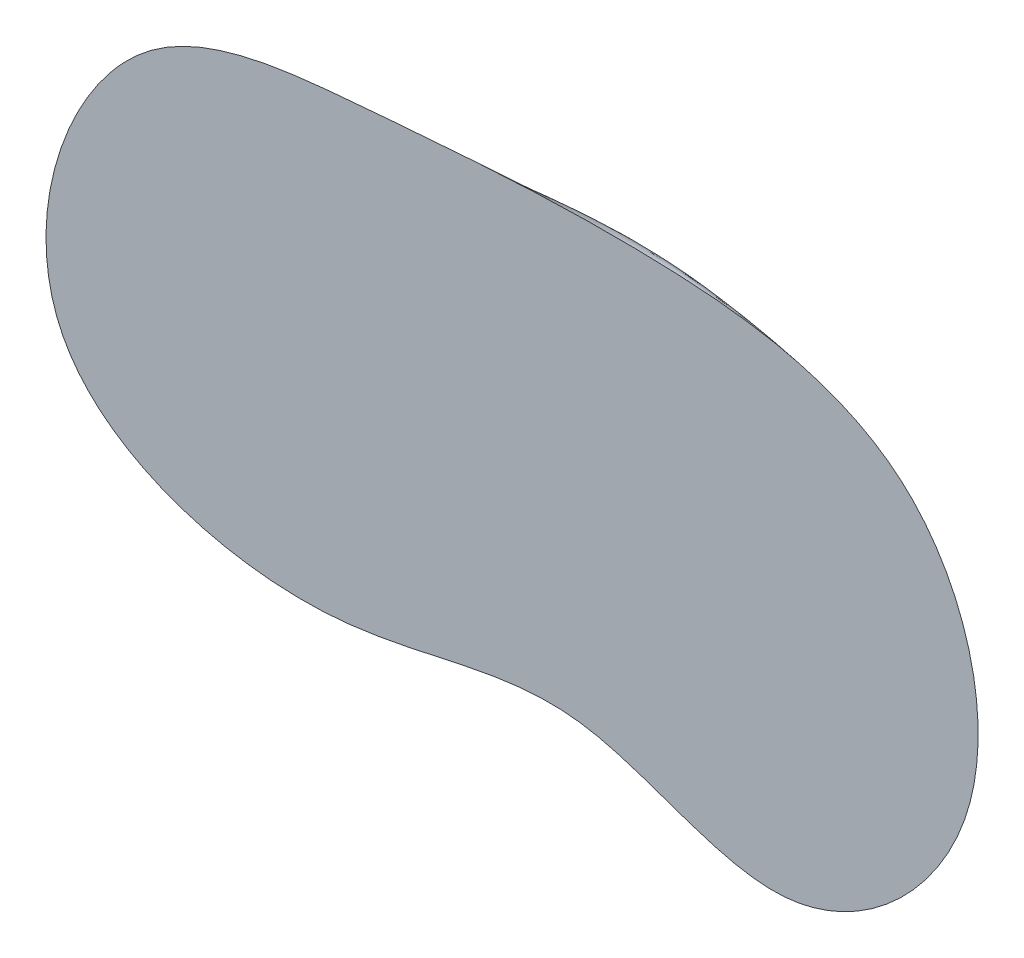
ISO-10303-21;
HEADER;
FILE_DESCRIPTION(('STEP AP214'),'2;1');
FILE_NAME('part.step','',(''),(''),'','','');
FILE_SCHEMA(('AUTOMOTIVE_DESIGN { 1 0 10303 214 1 1 1 1 }'));
ENDSEC;
DATA;
#1=APPLICATION_CONTEXT('core data for automotive mechanical design processes');
#2=APPLICATION_PROTOCOL_DEFINITION('international standard','automotive_design',2000,#1);
#3=PRODUCT_CONTEXT('',#1,'mechanical');
#4=PRODUCT('Part','Part','',(#3));
#5=PRODUCT_RELATED_PRODUCT_CATEGORY('part','',(#4));
#6=PRODUCT_DEFINITION_FORMATION('','',#4);
#7=PRODUCT_DEFINITION_CONTEXT('part definition',#1,'design');
#8=PRODUCT_DEFINITION('design','',#6,#7);
#9=PRODUCT_DEFINITION_SHAPE('','',#8);
#10=(LENGTH_UNIT() NAMED_UNIT(*) SI_UNIT(.MILLI.,.METRE.));
#11=(NAMED_UNIT(*) PLANE_ANGLE_UNIT() SI_UNIT($,.RADIAN.));
#12=(NAMED_UNIT(*) SI_UNIT($,.STERADIAN.) SOLID_ANGLE_UNIT());
#13=UNCERTAINTY_MEASURE_WITH_UNIT(LENGTH_MEASURE(1.E-05),#10,'distance_accuracy_value','');
#14=(GEOMETRIC_REPRESENTATION_CONTEXT(3) GLOBAL_UNCERTAINTY_ASSIGNED_CONTEXT((#13)) GLOBAL_UNIT_ASSIGNED_CONTEXT((#10,
#11,#12)) REPRESENTATION_CONTEXT('',''));
#15=CARTESIAN_POINT('',(0.,0.,0.));
#16=DIRECTION('',(0.,0.,1.));
#17=DIRECTION('',(1.,0.,0.));
#18=AXIS2_PLACEMENT_3D('',#15,#16,#17);
#19=CARTESIAN_POINT('',(293.614340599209,-321.933504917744,54.215128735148));
#20=DIRECTION('',(0.,0.,-1.));
#21=DIRECTION('',(-1.,0.,0.));
#22=AXIS2_PLACEMENT_3D('',#19,#20,#21);
#23=PLANE('',#22);
#24=CARTESIAN_POINT('',(-481.80360572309,197.636080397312,54.2151287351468));
#25=CARTESIAN_POINT('',(-478.678981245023,200.896863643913,54.2151287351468));
#26=CARTESIAN_POINT('',(-472.297876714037,207.288518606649,54.2151287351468));
#27=CARTESIAN_POINT('',(-462.328169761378,216.448030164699,54.2151287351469));
#28=CARTESIAN_POINT('',(-451.958550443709,225.138565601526,54.2151287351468));
#29=CARTESIAN_POINT('',(-441.187583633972,233.312122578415,54.215128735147));
#30=CARTESIAN_POINT('',(-430.045564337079,240.95552157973,54.2151287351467));
#31=CARTESIAN_POINT('',(-414.740675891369,250.438238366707,54.215128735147));
#32=CARTESIAN_POINT('',(-394.856575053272,260.965590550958,54.2151287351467));
#33=CARTESIAN_POINT('',(-370.072597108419,271.578973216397,54.2151287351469));
#34=CARTESIAN_POINT('',(-344.617534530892,280.352037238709,54.2151287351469));
#35=CARTESIAN_POINT('',(-318.696732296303,287.506415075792,54.2151287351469));
#36=CARTESIAN_POINT('',(-292.467332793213,293.281367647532,54.2151287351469));
#37=CARTESIAN_POINT('',(-266.043416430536,297.915868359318,54.2151287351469));
#38=CARTESIAN_POINT('',(-239.504714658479,301.640992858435,54.2151287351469));
#39=CARTESIAN_POINT('',(-212.905096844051,304.67636824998,54.2151287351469));
#40=CARTESIAN_POINT('',(-186.280302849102,307.233857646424,54.2151287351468));
#41=CARTESIAN_POINT('',(-164.091724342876,309.136917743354,54.2151287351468));
#42=CARTESIAN_POINT('',(-146.349200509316,310.629052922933,54.2151287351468));
#43=CARTESIAN_POINT('',(-128.613759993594,312.12220331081,54.2151287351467));
#44=CARTESIAN_POINT('',(-106.455899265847,313.972518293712,54.2151287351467));
#45=CARTESIAN_POINT('',(-79.8818575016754,316.146138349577,54.2151287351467));
#46=CARTESIAN_POINT('',(-53.3198581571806,318.244764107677,54.2151287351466));
#47=CARTESIAN_POINT('',(-26.7669929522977,320.24269658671,54.2151287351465));
#48=CARTESIAN_POINT('',(-0.220520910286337,322.112669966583,54.2151287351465));
#49=CARTESIAN_POINT('',(26.3217653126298,323.82884744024,54.2151287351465));
#50=CARTESIAN_POINT('',(52.861699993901,325.365171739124,54.2151287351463));
#51=CARTESIAN_POINT('',(79.4003168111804,326.698153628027,54.2151287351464));
#52=CARTESIAN_POINT('',(105.938356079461,327.803882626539,54.2151287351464));
#53=CARTESIAN_POINT('',(132.475413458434,328.662791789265,54.2151287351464));
#54=CARTESIAN_POINT('',(159.011084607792,329.255314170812,54.2151287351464));
#55=CARTESIAN_POINT('',(185.543576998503,329.564870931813,54.2151287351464));
#56=CARTESIAN_POINT('',(212.071625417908,329.579894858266,54.2151287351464));
#57=CARTESIAN_POINT('',(238.591907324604,329.283717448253,54.2151287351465));
#58=CARTESIAN_POINT('',(265.103514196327,328.68025492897,54.2151287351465));
#59=CARTESIAN_POINT('',(287.183198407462,327.85295493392,54.2151287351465));
#60=CARTESIAN_POINT('',(304.835557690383,326.947401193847,54.2151287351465));
#61=CARTESIAN_POINT('',(318.066715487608,326.133350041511,54.2151287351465));
#62=CARTESIAN_POINT('',(331.287343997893,325.171384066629,54.2151287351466));
#63=CARTESIAN_POINT('',(344.495025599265,324.048474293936,54.2151287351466));
#64=CARTESIAN_POINT('',(357.687342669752,322.751591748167,54.2151287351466));
#65=CARTESIAN_POINT('',(370.859789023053,321.265606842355,54.2151287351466));
#66=CARTESIAN_POINT('',(384.007858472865,319.575389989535,54.2151287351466));
#67=CARTESIAN_POINT('',(401.498690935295,317.028288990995,54.2151287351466));
#68=CARTESIAN_POINT('',(423.273448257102,313.254448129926,54.2151287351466));
#69=CARTESIAN_POINT('',(449.196009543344,307.638183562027,54.2151287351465));
#70=CARTESIAN_POINT('',(474.824586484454,300.778670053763,54.2151287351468));
#71=CARTESIAN_POINT('',(500.041907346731,292.50770558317,54.2151287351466));
#72=CARTESIAN_POINT('',(524.693256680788,282.650305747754,54.2151287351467));
#73=CARTESIAN_POINT('',(548.581080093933,271.036543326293,54.2151287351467));
#74=CARTESIAN_POINT('',(571.460061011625,257.517058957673,54.2151287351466));
#75=CARTESIAN_POINT('',(593.048537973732,241.993850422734,54.2151287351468));
#76=CARTESIAN_POINT('',(609.707270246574,227.363848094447,54.2151287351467));
#77=CARTESIAN_POINT('',(622.099877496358,214.689100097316,54.2151287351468));
#78=CARTESIAN_POINT('',(633.872898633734,201.431956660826,54.2151287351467));
#79=CARTESIAN_POINT('',(647.408242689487,183.851334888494,54.2151287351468));
#80=CARTESIAN_POINT('',(661.756392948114,161.410390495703,54.2151287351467));
#81=CARTESIAN_POINT('',(674.214636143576,137.852257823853,54.2151287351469));
#82=CARTESIAN_POINT('',(684.791984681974,113.37552471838,54.2151287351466));
#83=CARTESIAN_POINT('',(693.492361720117,88.1525303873,54.2151287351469));
#84=CARTESIAN_POINT('',(700.312257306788,62.3383395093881,54.2151287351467));
#85=CARTESIAN_POINT('',(704.416595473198,40.4532315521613,54.2151287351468));
#86=CARTESIAN_POINT('',(706.740798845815,22.7901144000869,54.2151287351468));
#87=CARTESIAN_POINT('',(708.419671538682,5.04666855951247,54.2151287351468));
#88=CARTESIAN_POINT('',(709.297356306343,-17.240082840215,54.2151287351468));
#89=CARTESIAN_POINT('',(708.35722738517,-44.0133908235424,54.2151287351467));
#90=CARTESIAN_POINT('',(705.374952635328,-70.6628122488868,54.2151287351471));
#91=CARTESIAN_POINT('',(701.155533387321,-92.6310302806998,54.2151287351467));
#92=CARTESIAN_POINT('',(696.714655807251,-109.970724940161,54.2151287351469));
#93=CARTESIAN_POINT('',(692.852903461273,-122.834988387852,54.215128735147));
#94=CARTESIAN_POINT('',(688.461633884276,-135.535676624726,54.2151287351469));
#95=CARTESIAN_POINT('',(683.562766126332,-148.057780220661,54.2151287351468));
#96=CARTESIAN_POINT('',(678.178219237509,-160.386289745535,54.2151287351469));
#97=CARTESIAN_POINT('',(672.323292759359,-172.507132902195,54.215128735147));
#98=CARTESIAN_POINT('',(666.013286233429,-184.406237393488,54.2151287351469));
#99=CARTESIAN_POINT('',(659.26223119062,-196.070238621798,54.2151287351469));
#100=CARTESIAN_POINT('',(652.084159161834,-207.485771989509,54.2151287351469));
#101=CARTESIAN_POINT('',(644.489508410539,-218.638601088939,54.215128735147));
#102=CARTESIAN_POINT('',(636.488717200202,-229.514489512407,54.215128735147));
#103=CARTESIAN_POINT('',(628.090353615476,-240.097439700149,54.2151287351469));
#104=CARTESIAN_POINT('',(619.302985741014,-250.371454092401,54.215128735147));
#105=CARTESIAN_POINT('',(610.133097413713,-260.317645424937,54.215128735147));
#106=CARTESIAN_POINT('',(600.587172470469,-269.917126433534,54.215128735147));
#107=CARTESIAN_POINT('',(593.976241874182,-276.070217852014,54.215128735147));
#108=CARTESIAN_POINT('',(587.466878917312,-281.89266794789,54.215128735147));
#109=CARTESIAN_POINT('',(581.074482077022,-287.40140730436,54.215128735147));
#110=CARTESIAN_POINT('',(571.171785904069,-295.299137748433,54.215128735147));
#111=CARTESIAN_POINT('',(560.95959776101,-302.808296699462,54.215128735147));
#112=CARTESIAN_POINT('',(550.443730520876,-309.900619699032,54.215128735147));
#113=CARTESIAN_POINT('',(539.629997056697,-316.547842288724,54.215128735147));
#114=CARTESIAN_POINT('',(528.527021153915,-322.715933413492,54.215128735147));
#115=CARTESIAN_POINT('',(517.143426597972,-328.370862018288,54.2151287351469));
#116=CARTESIAN_POINT('',(505.493412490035,-333.472641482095,54.2151287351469));
#117=CARTESIAN_POINT('',(493.591177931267,-337.981285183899,54.2151287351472));
#118=CARTESIAN_POINT('',(481.458451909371,-341.851639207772,54.2151287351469));
#119=CARTESIAN_POINT('',(469.119874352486,-345.040170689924,54.2151287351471));
#120=CARTESIAN_POINT('',(456.607404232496,-347.498005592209,54.2151287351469));
#121=CARTESIAN_POINT('',(443.959509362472,-349.185801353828,54.2151287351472));
#122=CARTESIAN_POINT('',(431.221144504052,-350.050299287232,54.2151287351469));
#123=CARTESIAN_POINT('',(418.447227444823,-350.100762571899,54.215128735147));
#124=CARTESIAN_POINT('',(405.685540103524,-349.415884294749,54.215128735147));
#125=CARTESIAN_POINT('',(392.971337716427,-348.06616198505,54.2151287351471));
#126=CARTESIAN_POINT('',(376.11093641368,-345.485337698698,54.2151287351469));
#127=CARTESIAN_POINT('',(355.245494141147,-340.987003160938,54.2151287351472));
#128=CARTESIAN_POINT('',(330.551533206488,-334.121223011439,54.215128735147));
#129=CARTESIAN_POINT('',(306.128672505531,-326.277902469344,54.2151287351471));
#130=CARTESIAN_POINT('',(281.867319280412,-317.885051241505,54.215128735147));
#131=CARTESIAN_POINT('',(257.63716782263,-309.335366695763,54.215128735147));
#132=CARTESIAN_POINT('',(233.305662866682,-301.011510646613,54.2151287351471));
#133=CARTESIAN_POINT('',(208.739932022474,-293.325682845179,54.2151287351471));
#134=CARTESIAN_POINT('',(183.834281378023,-286.735397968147,54.2151287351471));
#135=CARTESIAN_POINT('',(158.516727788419,-281.800925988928,54.2151287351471));
#136=CARTESIAN_POINT('',(137.119015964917,-279.581285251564,54.2151287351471));
#137=CARTESIAN_POINT('',(119.931878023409,-278.843203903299,54.2151287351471));
#138=CARTESIAN_POINT('',(107.025675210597,-278.775757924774,54.2151287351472));
#139=CARTESIAN_POINT('',(94.122257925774,-279.161726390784,54.2151287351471));
#140=CARTESIAN_POINT('',(81.2335671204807,-279.960620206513,54.2151287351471));
#141=CARTESIAN_POINT('',(68.3715437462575,-281.131950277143,54.2151287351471));
#142=CARTESIAN_POINT('',(51.2632779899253,-283.134812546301,54.2151287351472));
#143=CARTESIAN_POINT('',(29.9653975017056,-286.361382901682,54.2151287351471));
#144=CARTESIAN_POINT('',(4.53973717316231,-291.069071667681,54.2151287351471));
#145=CARTESIAN_POINT('',(-20.7894576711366,-296.304310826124,54.215128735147));
#146=CARTESIAN_POINT('',(-46.0744257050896,-301.796474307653,54.2151287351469));
#147=CARTESIAN_POINT('',(-71.3674056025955,-307.274936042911,54.215128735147));
#148=CARTESIAN_POINT('',(-96.7210451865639,-312.506328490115,54.2151287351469));
#149=CARTESIAN_POINT('',(-122.174337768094,-317.257183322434,54.2151287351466));
#150=CARTESIAN_POINT('',(-147.753061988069,-321.313109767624,54.215128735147));
#151=CARTESIAN_POINT('',(-173.461610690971,-324.474036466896,54.2151287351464));
#152=CARTESIAN_POINT('',(-194.98001015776,-326.205090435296,54.2151287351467));
#153=CARTESIAN_POINT('',(-212.229747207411,-326.97512921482,54.2151287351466));
#154=CARTESIAN_POINT('',(-225.176999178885,-327.252084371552,54.2151287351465));
#155=CARTESIAN_POINT('',(-238.126640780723,-327.235293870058,54.2151287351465));
#156=CARTESIAN_POINT('',(-251.072139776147,-326.926750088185,54.2151287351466));
#157=CARTESIAN_POINT('',(-264.006963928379,-326.328445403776,54.2151287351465));
#158=CARTESIAN_POINT('',(-281.230238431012,-325.144858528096,54.2151287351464));
#159=CARTESIAN_POINT('',(-302.699177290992,-322.942849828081,54.2151287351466));
#160=CARTESIAN_POINT('',(-328.310411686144,-319.129652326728,54.2151287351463));
#161=CARTESIAN_POINT('',(-353.706676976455,-314.108370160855,54.2151287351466));
#162=CARTESIAN_POINT('',(-378.817853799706,-307.835214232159,54.2151287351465));
#163=CARTESIAN_POINT('',(-403.547559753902,-300.232801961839,54.2151287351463));
#164=CARTESIAN_POINT('',(-427.799412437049,-291.223750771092,54.2151287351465));
#165=CARTESIAN_POINT('',(-451.412483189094,-280.694277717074,54.2151287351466));
#166=CARTESIAN_POINT('',(-474.225843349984,-268.530599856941,54.2151287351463));
#167=CARTESIAN_POINT('',(-492.360567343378,-256.919205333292,54.2151287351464));
#168=CARTESIAN_POINT('',(-506.197043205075,-246.683025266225,54.2151287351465));
#169=CARTESIAN_POINT('',(-516.190768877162,-238.51994962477,54.2151287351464));
#170=CARTESIAN_POINT('',(-525.752883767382,-229.858525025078,54.2151287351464));
#171=CARTESIAN_POINT('',(-534.827868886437,-220.695311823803,54.2151287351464));
#172=CARTESIAN_POINT('',(-543.360205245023,-211.026870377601,54.2151287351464));
#173=CARTESIAN_POINT('',(-551.28946879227,-200.86505727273,54.2151287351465));
#174=CARTESIAN_POINT('',(-558.555235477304,-190.221729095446,54.2151287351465));
#175=CARTESIAN_POINT('',(-565.103007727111,-179.128174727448,54.2151287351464));
#176=CARTESIAN_POINT('',(-570.87815670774,-167.617664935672,54.2151287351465));
#177=CARTESIAN_POINT('',(-575.849311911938,-155.743895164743,54.2151287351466));
#178=CARTESIAN_POINT('',(-580.043724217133,-143.580279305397,54.2151287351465));
#179=CARTESIAN_POINT('',(-583.488474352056,-131.189492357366,54.2151287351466));
#180=CARTESIAN_POINT('',(-586.21885205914,-118.628239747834,54.2151287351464));
#181=CARTESIAN_POINT('',(-588.27028154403,-105.944317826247,54.2151287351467));
#182=CARTESIAN_POINT('',(-589.679985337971,-93.1796486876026,54.2151287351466));
#183=CARTESIAN_POINT('',(-590.750452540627,-76.0975602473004,54.2151287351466));
#184=CARTESIAN_POINT('',(-590.658447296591,-54.7051141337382,54.2151287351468));
#185=CARTESIAN_POINT('',(-588.502348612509,-29.1539953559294,54.2151287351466));
#186=CARTESIAN_POINT('',(-584.500851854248,-3.85483728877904,54.2151287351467));
#187=CARTESIAN_POINT('',(-579.76152854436,16.9321655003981,54.2151287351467));
#188=CARTESIAN_POINT('',(-575.189649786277,33.3428655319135,54.2151287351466));
#189=CARTESIAN_POINT('',(-571.382065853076,45.5317113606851,54.2151287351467));
#190=CARTESIAN_POINT('',(-567.207342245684,57.59164989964,54.2151287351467));
#191=CARTESIAN_POINT('',(-562.674098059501,69.5137616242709,54.2151287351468));
#192=CARTESIAN_POINT('',(-557.790952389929,81.2891270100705,54.2151287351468));
#193=CARTESIAN_POINT('',(-550.820272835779,96.7796291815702,54.2151287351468));
#194=CARTESIAN_POINT('',(-541.257357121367,115.722178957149,54.2151287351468));
#195=CARTESIAN_POINT('',(-528.45223836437,137.699015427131,54.2151287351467));
#196=CARTESIAN_POINT('',(-514.31719598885,158.802660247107,54.2151287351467));
#197=CARTESIAN_POINT('',(-498.851926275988,178.914145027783,54.2151287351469));
#198=CARTESIAN_POINT('',(-487.638999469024,191.546403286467,54.2151287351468));
#199=CARTESIAN_POINT('',(-481.80360572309,197.636080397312,54.2151287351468));
#200=B_SPLINE_CURVE_WITH_KNOTS('',3,(#24,#25,#26,#27,#28,#29,#30,#31,#32,#33,#34,#35,#36,#37,
#38,#39,#40,#41,#42,#43,#44,#45,#46,#47,#48,#49,#50,#51,#52,#53,#54,#55,#56,#57,#58,#59,#60,#61,
#62,#63,#64,#65,#66,#67,#68,#69,#70,#71,#72,#73,#74,#75,#76,#77,#78,#79,#80,#81,#82,#83,#84,#85,
#86,#87,#88,#89,#90,#91,#92,#93,#94,#95,#96,#97,#98,#99,#100,#101,#102,#103,#104,#105,#106,#107,
#108,#109,#110,#111,#112,#113,#114,#115,#116,#117,#118,#119,#120,#121,#122,#123,#124,#125,#126,
#127,#128,#129,#130,#131,#132,#133,#134,#135,#136,#137,#138,#139,#140,#141,#142,#143,#144,#145,
#146,#147,#148,#149,#150,#151,#152,#153,#154,#155,#156,#157,#158,#159,#160,#161,#162,#163,#164,
#165,#166,#167,#168,#169,#170,#171,#172,#173,#174,#175,#176,#177,#178,#179,#180,#181,#182,#183,
#184,#185,#186,#187,#188,#189,#190,#191,#192,#193,#194,#195,#196,#197,#198,#199),.UNSPECIFIED.,
.T.,.F.,(4,1,1,1,1,1,1,1,1,1,1,1,1,1,1,1,1,1,1,1,1,1,1,1,1,1,1,1,1,1,1,1,1,1,1,1,1,1,1,1,1,1,1,
1,1,1,1,1,1,1,1,1,1,1,1,1,1,1,1,1,1,1,1,1,1,1,1,1,1,1,1,1,1,1,1,1,1,1,1,1,1,1,2,1,1,1,1,1,1,1,1,
1,1,1,1,1,1,1,1,1,1,1,1,1,1,1,1,1,1,1,1,1,1,1,1,1,1,1,1,1,1,1,1,1,1,1,1,1,1,1,1,1,1,1,1,1,1,1,1,
1,1,1,1,1,1,1,1,1,1,1,1,1,1,1,1,1,1,1,1,1,1,1,1,1,1,1,1,1,1,1,1,1,4),(0.,0.00404002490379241,
0.00808004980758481,0.0121200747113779,0.0161600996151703,0.0202001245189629,0.0242401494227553,
0.0323201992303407,0.0404002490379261,0.0484802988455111,0.0565603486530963,0.0646403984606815,
0.0727204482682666,0.0808004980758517,0.0888805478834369,0.0969605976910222,0.105040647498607,
0.1090806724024,0.113120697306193,0.121200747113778,0.129280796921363,0.137360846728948,
0.145440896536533,0.153520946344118,0.161600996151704,0.169681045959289,0.177761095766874,
0.185841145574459,0.193921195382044,0.202001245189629,0.210081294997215,0.2181613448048,
0.226241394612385,0.23432144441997,0.242401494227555,0.246441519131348,0.250481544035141,
0.254521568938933,0.258561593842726,0.262601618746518,0.266641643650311,0.270681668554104,
0.274721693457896,0.282801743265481,0.290881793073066,0.298961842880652,0.307041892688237,
0.315121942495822,0.323201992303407,0.331282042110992,0.339362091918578,0.347442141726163,
0.351482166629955,0.355522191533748,0.363602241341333,0.371682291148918,0.379762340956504,
0.387842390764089,0.395922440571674,0.404002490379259,0.412082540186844,0.416122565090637,
0.420162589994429,0.428242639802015,0.4363226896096,0.444402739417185,0.45248278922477,
0.456522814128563,0.460562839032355,0.464602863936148,0.46864288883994,0.472682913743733,
0.476722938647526,0.480762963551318,0.484802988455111,0.488843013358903,0.492883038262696,
0.496923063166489,0.500963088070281,0.505003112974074,0.509043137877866,0.513083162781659,
0.517123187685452,0.520895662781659,0.524668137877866,0.528440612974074,0.532213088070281,
0.535985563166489,0.539758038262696,0.543530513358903,0.547302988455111,0.551075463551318,
0.554847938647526,0.558620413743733,0.56239288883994,0.566165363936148,0.569937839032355,
0.573710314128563,0.57748278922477,0.581255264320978,0.585027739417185,0.5925726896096,
0.600117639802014,0.607662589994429,0.615207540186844,0.622752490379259,0.630297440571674,
0.637842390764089,0.645387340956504,0.652932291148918,0.660477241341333,0.664249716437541,
0.668022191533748,0.671794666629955,0.675567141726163,0.67933961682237,0.683112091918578,
0.690657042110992,0.698201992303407,0.705746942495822,0.713291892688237,0.720836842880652,
0.728381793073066,0.735926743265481,0.743471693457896,0.751016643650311,0.758561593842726,
0.762334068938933,0.766106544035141,0.769879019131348,0.773651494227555,0.777423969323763,
0.78119644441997,0.788741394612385,0.7962863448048,0.803831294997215,0.81137624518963,
0.818921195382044,0.826466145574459,0.834011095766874,0.841556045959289,0.849100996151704,
0.852873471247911,0.856645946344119,0.860418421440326,0.864190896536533,0.867963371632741,
0.871735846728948,0.875508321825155,0.879280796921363,0.88305327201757,0.886825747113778,
0.890598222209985,0.894370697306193,0.8981431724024,0.901915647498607,0.905688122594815,
0.909460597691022,0.917005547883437,0.924550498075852,0.932095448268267,0.939640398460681,
0.943412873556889,0.947185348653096,0.950957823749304,0.954730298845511,0.958502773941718,
0.962275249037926,0.969820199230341,0.977365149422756,0.98491009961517,0.992455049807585,1.),.UNSPECIFIED.);
#201=CARTESIAN_POINT('',(-481.80360572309,197.636080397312,54.2151287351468));
#202=VERTEX_POINT('',#201);
#203=EDGE_CURVE('E450',#202,#202,#200,.T.);
#204=ORIENTED_EDGE('',*,*,#203,.F.);
#205=EDGE_LOOP('',(#204));
#206=FACE_BOUND('',#205,.T.);
#207=ADVANCED_FACE('F424',(#206),#23,.F.);
#208=CARTESIAN_POINT('',(161.670086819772,149.170115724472,0.));
#209=DIRECTION('',(0.,0.,-1.));
#210=DIRECTION('',(-1.,0.,0.));
#211=AXIS2_PLACEMENT_3D('',#208,#209,#210);
#212=PLANE('',#211);
#213=CARTESIAN_POINT('',(134.167205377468,-148.866799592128,0.));
#214=CARTESIAN_POINT('',(134.432333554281,-148.711286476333,0.));
#215=CARTESIAN_POINT('',(134.695145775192,-148.551814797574,0.));
#216=CARTESIAN_POINT('',(135.215855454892,-148.22494652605,0.));
#217=CARTESIAN_POINT('',(135.473752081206,-148.057548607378,0.));
#218=CARTESIAN_POINT('',(135.984282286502,-147.714856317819,0.));
#219=CARTESIAN_POINT('',(136.236915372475,-147.539561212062,0.));
#220=CARTESIAN_POINT('',(136.736565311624,-147.181103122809,0.));
#221=CARTESIAN_POINT('',(136.983581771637,-146.997939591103,0.));
#222=CARTESIAN_POINT('',(137.471651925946,-146.623779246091,0.));
#223=CARTESIAN_POINT('',(137.712705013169,-146.432781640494,0.));
#224=CARTESIAN_POINT('',(138.188479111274,-146.042968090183,0.));
#225=CARTESIAN_POINT('',(138.423198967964,-145.84415073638,0.));
#226=CARTESIAN_POINT('',(138.886053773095,-145.438899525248,0.));
#227=CARTESIAN_POINT('',(139.114187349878,-145.232464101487,0.));
#228=CARTESIAN_POINT('',(139.563650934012,-144.812236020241,0.));
#229=CARTESIAN_POINT('',(139.784979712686,-144.598442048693,0.));
#230=CARTESIAN_POINT('',(140.220601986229,-144.163742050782,0.));
#231=CARTESIAN_POINT('',(140.434894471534,-143.942835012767,0.));
#232=CARTESIAN_POINT('',(140.856221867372,-143.494162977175,0.));
#233=CARTESIAN_POINT('',(141.063256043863,-143.266397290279,0.));
#234=CARTESIAN_POINT('',(141.469820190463,-142.804239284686,0.));
#235=CARTESIAN_POINT('',(141.669349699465,-142.56984656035,0.));
#236=CARTESIAN_POINT('',(142.0607891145,-142.094744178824,0.));
#237=CARTESIAN_POINT('',(142.25269819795,-141.854033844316,0.));
#238=CARTESIAN_POINT('',(142.62892046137,-141.36667441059,0.));
#239=CARTESIAN_POINT('',(142.813232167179,-141.120024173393,0.));
#240=CARTESIAN_POINT('',(143.174253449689,-140.621155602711,0.));
#241=CARTESIAN_POINT('',(143.35096139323,-140.368936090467,0.));
#242=CARTESIAN_POINT('',(143.869705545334,-139.604423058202,0.));
#243=CARTESIAN_POINT('',(144.200326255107,-139.08432158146,0.));
#244=CARTESIAN_POINT('',(144.831349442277,-138.026093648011,0.));
#245=CARTESIAN_POINT('',(145.131747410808,-137.487964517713,0.));
#246=CARTESIAN_POINT('',(145.70383049,-136.396409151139,0.));
#247=CARTESIAN_POINT('',(145.975503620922,-135.842976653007,0.));
#248=CARTESIAN_POINT('',(146.491575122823,-134.723420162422,0.));
#249=CARTESIAN_POINT('',(146.735966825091,-134.15729310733,0.));
#250=CARTESIAN_POINT('',(147.199207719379,-133.014579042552,0.));
#251=CARTESIAN_POINT('',(147.418051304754,-132.437989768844,0.));
#252=CARTESIAN_POINT('',(147.832230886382,-131.276221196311,0.));
#253=CARTESIAN_POINT('',(148.027557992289,-130.691038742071,0.));
#254=CARTESIAN_POINT('',(148.396751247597,-129.513851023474,0.));
#255=CARTESIAN_POINT('',(148.570613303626,-128.921844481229,0.));
#256=CARTESIAN_POINT('',(148.898846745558,-127.732288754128,0.));
#257=CARTESIAN_POINT('',(149.053212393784,-127.134737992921,0.));
#258=CARTESIAN_POINT('',(149.344477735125,-125.935235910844,0.));
#259=CARTESIAN_POINT('',(149.481372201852,-125.33328332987,0.));
#260=CARTESIAN_POINT('',(149.868810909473,-123.522064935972,0.));
#261=CARTESIAN_POINT('',(150.096016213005,-122.307789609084,0.));
#262=CARTESIAN_POINT('',(150.502452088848,-119.870830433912,0.));
#263=CARTESIAN_POINT('',(150.681656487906,-118.6481423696,0.));
#264=CARTESIAN_POINT('',(151.005197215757,-116.197596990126,0.));
#265=CARTESIAN_POINT('',(151.149514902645,-114.969737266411,0.));
#266=CARTESIAN_POINT('',(151.414978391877,-112.510964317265,0.));
#267=CARTESIAN_POINT('',(151.536112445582,-111.280049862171,0.));
#268=CARTESIAN_POINT('',(151.76609208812,-108.816501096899,0.));
#269=CARTESIAN_POINT('',(151.874931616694,-107.583866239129,0.));
#270=CARTESIAN_POINT('',(152.092619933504,-105.117993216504,0.));
#271=CARTESIAN_POINT('',(152.201468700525,-103.884755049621,0.));
#272=CARTESIAN_POINT('',(152.37160300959,-102.035302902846,0.));
#273=CARTESIAN_POINT('',(152.429468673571,-101.418778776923,0.));
#274=CARTESIAN_POINT('',(152.548464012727,-100.185896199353,0.));
#275=CARTESIAN_POINT('',(152.609594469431,-99.5695378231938,0.));
#276=CARTESIAN_POINT('',(152.797472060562,-97.7204787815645,0.));
#277=CARTESIAN_POINT('',(152.928665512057,-96.4882283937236,0.));
#278=CARTESIAN_POINT('',(153.201968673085,-94.0243720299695,0.));
#279=CARTESIAN_POINT('',(153.344083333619,-92.7927666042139,0.));
#280=CARTESIAN_POINT('',(153.639872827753,-90.3303691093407,0.));
#281=CARTESIAN_POINT('',(153.793552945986,-89.0995776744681,0.));
#282=CARTESIAN_POINT('',(154.111889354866,-86.6388551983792,0.));
#283=CARTESIAN_POINT('',(154.276550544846,-85.4089247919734,0.));
#284=CARTESIAN_POINT('',(154.616553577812,-82.9499876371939,0.));
#285=CARTESIAN_POINT('',(154.791900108,-81.7209815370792,0.));
#286=CARTESIAN_POINT('',(155.153049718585,-79.2639562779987,0.));
#287=CARTESIAN_POINT('',(155.338857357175,-78.0359377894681,0.));
#288=CARTESIAN_POINT('',(155.720481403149,-75.5809191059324,0.));
#289=CARTESIAN_POINT('',(155.916302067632,-74.3539195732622,0.));
#290=CARTESIAN_POINT('',(156.317463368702,-71.9009429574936,0.));
#291=CARTESIAN_POINT('',(156.522808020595,-70.6749665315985,0.));
#292=CARTESIAN_POINT('',(156.94253395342,-68.2240359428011,0.));
#293=CARTESIAN_POINT('',(157.156918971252,-66.9990824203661,0.));
#294=CARTESIAN_POINT('',(157.594181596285,-64.5501747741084,0.));
#295=CARTESIAN_POINT('',(157.817062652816,-63.3262212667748,0.));
#296=CARTESIAN_POINT('',(158.270656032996,-60.879252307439,0.));
#297=CARTESIAN_POINT('',(158.501371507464,-59.6562374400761,0.));
#298=CARTESIAN_POINT('',(158.970007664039,-57.2110873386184,0.));
#299=CARTESIAN_POINT('',(159.207931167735,-55.9889526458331,0.));
#300=CARTESIAN_POINT('',(159.690260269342,-53.5454663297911,0.));
#301=CARTESIAN_POINT('',(159.934668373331,-52.3241152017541,0.));
#302=CARTESIAN_POINT('',(160.429220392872,-49.8820845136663,0.));
#303=CARTESIAN_POINT('',(160.679366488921,-48.6614053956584,0.));
#304=CARTESIAN_POINT('',(161.184647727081,-46.2206010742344,0.));
#305=CARTESIAN_POINT('',(161.439784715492,-45.0004762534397,0.));
#306=CARTESIAN_POINT('',(161.954230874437,-42.5606315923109,0.));
#307=CARTESIAN_POINT('',(162.213541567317,-41.3409120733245,0.));
#308=CARTESIAN_POINT('',(162.735527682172,-38.9017277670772,0.));
#309=CARTESIAN_POINT('',(162.998204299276,-37.6822632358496,0.));
#310=CARTESIAN_POINT('',(163.52610335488,-35.2434285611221,0.));
#311=CARTESIAN_POINT('',(163.791326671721,-34.0240586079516,0.));
#312=CARTESIAN_POINT('',(164.323491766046,-31.5852432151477,0.));
#313=CARTESIAN_POINT('',(164.590434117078,-30.3657979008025,0.));
#314=CARTESIAN_POINT('',(165.125209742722,-27.9266611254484,0.));
#315=CARTESIAN_POINT('',(165.393043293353,-26.7069697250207,0.));
#316=CARTESIAN_POINT('',(165.928802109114,-24.2671739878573,0.));
#317=CARTESIAN_POINT('',(166.196727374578,-23.0470696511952,0.));
#318=CARTESIAN_POINT('',(166.731869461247,-20.6062802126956,0.));
#319=CARTESIAN_POINT('',(166.999086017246,-19.3855950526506,0.));
#320=CARTESIAN_POINT('',(167.532027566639,-16.9434821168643,0.));
#321=CARTESIAN_POINT('',(167.797752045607,-15.7220542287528,0.));
#322=CARTESIAN_POINT('',(168.326993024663,-13.2783128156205,0.));
#323=CARTESIAN_POINT('',(168.590508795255,-12.0559991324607,0.));
#324=CARTESIAN_POINT('',(169.114592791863,-9.61033923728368,0.));
#325=CARTESIAN_POINT('',(169.375160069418,-8.38699282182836,0.));
#326=CARTESIAN_POINT('',(169.892685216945,-5.93914575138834,0.));
#327=CARTESIAN_POINT('',(170.149641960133,-4.71464485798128,0.));
#328=CARTESIAN_POINT('',(170.659326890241,-2.2643821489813,0.));
#329=CARTESIAN_POINT('',(170.912053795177,-1.03862006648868,0.));
#330=CARTESIAN_POINT('',(171.412648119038,1.41427086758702,0.));
#331=CARTESIAN_POINT('',(171.660514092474,2.64140001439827,0.));
#332=CARTESIAN_POINT('',(172.150879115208,5.09709366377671,0.));
#333=CARTESIAN_POINT('',(172.393376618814,6.32565847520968,0.));
#334=CARTESIAN_POINT('',(172.87248349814,8.78429172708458,0.));
#335=CARTESIAN_POINT('',(173.109091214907,10.0143604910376,0.));
#336=CARTESIAN_POINT('',(173.575948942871,12.4760520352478,0.));
#337=CARTESIAN_POINT('',(173.806197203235,13.7076751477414,0.));
#338=CARTESIAN_POINT('',(174.259961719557,16.1724972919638,0.));
#339=CARTESIAN_POINT('',(174.4834761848,17.4056966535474,0.));
#340=CARTESIAN_POINT('',(174.923367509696,19.8736971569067,0.));
#341=CARTESIAN_POINT('',(175.139742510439,21.1084986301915,0.));
#342=CARTESIAN_POINT('',(175.565054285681,23.5797017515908,0.));
#343=CARTESIAN_POINT('',(175.773989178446,24.8161037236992,0.));
#344=CARTESIAN_POINT('',(176.184154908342,27.2904959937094,0.));
#345=CARTESIAN_POINT('',(176.38538384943,28.5284866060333,0.));
#346=CARTESIAN_POINT('',(176.779843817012,31.0060449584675,0.));
#347=CARTESIAN_POINT('',(176.973072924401,32.2456130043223,0.));
#348=CARTESIAN_POINT('',(177.351070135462,34.7263297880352,0.));
#349=CARTESIAN_POINT('',(177.535836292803,35.9674788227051,0.));
#350=CARTESIAN_POINT('',(177.896468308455,38.4513545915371,0.));
#351=CARTESIAN_POINT('',(178.072332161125,39.6940816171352,0.));
#352=CARTESIAN_POINT('',(178.414662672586,42.1811054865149,0.));
#353=CARTESIAN_POINT('',(178.581127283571,43.4254026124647,0.));
#354=CARTESIAN_POINT('',(178.904105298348,45.9155529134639,0.));
#355=CARTESIAN_POINT('',(179.060616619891,47.1614063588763,0.));
#356=CARTESIAN_POINT('',(179.363155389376,49.6546477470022,0.));
#357=CARTESIAN_POINT('',(179.509180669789,50.9020359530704,0.));
#358=CARTESIAN_POINT('',(179.790084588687,53.3983138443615,0.));
#359=CARTESIAN_POINT('',(179.924961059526,54.6472037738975,0.));
#360=CARTESIAN_POINT('',(180.182900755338,57.1464421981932,0.));
#361=CARTESIAN_POINT('',(180.30596175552,58.3967909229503,0.));
#362=CARTESIAN_POINT('',(180.539559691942,60.8988917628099,0.));
#363=CARTESIAN_POINT('',(180.650094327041,62.1506440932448,0.));
#364=CARTESIAN_POINT('',(180.85775357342,64.6554791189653,0.));
#365=CARTESIAN_POINT('',(180.954875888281,65.9085620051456,0.));
#366=CARTESIAN_POINT('',(181.134882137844,68.4159727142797,0.));
#367=CARTESIAN_POINT('',(181.217763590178,69.6703007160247,0.));
#368=CARTESIAN_POINT('',(181.368255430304,72.1800788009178,0.));
#369=CARTESIAN_POINT('',(181.43586336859,73.4355290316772,0.));
#370=CARTESIAN_POINT('',(181.554660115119,75.9473964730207,0.));
#371=CARTESIAN_POINT('',(181.605846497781,77.2038137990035,0.));
#372=CARTESIAN_POINT('',(181.690682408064,79.7174375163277,0.));
#373=CARTESIAN_POINT('',(181.724329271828,80.9746439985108,0.));
#374=CARTESIAN_POINT('',(181.772548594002,83.4895933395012,0.));
#375=CARTESIAN_POINT('',(181.787118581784,84.7473362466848,0.));
#376=CARTESIAN_POINT('',(181.795704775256,87.2630790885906,0.));
#377=CARTESIAN_POINT('',(181.789718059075,88.5210790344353,0.));
#378=CARTESIAN_POINT('',(181.755468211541,91.0369567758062,0.));
#379=CARTESIAN_POINT('',(181.727202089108,92.2948345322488,0.));
#380=CARTESIAN_POINT('',(181.646194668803,94.8099346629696,0.));
#381=CARTESIAN_POINT('',(181.59345104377,96.0671569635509,0.));
#382=CARTESIAN_POINT('',(181.461494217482,98.5803838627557,0.));
#383=CARTESIAN_POINT('',(181.382277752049,99.8363882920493,0.));
#384=CARTESIAN_POINT('',(181.194521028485,102.346327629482,0.));
#385=CARTESIAN_POINT('',(181.085978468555,103.600262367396,0.));
#386=CARTESIAN_POINT('',(180.836507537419,106.105059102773,0.));
#387=CARTESIAN_POINT('',(180.695575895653,107.355920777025,0.));
#388=CARTESIAN_POINT('',(180.378207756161,109.853360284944,0.));
#389=CARTESIAN_POINT('',(180.201766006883,111.099937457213,0.));
#390=CARTESIAN_POINT('',(179.808766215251,113.586798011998,0.));
#391=CARTESIAN_POINT('',(179.592208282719,114.827081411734,0.));
#392=CARTESIAN_POINT('',(179.114820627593,117.299288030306,0.));
#393=CARTESIAN_POINT('',(178.853986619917,118.531210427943,0.));
#394=CARTESIAN_POINT('',(178.282561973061,120.98355769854,0.));
#395=CARTESIAN_POINT('',(177.971970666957,122.203982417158,0.));
#396=CARTESIAN_POINT('',(177.294107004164,124.629155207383,0.));
#397=CARTESIAN_POINT('',(176.926836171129,125.833903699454,0.));
#398=CARTESIAN_POINT('',(176.328864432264,127.625472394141,0.));
#399=CARTESIAN_POINT('',(176.121648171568,128.220191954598,0.));
#400=CARTESIAN_POINT('',(175.690457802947,129.403614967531,0.));
#401=CARTESIAN_POINT('',(175.466482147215,129.992317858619,0.));
#402=CARTESIAN_POINT('',(175.000677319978,131.162503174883,0.));
#403=CARTESIAN_POINT('',(174.758851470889,131.743986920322,0.));
#404=CARTESIAN_POINT('',(174.25628326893,132.898561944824,0.));
#405=CARTESIAN_POINT('',(173.995545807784,133.471655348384,0.));
#406=CARTESIAN_POINT('',(173.45407667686,134.608264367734,0.));
#407=CARTESIAN_POINT('',(173.173347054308,135.171780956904,0.));
#408=CARTESIAN_POINT('',(172.590872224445,136.28806239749,0.));
#409=CARTESIAN_POINT('',(172.289121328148,136.840824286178,0.));
#410=CARTESIAN_POINT('',(171.663595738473,137.933968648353,0.));
#411=CARTESIAN_POINT('',(171.339815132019,138.474347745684,0.));
#412=CARTESIAN_POINT('',(170.669219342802,139.540625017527,0.));
#413=CARTESIAN_POINT('',(170.32240505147,140.066523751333,0.));
#414=CARTESIAN_POINT('',(169.604791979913,141.101679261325,0.));
#415=CARTESIAN_POINT('',(169.233994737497,141.610937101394,0.));
#416=CARTESIAN_POINT('',(168.467925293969,142.610587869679,0.));
#417=CARTESIAN_POINT('',(168.072657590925,143.100984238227,0.));
#418=CARTESIAN_POINT('',(167.257130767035,144.060520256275,0.));
#419=CARTESIAN_POINT('',(166.836873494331,144.529661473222,0.));
#420=CARTESIAN_POINT('',(165.971447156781,145.444556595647,0.));
#421=CARTESIAN_POINT('',(165.52627315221,145.890305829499,0.));
#422=CARTESIAN_POINT('',(164.612766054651,146.757485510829,0.));
#423=CARTESIAN_POINT('',(164.144430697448,147.178913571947,0.));
#424=CARTESIAN_POINT('',(163.186035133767,147.996194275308,0.));
#425=CARTESIAN_POINT('',(162.695977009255,148.392049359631,0.));
#426=CARTESIAN_POINT('',(161.69602472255,149.157790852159,0.));
#427=CARTESIAN_POINT('',(161.186131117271,149.527677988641,0.));
#428=CARTESIAN_POINT('',(160.148554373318,150.241609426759,0.));
#429=CARTESIAN_POINT('',(159.620870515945,150.585652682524,0.));
#430=CARTESIAN_POINT('',(158.5496164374,151.24795741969,0.));
#431=CARTESIAN_POINT('',(158.006046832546,151.566219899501,0.));
#432=CARTESIAN_POINT('',(156.904944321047,152.177656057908,0.));
#433=CARTESIAN_POINT('',(156.347410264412,152.470827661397,0.));
#434=CARTESIAN_POINT('',(155.220206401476,153.032793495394,0.));
#435=CARTESIAN_POINT('',(154.6505364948,153.301587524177,0.));
#436=CARTESIAN_POINT('',(153.500752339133,153.815693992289,0.));
#437=CARTESIAN_POINT('',(152.920638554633,154.061007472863,0.));
#438=CARTESIAN_POINT('',(151.751482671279,154.529368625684,0.));
#439=CARTESIAN_POINT('',(151.162440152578,154.752415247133,0.));
#440=CARTESIAN_POINT('',(149.976880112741,155.177458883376,0.));
#441=CARTESIAN_POINT('',(149.380363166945,155.379457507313,0.));
#442=CARTESIAN_POINT('',(148.180981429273,155.763575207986,0.));
#443=CARTESIAN_POINT('',(147.578116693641,155.945694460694,0.));
#444=CARTESIAN_POINT('',(146.367037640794,156.291237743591,0.));
#445=CARTESIAN_POINT('',(145.758822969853,156.454660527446,0.));
#446=CARTESIAN_POINT('',(143.927544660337,156.918636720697,0.));
#447=CARTESIAN_POINT('',(142.697772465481,157.192921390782,0.));
#448=CARTESIAN_POINT('',(140.22676385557,157.681267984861,0.));
#449=CARTESIAN_POINT('',(138.985529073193,157.895338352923,0.));
#450=CARTESIAN_POINT('',(136.495189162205,158.270965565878,0.));
#451=CARTESIAN_POINT('',(135.246083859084,158.432521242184,0.));
#452=CARTESIAN_POINT('',(132.742831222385,158.710279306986,0.));
#453=CARTESIAN_POINT('',(131.488683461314,158.826477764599,0.));
#454=CARTESIAN_POINT('',(128.977707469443,159.02059091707,0.));
#455=CARTESIAN_POINT('',(127.720879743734,159.098512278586,0.));
#456=CARTESIAN_POINT('',(125.205672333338,159.220800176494,0.));
#457=CARTESIAN_POINT('',(123.947292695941,159.265167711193,0.));
#458=CARTESIAN_POINT('',(121.429949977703,159.325491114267,0.));
#459=CARTESIAN_POINT('',(120.170986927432,159.341448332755,0.));
#460=CARTESIAN_POINT('',(117.653112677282,159.349146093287,0.));
#461=CARTESIAN_POINT('',(116.394201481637,159.340888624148,0.));
#462=CARTESIAN_POINT('',(113.8767737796,159.303468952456,0.));
#463=CARTESIAN_POINT('',(112.618257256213,159.274307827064,0.));
#464=CARTESIAN_POINT('',(110.101906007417,159.198649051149,0.));
#465=CARTESIAN_POINT('',(108.844071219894,159.152153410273,0.));
#466=CARTESIAN_POINT('',(106.329170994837,159.044425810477,0.));
#467=CARTESIAN_POINT('',(105.072105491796,158.983195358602,0.));
#468=CARTESIAN_POINT('',(102.558755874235,158.848536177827,0.));
#469=CARTESIAN_POINT('',(101.302471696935,158.775108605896,0.));
#470=CARTESIAN_POINT('',(98.7906619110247,158.618468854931,0.));
#471=CARTESIAN_POINT('',(97.5351362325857,158.535257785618,0.));
#472=CARTESIAN_POINT('',(95.0247764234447,158.360952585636,0.));
#473=CARTESIAN_POINT('',(93.7699422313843,158.269859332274,0.));
#474=CARTESIAN_POINT('',(91.2608795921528,158.081805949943,0.));
#475=CARTESIAN_POINT('',(90.0066510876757,157.984846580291,0.));
#476=CARTESIAN_POINT('',(87.4986959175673,157.786805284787,0.));
#477=CARTESIAN_POINT('',(86.2449692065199,157.685723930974,0.));
#478=CARTESIAN_POINT('',(83.7378979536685,157.481042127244,0.));
#479=CARTESIAN_POINT('',(82.4845533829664,157.37744202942,0.));
#480=CARTESIAN_POINT('',(79.9781227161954,157.169358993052,0.));
#481=CARTESIAN_POINT('',(78.7250366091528,157.064876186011,0.));
#482=CARTESIAN_POINT('',(76.2190139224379,156.856451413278,0.));
#483=CARTESIAN_POINT('',(74.9660773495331,156.752509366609,0.));
#484=CARTESIAN_POINT('',(72.4602436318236,156.546598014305,0.));
#485=CARTESIAN_POINT('',(71.2073465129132,156.444628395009,0.));
#486=CARTESIAN_POINT('',(68.7014933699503,156.244068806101,0.));
#487=CARTESIAN_POINT('',(67.4485373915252,156.145478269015,0.));
#488=CARTESIAN_POINT('',(64.9424852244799,155.953038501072,0.));
#489=CARTESIAN_POINT('',(63.6893891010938,155.859188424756,0.));
#490=CARTESIAN_POINT('',(61.182978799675,155.677606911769,0.));
#491=CARTESIAN_POINT('',(59.9296647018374,155.589874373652,0.));
#492=CARTESIAN_POINT('',(57.4227761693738,155.421851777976,0.));
#493=CARTESIAN_POINT('',(56.1692018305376,155.341560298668,0.));
#494=CARTESIAN_POINT('',(53.6617680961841,155.189724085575,0.));
#495=CARTESIAN_POINT('',(52.4079088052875,155.118177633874,0.));
#496=CARTESIAN_POINT('',(49.899900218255,154.985158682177,0.));
#497=CARTESIAN_POINT('',(48.6457510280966,154.923684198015,0.));
#498=CARTESIAN_POINT('',(46.137209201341,154.812278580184,0.));
#499=CARTESIAN_POINT('',(44.8828166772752,154.76234493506,0.));
#500=CARTESIAN_POINT('',(42.3738480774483,154.675487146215,0.));
#501=CARTESIAN_POINT('',(41.1192721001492,154.638560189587,0.));
#502=CARTESIAN_POINT('',(38.610054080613,154.579151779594,0.));
#503=CARTESIAN_POINT('',(37.3554121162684,154.556667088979,0.));
#504=CARTESIAN_POINT('',(34.8462374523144,154.527558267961,0.));
#505=CARTESIAN_POINT('',(33.5917047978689,154.52093036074,0.));
#506=CARTESIAN_POINT('',(31.0829445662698,154.524922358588,0.));
#507=CARTESIAN_POINT('',(29.8287169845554,154.535538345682,0.));
#508=CARTESIAN_POINT('',(27.3208796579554,154.575829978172,0.));
#509=CARTESIAN_POINT('',(26.0672698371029,154.605500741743,0.));
#510=CARTESIAN_POINT('',(23.561026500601,154.685796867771,0.));
#511=CARTESIAN_POINT('',(22.3083928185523,154.736416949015,0.));
#512=CARTESIAN_POINT('',(19.804543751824,154.860373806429,0.));
#513=CARTESIAN_POINT('',(18.5533280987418,154.933705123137,0.));
#514=CARTESIAN_POINT('',(16.0528775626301,155.104226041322,0.));
#515=CARTESIAN_POINT('',(14.803642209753,155.201408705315,0.));
#516=CARTESIAN_POINT('',(12.3077872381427,155.421344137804,0.));
#517=CARTESIAN_POINT('',(11.0611669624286,155.544089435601,0.));
#518=CARTESIAN_POINT('',(8.5709015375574,155.81406153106,0.));
#519=CARTESIAN_POINT('',(7.32725573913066,155.96128237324,0.));
#520=CARTESIAN_POINT('',(4.84308197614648,156.2775256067,0.));
#521=CARTESIAN_POINT('',(3.60255328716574,156.446542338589,0.));
#522=CARTESIAN_POINT('',(1.12473795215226,156.804087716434,0.));
#523=CARTESIAN_POINT('',(-0.112549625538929,156.992609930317,0.));
#524=CARTESIAN_POINT('',(-2.58393481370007,157.387181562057,0.));
#525=CARTESIAN_POINT('',(-3.81803327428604,157.593225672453,0.));
#526=CARTESIAN_POINT('',(-6.28313715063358,158.020927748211,0.));
#527=CARTESIAN_POINT('',(-7.51414337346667,158.242581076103,0.));
#528=CARTESIAN_POINT('',(-9.97324584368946,158.699431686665,0.));
#529=CARTESIAN_POINT('',(-11.2013428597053,158.934624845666,0.));
#530=CARTESIAN_POINT('',(-13.6549431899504,159.416219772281,0.));
#531=CARTESIAN_POINT('',(-14.8804471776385,159.662618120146,0.));
#532=CARTESIAN_POINT('',(-17.3291850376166,160.164345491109,0.));
#533=CARTESIAN_POINT('',(-18.552419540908,160.419671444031,0.));
#534=CARTESIAN_POINT('',(-20.9970433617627,160.936963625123,0.));
#535=CARTESIAN_POINT('',(-22.2184331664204,161.198927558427,0.));
#536=CARTESIAN_POINT('',(-24.6598397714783,161.727224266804,0.));
#537=CARTESIAN_POINT('',(-25.8798568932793,161.993555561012,0.));
#538=CARTESIAN_POINT('',(-28.3190028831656,162.528276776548,0.));
#539=CARTESIAN_POINT('',(-29.5381319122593,162.796665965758,0.));
#540=CARTESIAN_POINT('',(-31.976076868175,163.332831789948,0.));
#541=CARTESIAN_POINT('',(-33.1948927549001,163.60060860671,0.));
#542=CARTESIAN_POINT('',(-35.6327708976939,164.132952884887,0.));
#543=CARTESIAN_POINT('',(-36.8518329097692,164.397521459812,0.));
#544=CARTESIAN_POINT('',(-39.2907802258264,164.920623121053,0.));
#545=CARTESIAN_POINT('',(-40.5106650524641,165.179158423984,0.));
#546=CARTESIAN_POINT('',(-42.9518524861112,165.687127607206,0.));
#547=CARTESIAN_POINT('',(-44.1731543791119,165.936564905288,0.));
#548=CARTESIAN_POINT('',(-46.617717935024,166.423369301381,0.));
#549=CARTESIAN_POINT('',(-47.8409787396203,166.660740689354,0.));
#550=CARTESIAN_POINT('',(-50.2899525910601,167.119740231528,0.));
#551=CARTESIAN_POINT('',(-51.5156644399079,167.341374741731,0.));
#552=CARTESIAN_POINT('',(-53.9699682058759,167.765185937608,0.));
#553=CARTESIAN_POINT('',(-55.1985587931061,167.96737027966,0.));
#554=CARTESIAN_POINT('',(-57.6589035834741,168.348360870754,0.));
#555=CARTESIAN_POINT('',(-58.8906563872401,168.527176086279,0.));
#556=CARTESIAN_POINT('',(-61.3573727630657,168.856708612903,0.));
#557=CARTESIAN_POINT('',(-62.5923345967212,169.007438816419,0.));
#558=CARTESIAN_POINT('',(-65.0654001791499,169.276299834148,0.));
#559=CARTESIAN_POINT('',(-66.3035026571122,169.394442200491,0.));
#560=CARTESIAN_POINT('',(-68.782239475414,169.592843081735,0.));
#561=CARTESIAN_POINT('',(-70.0228724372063,169.673118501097,0.));
#562=CARTESIAN_POINT('',(-72.5056378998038,169.790032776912,0.));
#563=CARTESIAN_POINT('',(-73.7477693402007,169.826693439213,0.));
#564=CARTESIAN_POINT('',(-76.2321762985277,169.850740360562,0.));
#565=CARTESIAN_POINT('',(-77.4744516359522,169.838142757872,0.));
#566=CARTESIAN_POINT('',(-79.9566034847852,169.757786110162,0.));
#567=CARTESIAN_POINT('',(-81.1964809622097,169.690058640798,0.));
#568=CARTESIAN_POINT('',(-83.6709141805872,169.49341712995,0.));
#569=CARTESIAN_POINT('',(-84.9054719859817,169.364529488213,0.));
#570=CARTESIAN_POINT('',(-87.3655636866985,169.040238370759,0.));
#571=CARTESIAN_POINT('',(-88.5911006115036,168.844858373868,0.));
#572=CARTESIAN_POINT('',(-90.4189276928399,168.498688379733,0.));
#573=CARTESIAN_POINT('',(-91.0263397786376,168.374477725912,0.));
#574=CARTESIAN_POINT('',(-92.2369817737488,168.107822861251,0.));
#575=CARTESIAN_POINT('',(-92.8402128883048,167.965384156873,0.));
#576=CARTESIAN_POINT('',(-94.041811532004,167.661683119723,0.));
#577=CARTESIAN_POINT('',(-94.6401798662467,167.500423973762,0.));
#578=CARTESIAN_POINT('',(-95.8313755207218,167.158839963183,0.));
#579=CARTESIAN_POINT('',(-96.4242034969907,166.978517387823,0.));
#580=CARTESIAN_POINT('',(-97.6036252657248,166.598912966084,0.));
#581=CARTESIAN_POINT('',(-98.1902203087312,166.399635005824,0.));
#582=CARTESIAN_POINT('',(-99.3564611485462,165.982155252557,0.));
#583=CARTESIAN_POINT('',(-99.9361087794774,165.763958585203,0.));
#584=CARTESIAN_POINT('',(-101.08774768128,165.308704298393,0.));
#585=CARTESIAN_POINT('',(-101.659741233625,165.071652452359,0.));
#586=CARTESIAN_POINT('',(-102.795350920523,164.578715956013,0.));
#587=CARTESIAN_POINT('',(-103.358969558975,164.322837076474,0.));
#588=CARTESIAN_POINT('',(-104.47716308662,163.792395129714,0.));
#589=CARTESIAN_POINT('',(-105.031740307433,163.517836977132,0.));
#590=CARTESIAN_POINT('',(-106.131380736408,162.950564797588,0.));
#591=CARTESIAN_POINT('',(-106.676445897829,162.657854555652,0.));
#592=CARTESIAN_POINT('',(-107.756570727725,162.054750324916,0.));
#593=CARTESIAN_POINT('',(-108.29163220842,161.744359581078,0.));
#594=CARTESIAN_POINT('',(-109.351264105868,161.106380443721,0.));
#595=CARTESIAN_POINT('',(-109.875836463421,160.778795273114,0.));
#596=CARTESIAN_POINT('',(-110.914002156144,160.106909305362,0.));
#597=CARTESIAN_POINT('',(-111.427597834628,159.762612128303,0.));
#598=CARTESIAN_POINT('',(-112.443325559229,159.057782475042,0.));
#599=CARTESIAN_POINT('',(-112.945460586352,158.697254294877,0.));
#600=CARTESIAN_POINT('',(-113.937637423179,157.960226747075,0.));
#601=CARTESIAN_POINT('',(-114.427682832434,157.583732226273,0.));
#602=CARTESIAN_POINT('',(-115.395049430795,156.815037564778,0.));
#603=CARTESIAN_POINT('',(-115.872374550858,156.422842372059,0.));
#604=CARTESIAN_POINT('',(-116.813670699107,155.623012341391,0.));
#605=CARTESIAN_POINT('',(-117.277645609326,155.215382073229,0.));
#606=CARTESIAN_POINT('',(-118.191610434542,154.38494721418,0.));
#607=CARTESIAN_POINT('',(-118.641603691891,153.96214630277,0.));
#608=CARTESIAN_POINT('',(-119.526971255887,153.101648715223,0.));
#609=CARTESIAN_POINT('',(-119.96234802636,152.663954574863,0.));
#610=CARTESIAN_POINT('',(-120.817747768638,151.773992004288,0.));
#611=CARTESIAN_POINT('',(-121.237774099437,151.321726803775,0.));
#612=CARTESIAN_POINT('',(-122.061689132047,150.402970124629,0.));
#613=CARTESIAN_POINT('',(-122.465582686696,149.936482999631,0.));
#614=CARTESIAN_POINT('',(-123.256449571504,148.989632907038,0.));
#615=CARTESIAN_POINT('',(-123.643428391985,148.509274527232,0.));
#616=CARTESIAN_POINT('',(-124.39968894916,147.535036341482,0.));
#617=CARTESIAN_POINT('',(-124.768975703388,147.041160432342,0.));
#618=CARTESIAN_POINT('',(-125.489053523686,146.040232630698,0.));
#619=CARTESIAN_POINT('',(-125.839847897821,145.533183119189,0.));
#620=CARTESIAN_POINT('',(-126.522178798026,144.506412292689,0.));
#621=CARTESIAN_POINT('',(-126.853718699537,143.986693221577,0.));
#622=CARTESIAN_POINT('',(-127.496812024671,142.935236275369,0.));
#623=CARTESIAN_POINT('',(-127.80837122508,142.40350193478,0.));
#624=CARTESIAN_POINT('',(-128.410749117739,141.328656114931,0.));
#625=CARTESIAN_POINT('',(-128.701575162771,140.785548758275,0.));
#626=CARTESIAN_POINT('',(-129.261747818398,139.688607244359,0.));
#627=CARTESIAN_POINT('',(-129.531102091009,139.134777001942,0.));
#628=CARTESIAN_POINT('',(-130.047560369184,138.017025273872,0.));
#629=CARTESIAN_POINT('',(-130.294670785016,137.453106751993,0.));
#630=CARTESIAN_POINT('',(-130.765981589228,136.315912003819,0.));
#631=CARTESIAN_POINT('',(-130.990186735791,135.742637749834,0.));
#632=CARTESIAN_POINT('',(-131.415410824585,134.58770010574,0.));
#633=CARTESIAN_POINT('',(-131.616434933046,134.006038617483,0.));
#634=CARTESIAN_POINT('',(-131.994959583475,132.835274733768,0.));
#635=CARTESIAN_POINT('',(-132.172466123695,132.246174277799,0.));
#636=CARTESIAN_POINT('',(-132.503633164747,131.061490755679,0.));
#637=CARTESIAN_POINT('',(-132.657300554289,130.465909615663,0.));
#638=CARTESIAN_POINT('',(-132.94046095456,129.269227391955,0.));
#639=CARTESIAN_POINT('',(-133.069961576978,128.668128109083,0.));
#640=CARTESIAN_POINT('',(-133.187232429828,128.064646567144,0.));
#641=B_SPLINE_CURVE_WITH_KNOTS('',3,(#213,#214,#215,#216,#217,#218,#219,#220,#221,#222,#223,
#224,#225,#226,#227,#228,#229,#230,#231,#232,#233,#234,#235,#236,#237,#238,#239,#240,#241,#242,
#243,#244,#245,#246,#247,#248,#249,#250,#251,#252,#253,#254,#255,#256,#257,#258,#259,#260,#261,
#262,#263,#264,#265,#266,#267,#268,#269,#270,#271,#272,#273,#274,#275,#276,#277,#278,#279,#280,
#281,#282,#283,#284,#285,#286,#287,#288,#289,#290,#291,#292,#293,#294,#295,#296,#297,#298,#299,
#300,#301,#302,#303,#304,#305,#306,#307,#308,#309,#310,#311,#312,#313,#314,#315,#316,#317,#318,
#319,#320,#321,#322,#323,#324,#325,#326,#327,#328,#329,#330,#331,#332,#333,#334,#335,#336,#337,
#338,#339,#340,#341,#342,#343,#344,#345,#346,#347,#348,#349,#350,#351,#352,#353,#354,#355,#356,
#357,#358,#359,#360,#361,#362,#363,#364,#365,#366,#367,#368,#369,#370,#371,#372,#373,#374,#375,
#376,#377,#378,#379,#380,#381,#382,#383,#384,#385,#386,#387,#388,#389,#390,#391,#392,#393,#394,
#395,#396,#397,#398,#399,#400,#401,#402,#403,#404,#405,#406,#407,#408,#409,#410,#411,#412,#413,
#414,#415,#416,#417,#418,#419,#420,#421,#422,#423,#424,#425,#426,#427,#428,#429,#430,#431,#432,
#433,#434,#435,#436,#437,#438,#439,#440,#441,#442,#443,#444,#445,#446,#447,#448,#449,#450,#451,
#452,#453,#454,#455,#456,#457,#458,#459,#460,#461,#462,#463,#464,#465,#466,#467,#468,#469,#470,
#471,#472,#473,#474,#475,#476,#477,#478,#479,#480,#481,#482,#483,#484,#485,#486,#487,#488,#489,
#490,#491,#492,#493,#494,#495,#496,#497,#498,#499,#500,#501,#502,#503,#504,#505,#506,#507,#508,
#509,#510,#511,#512,#513,#514,#515,#516,#517,#518,#519,#520,#521,#522,#523,#524,#525,#526,#527,
#528,#529,#530,#531,#532,#533,#534,#535,#536,#537,#538,#539,#540,#541,#542,#543,#544,#545,#546,
#547,#548,#549,#550,#551,#552,#553,#554,#555,#556,#557,#558,#559,#560,#561,#562,#563,#564,#565,
#566,#567,#568,#569,#570,#571,#572,#573,#574,#575,#576,#577,#578,#579,#580,#581,#582,#583,#584,
#585,#586,#587,#588,#589,#590,#591,#592,#593,#594,#595,#596,#597,#598,#599,#600,#601,#602,#603,
#604,#605,#606,#607,#608,#609,#610,#611,#612,#613,#614,#615,#616,#617,#618,#619,#620,#621,#622,
#623,#624,#625,#626,#627,#628,#629,#630,#631,#632,#633,#634,#635,#636,#637,#638,#639,#640),
.UNSPECIFIED.,.F.,.F.,(4,2,2,2,2,2,2,2,2,2,2,2,2,2,2,2,2,2,2,2,2,2,2,2,2,2,2,2,2,2,2,2,2,2,2,2,
2,2,2,2,2,2,2,2,2,2,2,2,2,2,2,2,2,2,2,2,2,2,2,2,2,2,2,2,2,2,2,2,2,2,2,2,2,2,2,2,2,2,2,2,2,2,2,2,
2,2,2,2,2,2,2,2,2,2,2,2,2,2,2,2,2,2,2,2,2,2,2,2,2,2,2,2,2,2,2,2,2,2,2,2,2,2,2,2,2,2,2,2,2,2,2,2,
2,2,2,2,2,2,2,2,2,2,2,2,2,2,2,2,2,2,2,2,2,2,2,2,2,2,2,2,2,2,2,2,2,2,2,2,2,2,2,2,2,2,2,2,2,2,2,2,
2,2,2,2,2,2,2,2,2,2,2,2,2,2,2,2,2,2,2,2,2,2,2,2,2,2,2,2,2,2,2,2,2,4),(0.,0.922088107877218,
1.84433101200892,2.76665991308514,3.68905317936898,4.61153996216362,5.53419374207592,
6.45703830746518,7.38004853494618,8.30319062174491,9.22642579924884,10.1497176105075,
11.0731088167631,11.9966783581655,12.9204452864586,14.7681550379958,16.6161400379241,
18.4648927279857,20.3140963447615,22.1637050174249,24.0140107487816,25.8646687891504,
27.7158702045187,29.5676241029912,33.2722211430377,36.9788340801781,40.6874233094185,
44.3978869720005,48.1101717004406,51.8242608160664,53.6819541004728,55.5400940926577,
59.2576820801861,62.9769654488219,66.6979587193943,70.4206234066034,74.1449329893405,
77.8708781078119,81.5984207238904,85.3275494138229,89.0582349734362,92.7904516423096,
96.5241875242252,100.259404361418,103.996086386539,107.734212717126,111.47374908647,
115.214681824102,118.956981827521,122.70062253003,126.445584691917,130.191841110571,
133.939366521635,137.688138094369,141.438131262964,145.189317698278,148.941678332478,
152.695185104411,156.44980961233,160.205534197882,163.962326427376,167.720165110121,
171.479028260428,175.238882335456,178.999707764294,182.761477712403,186.524167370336,
190.287754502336,194.05220289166,197.817495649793,201.583605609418,205.350500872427,
209.118172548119,212.886575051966,216.655685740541,220.425487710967,224.19593433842,
227.967037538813,231.73874510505,235.511009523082,239.283846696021,243.057172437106,
246.831034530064,250.605403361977,254.380131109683,258.155324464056,261.930814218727,
265.706685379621,269.483115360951,273.259535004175,277.036320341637,280.813156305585,
284.589890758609,286.479045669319,288.368375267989,290.257354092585,292.145846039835,
294.034144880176,295.92295675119,297.812277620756,299.701525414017,301.590652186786,
303.479432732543,305.368073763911,307.25709055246,309.146292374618,311.035313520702,
312.924281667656,314.813326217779,316.702297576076,318.591425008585,320.480568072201,
322.369627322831,324.258775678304,326.147779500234,328.036766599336,329.925879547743,
333.703872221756,337.481334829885,341.258881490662,345.03675545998,348.813971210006,
352.59107457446,356.367998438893,360.144612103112,363.921031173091,367.697012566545,
371.472607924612,375.247845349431,379.02265496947,382.797044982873,386.570947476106,
390.344328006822,394.117184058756,397.88948761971,401.661209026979,405.432325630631,
409.202805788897,412.972611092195,416.741735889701,420.510139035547,424.277800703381,
428.044719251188,431.810817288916,435.576100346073,439.340539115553,443.104081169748,
446.866768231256,450.628491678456,454.38926739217,458.149139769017,461.907919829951,
465.665602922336,469.422373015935,473.178169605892,476.93273161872,480.686160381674,
484.438478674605,488.189660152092,491.939704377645,495.688471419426,499.435959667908,
503.182202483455,506.927169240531,510.67082290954,514.413137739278,518.154055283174,
521.893552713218,525.631711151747,529.368351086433,533.103514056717,536.837239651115,
540.56924703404,544.299929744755,548.028945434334,551.756095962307,555.482025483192,
559.205822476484,562.928013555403,566.648891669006,568.508606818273,570.367761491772,
572.22660181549,574.085219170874,575.943456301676,577.801191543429,579.658360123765,
581.514961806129,583.371076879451,585.226806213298,587.082196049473,588.937239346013,
590.791882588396,592.646037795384,594.499634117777,596.352650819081,598.205123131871,
600.057149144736,601.908861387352,603.760165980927,605.610909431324,607.461047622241,
609.310657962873,611.159936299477,613.008889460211,614.857305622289,616.705062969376,
618.552157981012,620.398718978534,622.244895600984,624.090659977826,625.935952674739,
627.780711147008,629.624887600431),.UNSPECIFIED.);
#642=CARTESIAN_POINT('',(134.167205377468,-148.866799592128,0.));
#643=VERTEX_POINT('',#642);
#644=CARTESIAN_POINT('',(-133.187232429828,128.064646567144,0.));
#645=VERTEX_POINT('',#644);
#646=EDGE_CURVE('E434',#643,#645,#641,.T.);
#647=ORIENTED_EDGE('',*,*,#646,.F.);
#648=CARTESIAN_POINT('',(-133.187232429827,128.064646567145,-2.12811858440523E-13));
#649=CARTESIAN_POINT('',(-133.391545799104,127.01324517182,-2.12382329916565E-13));
#650=CARTESIAN_POINT('',(-133.596031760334,125.961877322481,-2.11963176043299E-13));
#651=CARTESIAN_POINT('',(-134.005206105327,123.859835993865,-2.11152583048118E-13));
#652=CARTESIAN_POINT('',(-134.209894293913,122.809162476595,-2.10761127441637E-13));
#653=CARTESIAN_POINT('',(-134.619455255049,120.708492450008,-2.10012584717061E-13));
#654=CARTESIAN_POINT('',(-134.824327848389,119.658495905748,-2.09655477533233E-13));
#655=CARTESIAN_POINT('',(-135.234239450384,117.559163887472,-2.0897990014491E-13));
#656=CARTESIAN_POINT('',(-135.43927829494,116.509828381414,-2.08661407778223E-13));
#657=CARTESIAN_POINT('',(-135.849503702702,114.411805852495,-2.08054961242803E-13));
#658=CARTESIAN_POINT('',(-136.054690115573,113.36311880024,-2.07766989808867E-13));
#659=CARTESIAN_POINT('',(-136.465191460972,111.266380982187,-2.07214635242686E-13));
#660=CARTESIAN_POINT('',(-136.670506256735,110.218330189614,-2.06950238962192E-13));
#661=CARTESIAN_POINT('',(-137.081246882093,108.122853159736,-2.06438846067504E-13));
#662=CARTESIAN_POINT('',(-137.286672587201,107.075426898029,-2.06191839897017E-13));
#663=CARTESIAN_POINT('',(-137.697620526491,104.981187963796,-2.05711128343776E-13));
#664=CARTESIAN_POINT('',(-137.903142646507,103.934375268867,-2.05477415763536E-13));
#665=CARTESIAN_POINT('',(-138.314268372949,101.841352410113,-2.05018792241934E-13));
#666=CARTESIAN_POINT('',(-138.519871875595,100.795142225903,-2.04793876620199E-13));
#667=CARTESIAN_POINT('',(-138.931145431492,98.7033133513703,-2.04348524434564E-13));
#668=CARTESIAN_POINT('',(-139.136815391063,97.6576946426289,-2.04128085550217E-13));
#669=CARTESIAN_POINT('',(-139.548207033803,95.5670377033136,-2.03687425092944E-13));
#670=CARTESIAN_POINT('',(-139.753928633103,94.5219994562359,-2.03467203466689E-13));
#671=CARTESIAN_POINT('',(-140.165408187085,92.4324923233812,-2.03022608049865E-13));
#672=CARTESIAN_POINT('',(-140.37116606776,91.3880234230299,-2.02798236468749E-13));
#673=CARTESIAN_POINT('',(-140.782706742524,89.2996446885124,-2.02341698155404E-13));
#674=CARTESIAN_POINT('',(-140.988489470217,88.2557348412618,-2.02109535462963E-13));
#675=CARTESIAN_POINT('',(-141.40006959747,86.1684641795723,-2.01633990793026E-13));
#676=CARTESIAN_POINT('',(-141.605866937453,85.1251033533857,-2.01390614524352E-13));
#677=CARTESIAN_POINT('',(-142.017465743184,83.0389206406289,-2.00889170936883E-13));
#678=CARTESIAN_POINT('',(-142.223267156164,81.9960987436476,-2.00631110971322E-13));
#679=CARTESIAN_POINT('',(-142.634863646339,79.9109838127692,-2.0009710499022E-13));
#680=CARTESIAN_POINT('',(-142.840658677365,78.8686907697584,-1.99821167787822E-13));
#681=CARTESIAN_POINT('',(-143.252231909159,76.7846234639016,-1.99248664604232E-13));
#682=CARTESIAN_POINT('',(-143.458010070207,75.7428491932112,-1.9895210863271E-13));
#683=CARTESIAN_POINT('',(-143.869539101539,73.6598094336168,-1.98336004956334E-13));
#684=CARTESIAN_POINT('',(-144.075289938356,72.6185439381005,-1.98016468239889E-13));
#685=CARTESIAN_POINT('',(-144.486754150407,70.5365120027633,-1.97350795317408E-13));
#686=CARTESIAN_POINT('',(-144.692467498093,69.4957455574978,-1.97004671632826E-13));
#687=CARTESIAN_POINT('',(-145.103846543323,67.4147020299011,-1.96284917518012E-13));
#688=CARTESIAN_POINT('',(-145.309512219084,66.3744249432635,-1.9591129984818E-13));
#689=CARTESIAN_POINT('',(-145.7207856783,64.2943504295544,-1.95137513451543E-13));
#690=CARTESIAN_POINT('',(-145.926393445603,63.2545529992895,-1.94737356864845E-13));
#691=CARTESIAN_POINT('',(-146.337541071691,61.1754281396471,-1.93913303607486E-13));
#692=CARTESIAN_POINT('',(-146.543080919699,60.1361007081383,-1.93489417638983E-13));
#693=CARTESIAN_POINT('',(-146.954081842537,58.057906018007,-1.92619521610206E-13));
#694=CARTESIAN_POINT('',(-147.159542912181,57.019038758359,-1.92173521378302E-13));
#695=CARTESIAN_POINT('',(-147.570379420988,54.9417553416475,-1.91260810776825E-13));
#696=CARTESIAN_POINT('',(-147.775754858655,53.903339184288,-1.90794109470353E-13));
#697=CARTESIAN_POINT('',(-148.18641726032,51.8269496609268,-1.89841205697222E-13));
#698=CARTESIAN_POINT('',(-148.391704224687,50.788976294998,-1.89355011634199E-13));
#699=CARTESIAN_POINT('',(-148.802185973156,48.7134638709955,-1.88364433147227E-13));
#700=CARTESIAN_POINT('',(-149.007380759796,47.6759248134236,-1.87860056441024E-13));
#701=CARTESIAN_POINT('',(-149.417674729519,45.6012725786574,-1.86834028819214E-13));
#702=CARTESIAN_POINT('',(-149.62277391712,44.5641594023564,-1.86312385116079E-13));
#703=CARTESIAN_POINT('',(-150.032872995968,42.4903504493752,-1.85252572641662E-13));
#704=CARTESIAN_POINT('',(-150.237872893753,41.4536546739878,-1.84714410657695E-13));
#705=CARTESIAN_POINT('',(-150.647770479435,39.3806722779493,-1.83622370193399E-13));
#706=CARTESIAN_POINT('',(-150.852668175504,38.3443856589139,-1.83068498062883E-13));
#707=CARTESIAN_POINT('',(-151.262348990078,36.2722119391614,-1.81945595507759E-13));
#708=CARTESIAN_POINT('',(-151.46713212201,35.2363248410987,-1.81376571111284E-13));
#709=CARTESIAN_POINT('',(-151.876570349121,33.1649404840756,-1.80223897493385E-13));
#710=CARTESIAN_POINT('',(-152.08122546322,32.1294432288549,-1.79640253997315E-13));
#711=CARTESIAN_POINT('',(-152.490394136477,30.0588288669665,-1.78458874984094E-13));
#712=CARTESIAN_POINT('',(-152.694907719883,29.0237117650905,-1.77861144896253E-13));
#713=CARTESIAN_POINT('',(-153.103781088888,26.9538482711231,-1.7665202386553E-13));
#714=CARTESIAN_POINT('',(-153.3081409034,25.9191018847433,-1.76040638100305E-13));
#715=CARTESIAN_POINT('',(-153.716689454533,23.8499693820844,-1.74804617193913E-13));
#716=CARTESIAN_POINT('',(-153.920878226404,22.8155832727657,-1.74179986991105E-13));
#717=CARTESIAN_POINT('',(-154.329087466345,20.7471640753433,-1.72917986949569E-13));
#718=CARTESIAN_POINT('',(-154.533107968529,19.7131309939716,-1.72280621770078E-13));
#719=CARTESIAN_POINT('',(-154.94103479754,17.6454192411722,-1.70994122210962E-13));
#720=CARTESIAN_POINT('',(-155.144941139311,16.6117405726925,-1.70344992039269E-13));
#721=CARTESIAN_POINT('',(-155.552713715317,14.5447428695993,-1.69035402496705E-13));
#722=CARTESIAN_POINT('',(-155.756579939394,13.5114238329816,-1.68374947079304E-13));
#723=CARTESIAN_POINT('',(-156.16422264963,11.4451285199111,-1.67043740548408E-13));
#724=CARTESIAN_POINT('',(-156.367999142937,10.4121522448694,-1.66372992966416E-13));
#725=CARTESIAN_POINT('',(-156.775235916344,8.34649340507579,-1.65023168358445E-13));
#726=CARTESIAN_POINT('',(-156.978696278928,7.31381085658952,-1.64344094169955E-13));
#727=CARTESIAN_POINT('',(-157.385138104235,5.24870307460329,-1.62978684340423E-13));
#728=CARTESIAN_POINT('',(-157.588119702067,4.21627786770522,-1.62292351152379E-13));
#729=CARTESIAN_POINT('',(-157.993264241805,2.15161264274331,-1.60915170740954E-13));
#730=CARTESIAN_POINT('',(-158.195427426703,1.11937267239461,-1.60224325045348E-13));
#731=CARTESIAN_POINT('',(-158.598500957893,-0.945013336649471,-1.58841815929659E-13));
#732=CARTESIAN_POINT('',(-158.799411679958,-1.97715930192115,-1.5815015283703E-13));
#733=CARTESIAN_POINT('',(-159.199568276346,-4.04144420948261,-1.5676945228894E-13));
#734=CARTESIAN_POINT('',(-159.398814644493,-5.07358305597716,-1.5608041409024E-13));
#735=CARTESIAN_POINT('',(-159.795224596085,-7.13794180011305,-1.54709805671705E-13));
#736=CARTESIAN_POINT('',(-159.992388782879,-8.17016158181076,-1.54028233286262E-13));
#737=CARTESIAN_POINT('',(-160.384218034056,-10.2347699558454,-1.52680212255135E-13));
#738=CARTESIAN_POINT('',(-160.578883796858,-11.2671584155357,-1.52013759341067E-13));
#739=CARTESIAN_POINT('',(-160.965298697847,-13.332187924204,-1.50707312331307E-13));
#740=CARTESIAN_POINT('',(-161.15704862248,-14.3648288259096,-1.50067311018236E-13));
#741=CARTESIAN_POINT('',(-161.53721331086,-16.4304303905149,-1.4882681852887E-13));
#742=CARTESIAN_POINT('',(-161.725628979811,-17.4633908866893,-1.48226316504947E-13));
#743=CARTESIAN_POINT('',(-162.098705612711,-19.5296947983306,-1.47079230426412E-13));
#744=CARTESIAN_POINT('',(-162.28336760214,-20.5630380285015,-1.46532631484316E-13));
#745=CARTESIAN_POINT('',(-162.648518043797,-22.6301704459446,-1.45505469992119E-13));
#746=CARTESIAN_POINT('',(-162.829007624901,-23.6639594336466,-1.45024889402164E-13));
#747=CARTESIAN_POINT('',(-163.1853918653,-25.7320468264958,-1.44131742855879E-13));
#748=CARTESIAN_POINT('',(-163.361287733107,-26.7663450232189,-1.43719158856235E-13));
#749=CARTESIAN_POINT('',(-163.708072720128,-28.8355124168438,-1.42957159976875E-13));
#750=CARTESIAN_POINT('',(-163.878963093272,-29.8703814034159,-1.42607729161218E-13));
#751=CARTESIAN_POINT('',(-164.215282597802,-31.9407461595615,-1.41965518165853E-13));
#752=CARTESIAN_POINT('',(-164.38071306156,-32.9762417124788,-1.41672724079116E-13));
#753=CARTESIAN_POINT('',(-164.705584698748,-35.0479091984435,-1.41139189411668E-13));
#754=CARTESIAN_POINT('',(-164.865027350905,-36.0840808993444,-1.40898435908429E-13));
#755=CARTESIAN_POINT('',(-165.177407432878,-38.1571468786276,-1.4046261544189E-13));
#756=CARTESIAN_POINT('',(-165.330346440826,-39.1940409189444,-1.40267537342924E-13));
#757=CARTESIAN_POINT('',(-165.629201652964,-41.2685981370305,-1.39917872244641E-13));
#758=CARTESIAN_POINT('',(-165.775119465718,-42.3062610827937,-1.39763275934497E-13));
#759=CARTESIAN_POINT('',(-166.059409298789,-44.3824032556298,-1.39490278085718E-13));
#760=CARTESIAN_POINT('',(-166.197782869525,-45.4208822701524,-1.39371869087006E-13));
#761=CARTESIAN_POINT('',(-166.466484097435,-47.4986943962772,-1.39166709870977E-13));
#762=CARTESIAN_POINT('',(-166.596813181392,-48.5380273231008,-1.39079954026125E-13));
#763=CARTESIAN_POINT('',(-166.848748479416,-50.6175498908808,-1.3893486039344E-13));
#764=CARTESIAN_POINT('',(-166.970356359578,-51.6577393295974,-1.38876517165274E-13));
#765=CARTESIAN_POINT('',(-167.204115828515,-53.7389540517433,-1.38785409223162E-13));
#766=CARTESIAN_POINT('',(-167.316269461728,-54.779979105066,-1.38752638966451E-13));
#767=CARTESIAN_POINT('',(-167.530401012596,-56.8628422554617,-1.38709658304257E-13));
#768=CARTESIAN_POINT('',(-167.632381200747,-57.9046801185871,-1.38699442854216E-13));
#769=CARTESIAN_POINT('',(-167.825440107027,-59.989146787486,-1.38700414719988E-13));
#770=CARTESIAN_POINT('',(-167.916521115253,-61.0317753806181,-1.38711597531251E-13));
#771=CARTESIAN_POINT('',(-168.087068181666,-63.1178001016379,-1.38754291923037E-13));
#772=CARTESIAN_POINT('',(-168.16653627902,-64.1611960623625,-1.38785799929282E-13));
#773=CARTESIAN_POINT('',(-168.3130993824,-66.2487003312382,-1.38868090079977E-13));
#774=CARTESIAN_POINT('',(-168.380196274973,-67.2928085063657,-1.38918869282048E-13));
#775=CARTESIAN_POINT('',(-168.500906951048,-69.381605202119,-1.39039141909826E-13));
#776=CARTESIAN_POINT('',(-168.554523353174,-70.4262935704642,-1.39108631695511E-13));
#777=CARTESIAN_POINT('',(-168.647187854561,-72.5160981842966,-1.39265599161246E-13));
#778=CARTESIAN_POINT('',(-168.686239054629,-73.561214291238,-1.39353073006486E-13));
#779=CARTESIAN_POINT('',(-168.748687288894,-75.6517227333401,-1.39545810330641E-13));
#780=CARTESIAN_POINT('',(-168.772087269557,-76.697114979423,-1.39651070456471E-13));
#781=CARTESIAN_POINT('',(-168.802126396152,-78.7880234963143,-1.39880393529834E-13));
#782=CARTESIAN_POINT('',(-168.808767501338,-79.8335397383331,-1.40004454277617E-13));
#783=CARTESIAN_POINT('',(-168.80427020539,-81.9245355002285,-1.40272194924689E-13));
#784=CARTESIAN_POINT('',(-168.793131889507,-82.9700150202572,-1.40415874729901E-13));
#785=CARTESIAN_POINT('',(-168.751650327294,-85.0605540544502,-1.40723684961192E-13));
#786=CARTESIAN_POINT('',(-168.721307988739,-86.1056135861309,-1.4088781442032E-13));
#787=CARTESIAN_POINT('',(-168.639577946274,-88.1946959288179,-1.41237369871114E-13));
#788=CARTESIAN_POINT('',(-168.588194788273,-89.2387189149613,-1.41422791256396E-13));
#789=CARTESIAN_POINT('',(-168.462628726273,-91.3251018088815,-1.41815605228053E-13));
#790=CARTESIAN_POINT('',(-168.388452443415,-92.3674621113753,-1.42022991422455E-13));
#791=CARTESIAN_POINT('',(-168.215530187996,-94.4498943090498,-1.42461465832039E-13));
#792=CARTESIAN_POINT('',(-168.116790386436,-95.4899667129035,-1.42692548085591E-13));
#793=CARTESIAN_POINT('',(-167.892958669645,-97.5671934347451,-1.43180602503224E-13));
#794=CARTESIAN_POINT('',(-167.767869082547,-98.6043480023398,-1.4343757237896E-13));
#795=CARTESIAN_POINT('',(-167.489649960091,-100.675031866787,-1.4397942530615E-13));
#796=CARTESIAN_POINT('',(-167.336517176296,-101.708560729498,-1.44264311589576E-13));
#797=CARTESIAN_POINT('',(-166.999685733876,-103.770606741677,-1.44864156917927E-13));
#798=CARTESIAN_POINT('',(-166.815988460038,-104.799124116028,-1.45179114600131E-13));
#799=CARTESIAN_POINT('',(-166.415406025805,-106.849529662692,-1.45841223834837E-13));
#800=CARTESIAN_POINT('',(-166.198526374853,-107.871418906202,-1.46188370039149E-13));
#801=CARTESIAN_POINT('',(-165.729021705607,-109.906836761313,-1.46916983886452E-13));
#802=CARTESIAN_POINT('',(-165.47640173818,-110.920366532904,-1.47298446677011E-13));
#803=CARTESIAN_POINT('',(-164.93277697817,-112.936886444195,-1.48099002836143E-13));
#804=CARTESIAN_POINT('',(-164.6417804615,-113.939878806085,-1.48518088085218E-13));
#805=CARTESIAN_POINT('',(-164.018817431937,-115.933064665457,-1.49397052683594E-13));
#806=CARTESIAN_POINT('',(-163.686852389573,-116.923258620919,-1.49856930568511E-13));
#807=CARTESIAN_POINT('',(-162.979433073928,-118.888132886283,-1.50820652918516E-13));
#808=CARTESIAN_POINT('',(-162.603975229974,-119.862811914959,-1.5132450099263E-13));
#809=CARTESIAN_POINT('',(-161.80699670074,-121.792991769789,-1.52379572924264E-13));
#810=CARTESIAN_POINT('',(-161.38548548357,-122.748496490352,-1.52930787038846E-13));
#811=CARTESIAN_POINT('',(-160.49381767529,-124.636477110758,-1.5408412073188E-13));
#812=CARTESIAN_POINT('',(-160.023665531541,-125.568955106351,-1.54686235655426E-13));
#813=CARTESIAN_POINT('',(-159.032879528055,-127.406864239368,-1.55943314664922E-13));
#814=CARTESIAN_POINT('',(-158.512244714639,-128.31229486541,-1.56598279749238E-13));
#815=CARTESIAN_POINT('',(-157.692914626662,-129.646715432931,-1.57620043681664E-13));
#816=CARTESIAN_POINT('',(-157.413402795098,-130.087575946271,-1.57967191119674E-13));
#817=CARTESIAN_POINT('',(-156.841448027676,-130.960809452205,-1.58674515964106E-13));
#818=CARTESIAN_POINT('',(-156.54900594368,-131.393183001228,-1.59034692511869E-13));
#819=CARTESIAN_POINT('',(-155.951080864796,-132.248799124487,-1.59767928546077E-13));
#820=CARTESIAN_POINT('',(-155.645598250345,-132.672041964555,-1.60140987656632E-13));
#821=CARTESIAN_POINT('',(-155.021568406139,-133.508801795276,-1.60899850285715E-13));
#822=CARTESIAN_POINT('',(-154.703020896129,-133.922318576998,-1.61285654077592E-13));
#823=CARTESIAN_POINT('',(-154.05315575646,-134.739190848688,-1.62069886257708E-13));
#824=CARTESIAN_POINT('',(-153.721838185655,-135.142546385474,-1.6246831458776E-13));
#825=CARTESIAN_POINT('',(-153.046641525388,-135.938585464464,-1.63277635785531E-13));
#826=CARTESIAN_POINT('',(-152.70276275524,-136.331269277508,-1.63688528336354E-13));
#827=CARTESIAN_POINT('',(-152.002874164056,-137.105670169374,-1.6452276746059E-13));
#828=CARTESIAN_POINT('',(-151.646864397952,-137.487387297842,-1.64946113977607E-13));
#829=CARTESIAN_POINT('',(-150.92343307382,-138.239823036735,-1.65805390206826E-13));
#830=CARTESIAN_POINT('',(-150.556011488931,-138.610541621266,-1.66241319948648E-13));
#831=CARTESIAN_POINT('',(-149.437605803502,-139.706080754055,-1.67568302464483E-13));
#832=CARTESIAN_POINT('',(-148.670361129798,-140.414416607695,-1.684786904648E-13));
#833=CARTESIAN_POINT('',(-147.097541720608,-141.787038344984,-1.70349980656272E-13));
#834=CARTESIAN_POINT('',(-146.29196499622,-142.451321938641,-1.7131088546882E-13));
#835=CARTESIAN_POINT('',(-144.64707496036,-143.736720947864,-1.73282246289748E-13));
#836=CARTESIAN_POINT('',(-143.807760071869,-144.357834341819,-1.74292704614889E-13));
#837=CARTESIAN_POINT('',(-142.100021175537,-145.558325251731,-1.7636236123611E-13));
#838=CARTESIAN_POINT('',(-141.231600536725,-146.137707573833,-1.77421553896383E-13));
#839=CARTESIAN_POINT('',(-139.469422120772,-147.256679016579,-1.79590231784E-13));
#840=CARTESIAN_POINT('',(-138.57566163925,-147.79626386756,-1.80699722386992E-13));
#841=CARTESIAN_POINT('',(-136.766420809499,-148.837760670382,-1.82970892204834E-13));
#842=CARTESIAN_POINT('',(-135.850938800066,-149.339669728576,-1.84132575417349E-13));
#843=CARTESIAN_POINT('',(-134.001530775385,-150.307986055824,-1.865098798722E-13));
#844=CARTESIAN_POINT('',(-133.067606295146,-150.774396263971,-1.87725496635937E-13));
#845=CARTESIAN_POINT('',(-131.183788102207,-151.673904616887,-1.90210203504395E-13));
#846=CARTESIAN_POINT('',(-130.233892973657,-152.106999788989,-1.91479298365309E-13));
#847=CARTESIAN_POINT('',(-128.320558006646,-152.942209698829,-1.94071415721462E-13));
#848=CARTESIAN_POINT('',(-127.357117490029,-153.34432287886,-1.95394440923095E-13));
#849=CARTESIAN_POINT('',(-125.418743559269,-154.119749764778,-1.98093135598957E-13));
#850=CARTESIAN_POINT('',(-124.44381015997,-154.493063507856,-1.99468805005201E-13));
#851=CARTESIAN_POINT('',(-122.483985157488,-155.212798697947,-2.02268147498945E-13));
#852=CARTESIAN_POINT('',(-121.499092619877,-155.559217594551,-2.03691825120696E-13));
#853=CARTESIAN_POINT('',(-119.52089590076,-156.227218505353,-2.06584003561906E-13));
#854=CARTESIAN_POINT('',(-118.527591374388,-156.548799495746,-2.08052506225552E-13));
#855=CARTESIAN_POINT('',(-116.533783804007,-157.168907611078,-2.11027515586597E-13));
#856=CARTESIAN_POINT('',(-115.533280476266,-157.467433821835,-2.12534023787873E-13));
#857=CARTESIAN_POINT('',(-113.526033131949,-158.043026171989,-2.15575418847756E-13));
#858=CARTESIAN_POINT('',(-112.51928854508,-158.32009031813,-2.17110308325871E-13));
#859=CARTESIAN_POINT('',(-110.500520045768,-158.854457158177,-2.20200181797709E-13));
#860=CARTESIAN_POINT('',(-109.488495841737,-159.111758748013,-2.2175516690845E-13));
#861=CARTESIAN_POINT('',(-107.459878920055,-159.607982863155,-2.24872338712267E-13));
#862=CARTESIAN_POINT('',(-106.443285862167,-159.846903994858,-2.26434525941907E-13));
#863=CARTESIAN_POINT('',(-104.406139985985,-160.307667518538,-2.29551904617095E-13));
#864=CARTESIAN_POINT('',(-103.385586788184,-160.529508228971,-2.31107095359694E-13));
#865=CARTESIAN_POINT('',(-101.341113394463,-160.957452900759,-2.34196801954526E-13));
#866=CARTESIAN_POINT('',(-100.317192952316,-161.163555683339,-2.35731316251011E-13));
#867=CARTESIAN_POINT('',(-98.2664094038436,-161.561097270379,-2.38763075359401E-13));
#868=CARTESIAN_POINT('',(-97.2395460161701,-161.752534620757,-2.40260316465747E-13));
#869=CARTESIAN_POINT('',(-95.1832688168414,-162.12181778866,-2.43200781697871E-13));
#870=CARTESIAN_POINT('',(-94.1538547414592,-162.299662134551,-2.44643999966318E-13));
#871=CARTESIAN_POINT('',(-92.0928390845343,-162.642814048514,-2.47459968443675E-13));
#872=CARTESIAN_POINT('',(-91.0612372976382,-162.808120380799,-2.48832711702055E-13));
#873=CARTESIAN_POINT('',(-88.9961074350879,-163.127052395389,-2.51493651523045E-13));
#874=CARTESIAN_POINT('',(-87.9625791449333,-163.280676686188,-2.52781838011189E-13));
#875=CARTESIAN_POINT('',(-85.8938511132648,-163.577133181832,-2.55258889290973E-13));
#876=CARTESIAN_POINT('',(-84.858651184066,-163.719964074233,-2.56447742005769E-13));
#877=CARTESIAN_POINT('',(-82.7868013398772,-163.995666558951,-2.58713633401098E-13));
#878=CARTESIAN_POINT('',(-81.7501512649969,-164.128536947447,-2.59790658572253E-13));
#879=CARTESIAN_POINT('',(-79.6755657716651,-164.385025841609,-2.61826115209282E-13));
#880=CARTESIAN_POINT('',(-78.6376301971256,-164.508643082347,-2.6278453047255E-13));
#881=CARTESIAN_POINT('',(-76.5606381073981,-164.747367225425,-2.64573997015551E-13));
#882=CARTESIAN_POINT('',(-75.5215814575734,-164.862472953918,-2.65405030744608E-13));
#883=CARTESIAN_POINT('',(-73.4424818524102,-165.084850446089,-2.66936541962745E-13));
#884=CARTESIAN_POINT('',(-72.402438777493,-165.192121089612,-2.67637000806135E-13));
#885=CARTESIAN_POINT('',(-70.3214726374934,-165.399442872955,-2.68909765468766E-13));
#886=CARTESIAN_POINT('',(-69.2805494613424,-165.499492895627,-2.69482051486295E-13));
#887=CARTESIAN_POINT('',(-67.1979292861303,-165.693012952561,-2.70498840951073E-13));
#888=CARTESIAN_POINT('',(-66.1562321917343,-165.786481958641,-2.70943324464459E-13));
#889=CARTESIAN_POINT('',(-64.0721453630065,-165.967403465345,-2.71710785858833E-13));
#890=CARTESIAN_POINT('',(-63.0297555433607,-166.054854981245,-2.72033743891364E-13));
#891=CARTESIAN_POINT('',(-60.9443511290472,-166.224274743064,-2.7256683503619E-13));
#892=CARTESIAN_POINT('',(-59.9013364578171,-166.306242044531,-2.72776948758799E-13));
#893=CARTESIAN_POINT('',(-57.8147484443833,-166.465236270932,-2.73092161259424E-13));
#894=CARTESIAN_POINT('',(-56.771175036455,-166.542262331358,-2.73197241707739E-13));
#895=CARTESIAN_POINT('',(-54.6835197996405,-166.691892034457,-2.7331371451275E-13));
#896=CARTESIAN_POINT('',(-53.6394379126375,-166.764494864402,-2.73325089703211E-13));
#897=CARTESIAN_POINT('',(-51.5508109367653,-166.905795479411,-2.73265178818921E-13));
#898=CARTESIAN_POINT('',(-50.5062657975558,-166.974492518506,-2.73193877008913E-13));
#899=CARTESIAN_POINT('',(-48.4167545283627,-167.108494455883,-2.72979162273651E-13));
#900=CARTESIAN_POINT('',(-47.3717883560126,-167.173798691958,-2.7283573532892E-13));
#901=CARTESIAN_POINT('',(-45.2814635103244,-167.301448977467,-2.72490781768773E-13));
#902=CARTESIAN_POINT('',(-44.2361048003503,-167.363794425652,-2.72289243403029E-13));
#903=CARTESIAN_POINT('',(-42.1450213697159,-167.48595597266,-2.71843469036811E-13));
#904=CARTESIAN_POINT('',(-41.0992966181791,-167.545771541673,-2.71599224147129E-13));
#905=CARTESIAN_POINT('',(-39.0075068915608,-167.66333657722,-2.71082541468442E-13));
#906=CARTESIAN_POINT('',(-37.9614418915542,-167.72108559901,-2.70810097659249E-13));
#907=CARTESIAN_POINT('',(-35.8689966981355,-167.835060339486,-2.70246285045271E-13));
#908=CARTESIAN_POINT('',(-34.8226164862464,-167.89128571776,-2.69954912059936E-13));
#909=CARTESIAN_POINT('',(-32.7295682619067,-168.002814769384,-2.69362318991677E-13));
#910=CARTESIAN_POINT('',(-31.6829002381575,-168.058118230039,-2.69061096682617E-13));
#911=CARTESIAN_POINT('',(-29.5892855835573,-168.168085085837,-2.68454989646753E-13));
#912=CARTESIAN_POINT('',(-28.5423389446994,-168.22274832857,-2.68150104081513E-13));
#913=CARTESIAN_POINT('',(-26.4481520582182,-168.331279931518,-2.67539581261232E-13));
#914=CARTESIAN_POINT('',(-25.4009118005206,-168.385148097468,-2.67233943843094E-13));
#915=CARTESIAN_POINT('',(-23.3061287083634,-168.492049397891,-2.66625935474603E-13));
#916=CARTESIAN_POINT('',(-22.2585858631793,-168.545082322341,-2.66323565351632E-13));
#917=CARTESIAN_POINT('',(-20.1631806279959,-168.650085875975,-2.65723220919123E-13));
#918=CARTESIAN_POINT('',(-19.1153182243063,-168.702056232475,-2.65425247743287E-13));
#919=CARTESIAN_POINT('',(-17.0192537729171,-168.804620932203,-2.64833331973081E-13));
#920=CARTESIAN_POINT('',(-15.971051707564,-168.855214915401,-2.64539390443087E-13));
#921=CARTESIAN_POINT('',(-13.8742887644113,-168.954727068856,-2.6395543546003E-13));
#922=CARTESIAN_POINT('',(-12.8257278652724,-169.003644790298,-2.63665423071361E-13));
#923=CARTESIAN_POINT('',(-10.728231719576,-169.099557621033,-2.63089956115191E-13));
#924=CARTESIAN_POINT('',(-9.67929644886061,-169.146552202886,-2.62804502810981E-13));
#925=CARTESIAN_POINT('',(-7.58103712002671,-169.238385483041,-2.62238979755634E-13));
#926=CARTESIAN_POINT('',(-6.53171303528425,-169.283223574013,-2.6195891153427E-13));
#927=CARTESIAN_POINT('',(-4.4326627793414,-169.370507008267,-2.61404934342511E-13));
#928=CARTESIAN_POINT('',(-3.38293657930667,-169.41295165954,-2.61131027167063E-13));
#929=CARTESIAN_POINT('',(-1.28307159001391,-169.495148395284,-2.60589962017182E-13));
#930=CARTESIAN_POINT('',(-0.2329327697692,-169.534899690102,-2.6032280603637E-13));
#931=CARTESIAN_POINT('',(1.86776657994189,-169.611409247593,-2.59795839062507E-13));
#932=CARTESIAN_POINT('',(2.91832714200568,-169.648166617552,-2.59536030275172E-13));
#933=CARTESIAN_POINT('',(5.01987835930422,-169.71838920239,-2.59024319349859E-13));
#934=CARTESIAN_POINT('',(6.07086904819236,-169.751853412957,-2.58772419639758E-13));
#935=CARTESIAN_POINT('',(8.17328719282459,-169.815193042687,-2.58276897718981E-13));
#936=CARTESIAN_POINT('',(9.22471468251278,-169.845067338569,-2.58033278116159E-13));
#937=CARTESIAN_POINT('',(11.3280125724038,-169.900936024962,-2.57554740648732E-13));
#938=CARTESIAN_POINT('',(12.3798830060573,-169.926929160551,-2.57319825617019E-13));
#939=CARTESIAN_POINT('',(14.4840658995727,-169.974718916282,-2.56858979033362E-13));
#940=CARTESIAN_POINT('',(15.5363783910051,-169.996514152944,-2.56633050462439E-13));
#941=CARTESIAN_POINT('',(17.6414347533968,-170.035546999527,-2.5619021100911E-13));
#942=CARTESIAN_POINT('',(18.6941786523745,-170.052783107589,-2.55973303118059E-13));
#943=CARTESIAN_POINT('',(20.8000861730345,-170.082344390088,-2.55548611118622E-13));
#944=CARTESIAN_POINT('',(21.8532498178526,-170.094667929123,-2.55340830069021E-13));
#945=CARTESIAN_POINT('',(23.9599852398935,-170.114049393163,-2.54934344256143E-13));
#946=CARTESIAN_POINT('',(25.0135570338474,-170.121105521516,-2.54735642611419E-13));
#947=CARTESIAN_POINT('',(27.1210971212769,-170.129595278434,-2.54347151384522E-13));
#948=CARTESIAN_POINT('',(28.175065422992,-170.131026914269,-2.54157364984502E-13));
#949=CARTESIAN_POINT('',(30.2833842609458,-170.127921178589,-2.53786601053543E-13));
#950=CARTESIAN_POINT('',(31.3377347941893,-170.12338159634,-2.53605626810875E-13));
#951=CARTESIAN_POINT('',(33.4467798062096,-170.107912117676,-2.53252117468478E-13));
#952=CARTESIAN_POINT('',(34.5014742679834,-170.096979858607,-2.53079585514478E-13));
#953=CARTESIAN_POINT('',(36.6111562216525,-170.068280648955,-2.52742511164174E-13));
#954=CARTESIAN_POINT('',(37.66614367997,-170.050511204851,-2.52577971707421E-13));
#955=CARTESIAN_POINT('',(39.7763606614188,-170.007699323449,-2.52256463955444E-13));
#956=CARTESIAN_POINT('',(40.8315901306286,-169.982654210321,-2.52099498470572E-13));
#957=CARTESIAN_POINT('',(42.9422401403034,-169.924850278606,-2.51792482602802E-13));
#958=CARTESIAN_POINT('',(43.9976606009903,-169.892088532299,-2.51642434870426E-13));
#959=CARTESIAN_POINT('',(46.1086416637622,-169.818414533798,-2.51348600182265E-13));
#960=CARTESIAN_POINT('',(47.1642021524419,-169.777499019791,-2.51204815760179E-13));
#961=CARTESIAN_POINT('',(49.2753966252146,-169.687068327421,-2.50922808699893E-13));
#962=CARTESIAN_POINT('',(50.3310304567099,-169.637549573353,-2.5078458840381E-13));
#963=CARTESIAN_POINT('',(52.4422574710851,-169.529359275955,-2.50512599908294E-13));
#964=CARTESIAN_POINT('',(53.4978504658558,-169.470684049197,-2.50378833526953E-13));
#965=CARTESIAN_POINT('',(55.6088743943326,-169.343636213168,-2.50114697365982E-13));
#966=CARTESIAN_POINT('',(56.6643050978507,-169.275259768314,-2.4998432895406E-13));
#967=CARTESIAN_POINT('',(58.774883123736,-169.128264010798,-2.49725847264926E-13));
#968=CARTESIAN_POINT('',(59.8300301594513,-169.049640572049,-2.49597734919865E-13));
#969=CARTESIAN_POINT('',(61.939919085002,-168.88160125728,-2.49342495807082E-13));
#970=CARTESIAN_POINT('',(62.9946606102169,-168.792180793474,-2.49215369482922E-13));
#971=CARTESIAN_POINT('',(65.1036161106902,-168.602016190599,-2.48960510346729E-13));
#972=CARTESIAN_POINT('',(66.1578296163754,-168.501266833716,-2.48832777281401E-13));
#973=CARTESIAN_POINT('',(68.2655436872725,-168.287833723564,-2.48575265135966E-13));
#974=CARTESIAN_POINT('',(69.3190436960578,-168.175144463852,-2.48445485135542E-13));
#975=CARTESIAN_POINT('',(71.4250808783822,-167.937140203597,-2.48182648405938E-13));
#976=CARTESIAN_POINT('',(72.4776174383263,-167.811819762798,-2.4804959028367E-13));
#977=CARTESIAN_POINT('',(74.5814770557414,-167.547879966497,-2.47777830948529E-13));
#978=CARTESIAN_POINT('',(75.6327994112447,-167.409255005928,-2.47639127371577E-13));
#979=CARTESIAN_POINT('',(77.7339797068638,-167.118029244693,-2.47355738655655E-13));
#980=CARTESIAN_POINT('',(78.7838368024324,-166.965422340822,-2.47211050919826E-13));
#981=CARTESIAN_POINT('',(80.8818352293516,-166.645554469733,-2.4691691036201E-13));
#982=CARTESIAN_POINT('',(81.9299754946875,-166.478286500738,-2.46767455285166E-13));
#983=CARTESIAN_POINT('',(84.0242704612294,-166.128432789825,-2.46466618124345E-13));
#984=CARTESIAN_POINT('',(85.0704238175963,-165.945838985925,-2.4631523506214E-13));
#985=CARTESIAN_POINT('',(87.1603323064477,-165.564563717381,-2.46013177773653E-13));
#986=CARTESIAN_POINT('',(88.2040860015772,-165.365874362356,-2.45862503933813E-13));
#987=CARTESIAN_POINT('',(90.2887346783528,-164.951628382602,-2.45564712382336E-13));
#988=CARTESIAN_POINT('',(91.3296281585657,-164.736064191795,-2.45417596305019E-13));
#989=CARTESIAN_POINT('',(93.4080968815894,-164.28729405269,-2.45129907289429E-13));
#990=CARTESIAN_POINT('',(94.4456704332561,-164.054080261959,-2.44989337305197E-13));
#991=CARTESIAN_POINT('',(96.5170393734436,-163.569234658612,-2.44717807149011E-13));
#992=CARTESIAN_POINT('',(97.5508326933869,-163.31759399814,-2.44586851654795E-13));
#993=CARTESIAN_POINT('',(99.6141819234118,-162.795124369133,-2.44337388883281E-13));
#994=CARTESIAN_POINT('',(100.643735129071,-162.524284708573,-2.44218888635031E-13));
#995=CARTESIAN_POINT('',(102.698051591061,-161.962653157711,-2.43996830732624E-13));
#996=CARTESIAN_POINT('',(103.722811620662,-161.671849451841,-2.43893282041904E-13));
#997=CARTESIAN_POINT('',(105.766797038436,-161.069504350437,-2.43703897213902E-13));
#998=CARTESIAN_POINT('',(106.786019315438,-160.757952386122,-2.43618070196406E-13));
#999=CARTESIAN_POINT('',(108.818166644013,-160.113339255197,-2.43462049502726E-13));
#1000=CARTESIAN_POINT('',(109.831088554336,-159.780268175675,-2.4339186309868E-13));
#1001=CARTESIAN_POINT('',(111.849871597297,-159.091842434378,-2.43264214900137E-13));
#1002=CARTESIAN_POINT('',(112.85572917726,-158.736477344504,-2.43206759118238E-13));
#1003=CARTESIAN_POINT('',(114.859623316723,-158.002697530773,-2.43101855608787E-13));
#1004=CARTESIAN_POINT('',(115.857655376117,-157.624270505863,-2.43054413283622E-13));
#1005=CARTESIAN_POINT('',(117.845114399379,-156.843583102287,-2.42966797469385E-13));
#1006=CARTESIAN_POINT('',(118.834535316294,-156.441307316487,-2.42926628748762E-13));
#1007=CARTESIAN_POINT('',(120.803854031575,-155.612358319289,-2.42851065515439E-13));
#1008=CARTESIAN_POINT('',(121.783745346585,-155.185669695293,-2.42815674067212E-13));
#1009=CARTESIAN_POINT('',(123.732982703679,-154.307459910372,-2.42747412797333E-13));
#1010=CARTESIAN_POINT('',(124.702322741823,-153.85592541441,-2.42714544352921E-13));
#1011=CARTESIAN_POINT('',(126.629423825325,-152.92757283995,-2.42647332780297E-13));
#1012=CARTESIAN_POINT('',(127.587178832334,-152.450742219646,-2.42612988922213E-13));
#1013=CARTESIAN_POINT('',(129.490082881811,-151.471349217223,-2.42544803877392E-13));
#1014=CARTESIAN_POINT('',(130.435225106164,-150.968773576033,-2.42510962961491E-13));
#1015=CARTESIAN_POINT('',(132.311874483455,-149.937449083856,-2.42437202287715E-13));
#1016=CARTESIAN_POINT('',(133.243372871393,-149.408684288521,-2.42397278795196E-13));
#1017=CARTESIAN_POINT('',(134.167205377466,-148.866799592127,-2.4235102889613E-13));
#1018=B_SPLINE_CURVE_WITH_KNOTS('',3,(#648,#649,#650,#651,#652,#653,#654,#655,#656,#657,#658,
#659,#660,#661,#662,#663,#664,#665,#666,#667,#668,#669,#670,#671,#672,#673,#674,#675,#676,#677,
#678,#679,#680,#681,#682,#683,#684,#685,#686,#687,#688,#689,#690,#691,#692,#693,#694,#695,#696,
#697,#698,#699,#700,#701,#702,#703,#704,#705,#706,#707,#708,#709,#710,#711,#712,#713,#714,#715,
#716,#717,#718,#719,#720,#721,#722,#723,#724,#725,#726,#727,#728,#729,#730,#731,#732,#733,#734,
#735,#736,#737,#738,#739,#740,#741,#742,#743,#744,#745,#746,#747,#748,#749,#750,#751,#752,#753,
#754,#755,#756,#757,#758,#759,#760,#761,#762,#763,#764,#765,#766,#767,#768,#769,#770,#771,#772,
#773,#774,#775,#776,#777,#778,#779,#780,#781,#782,#783,#784,#785,#786,#787,#788,#789,#790,#791,
#792,#793,#794,#795,#796,#797,#798,#799,#800,#801,#802,#803,#804,#805,#806,#807,#808,#809,#810,
#811,#812,#813,#814,#815,#816,#817,#818,#819,#820,#821,#822,#823,#824,#825,#826,#827,#828,#829,
#830,#831,#832,#833,#834,#835,#836,#837,#838,#839,#840,#841,#842,#843,#844,#845,#846,#847,#848,
#849,#850,#851,#852,#853,#854,#855,#856,#857,#858,#859,#860,#861,#862,#863,#864,#865,#866,#867,
#868,#869,#870,#871,#872,#873,#874,#875,#876,#877,#878,#879,#880,#881,#882,#883,#884,#885,#886,
#887,#888,#889,#890,#891,#892,#893,#894,#895,#896,#897,#898,#899,#900,#901,#902,#903,#904,#905,
#906,#907,#908,#909,#910,#911,#912,#913,#914,#915,#916,#917,#918,#919,#920,#921,#922,#923,#924,
#925,#926,#927,#928,#929,#930,#931,#932,#933,#934,#935,#936,#937,#938,#939,#940,#941,#942,#943,
#944,#945,#946,#947,#948,#949,#950,#951,#952,#953,#954,#955,#956,#957,#958,#959,#960,#961,#962,
#963,#964,#965,#966,#967,#968,#969,#970,#971,#972,#973,#974,#975,#976,#977,#978,#979,#980,#981,
#982,#983,#984,#985,#986,#987,#988,#989,#990,#991,#992,#993,#994,#995,#996,#997,#998,#999,#1000,
#1001,#1002,#1003,#1004,#1005,#1006,#1007,#1008,#1009,#1010,#1011,#1012,#1013,#1014,#1015,#1016,
#1017),.UNSPECIFIED.,.F.,.F.,(4,2,2,2,2,2,2,2,2,2,2,2,2,2,2,2,2,2,2,2,2,2,2,2,2,2,2,2,2,2,2,2,2,
2,2,2,2,2,2,2,2,2,2,2,2,2,2,2,2,2,2,2,2,2,2,2,2,2,2,2,2,2,2,2,2,2,2,2,2,2,2,2,2,2,2,2,2,2,2,2,2,
2,2,2,2,2,2,2,2,2,2,2,2,2,2,2,2,2,2,2,2,2,2,2,2,2,2,2,2,2,2,2,2,2,2,2,2,2,2,2,2,2,2,2,2,2,2,2,2,
2,2,2,2,2,2,2,2,2,2,2,2,2,2,2,2,2,2,2,2,2,2,2,2,2,2,2,2,2,2,2,2,2,2,2,2,2,2,2,2,2,2,2,2,2,2,2,2,
2,2,2,2,2,2,2,4),(0.,3.21320703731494,6.42448536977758,9.63387618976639,12.8414162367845,
16.0471320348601,19.2510486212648,22.45319060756,25.6535820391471,28.8522468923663,
32.0492091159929,35.2444926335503,38.4381213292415,41.630118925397,44.8205090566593,
48.0093153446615,51.1965613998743,54.382270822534,57.5664669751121,60.7491725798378,
63.9304102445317,67.1102025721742,70.2885721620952,73.4655416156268,76.6411336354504,
79.8153710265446,82.9882765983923,86.1598731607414,89.330183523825,92.4992302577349,
95.667034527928,98.8336169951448,101.998998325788,105.16319919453,108.326240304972,
111.488144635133,114.648939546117,117.808652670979,120.967304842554,124.124908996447,
127.281478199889,130.437029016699,133.591582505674,136.745164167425,139.897805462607,
143.049545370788,146.200419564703,149.350424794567,152.499557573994,155.64782811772,
158.795261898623,161.941900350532,165.087765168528,168.232847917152,171.377163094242,
174.520754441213,177.663697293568,180.806081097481,183.947862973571,187.08896370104,
190.229361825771,193.369098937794,196.5082840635,199.646990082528,202.785085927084,
205.922513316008,209.059349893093,212.195819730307,215.332274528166,218.468581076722,
221.604210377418,224.738929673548,227.872862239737,231.0065180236,234.14053703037,
237.27441408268,240.407771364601,243.540686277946,246.672926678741,249.805054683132,
252.937440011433,256.069182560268,259.20063901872,262.332154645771,263.89797002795,
265.463682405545,267.029349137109,268.595049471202,270.160742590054,271.726395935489,
273.292042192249,274.857692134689,277.988458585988,281.119387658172,284.250463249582,
287.381177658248,290.512227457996,293.643517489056,296.774547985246,299.905857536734,
303.037324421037,306.168787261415,309.300546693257,312.432435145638,315.564447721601,
318.696750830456,321.829228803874,324.961944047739,328.09496730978,331.228225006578,
334.361792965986,337.495699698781,340.62991491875,343.764502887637,346.899471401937,
350.03481819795,353.170592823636,356.306799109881,359.443452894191,362.580590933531,
365.718218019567,368.856357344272,371.995035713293,375.134261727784,378.27406281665,
381.4144615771,384.555470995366,387.697115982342,390.839415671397,393.98238759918,
397.126056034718,400.270439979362,403.415557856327,406.56143187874,409.708084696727,
412.855535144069,416.003801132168,419.152903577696,422.302863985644,425.453706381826,
428.605455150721,431.758124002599,434.911729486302,438.066293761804,441.221842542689,
444.378409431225,447.536014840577,450.694659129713,453.854354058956,457.0151262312,
460.177018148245,463.340081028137,466.504313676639,469.669701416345,472.83625479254,
476.004011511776,479.173038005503,482.343384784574,485.515010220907,488.687893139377,
491.862057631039,495.037575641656,498.214562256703,501.393020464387,504.572853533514,
507.754032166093,510.936606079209,514.120708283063,517.306496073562,520.493855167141,
523.682651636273,526.872873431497,530.064637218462,533.258192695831,536.453654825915,
539.650757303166,542.849343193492,546.049436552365,549.251252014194,552.455158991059,
555.66111150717,558.868801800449,562.078097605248,565.289063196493,568.502008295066),.UNSPECIFIED.);
#1019=EDGE_CURVE('E14',#645,#643,#1018,.T.);
#1020=ORIENTED_EDGE('',*,*,#1019,.F.);
#1021=EDGE_LOOP('',(#647,#1020));
#1022=FACE_BOUND('',#1021,.T.);
#1023=ADVANCED_FACE('F442',(#1022),#212,.T.);
#1024=CARTESIAN_POINT('',(-133.187221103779,128.064704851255,0.));
#1025=CARTESIAN_POINT('',(-181.984908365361,124.429062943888,5.95529393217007));
#1026=CARTESIAN_POINT('',(-317.220989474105,116.356268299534,22.7042042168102));
#1027=CARTESIAN_POINT('',(-453.130985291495,178.540132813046,48.1226162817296));
#1028=CARTESIAN_POINT('',(-481.803605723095,197.636080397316,54.215128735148));
#1029=CARTESIAN_POINT('',(-133.762027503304,125.106737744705,0.));
#1030=CARTESIAN_POINT('',(-183.312362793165,121.128531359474,5.92146735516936));
#1031=CARTESIAN_POINT('',(-321.735928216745,112.313027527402,22.7413214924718));
#1032=CARTESIAN_POINT('',(-458.563169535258,172.806398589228,48.0887897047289));
#1033=CARTESIAN_POINT('',(-487.63899946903,191.546403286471,54.215128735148));
#1034=CARTESIAN_POINT('',(-134.913381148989,119.196433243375,0.));
#1035=CARTESIAN_POINT('',(-185.927032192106,114.453072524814,5.85855684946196));
#1036=CARTESIAN_POINT('',(-330.288241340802,103.790285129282,22.8103520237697));
#1037=CARTESIAN_POINT('',(-468.984236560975,160.898988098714,48.0258791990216));
#1038=CARTESIAN_POINT('',(-498.851926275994,178.914145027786,54.2151287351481));
#1039=CARTESIAN_POINT('',(-136.644443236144,110.346706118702,0.));
#1040=CARTESIAN_POINT('',(-189.524398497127,104.185279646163,5.79013091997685));
#1041=CARTESIAN_POINT('',(-341.48814853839,89.7673783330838,22.8854345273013));
#1042=CARTESIAN_POINT('',(-483.271509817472,141.873563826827,47.9574532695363));
#1043=CARTESIAN_POINT('',(-514.317195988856,158.80266024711,54.2151287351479));
#1044=CARTESIAN_POINT('',(-138.378278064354,101.511898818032,0.));
#1045=CARTESIAN_POINT('',(-192.889338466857,93.7739574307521,5.73450912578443));
#1046=CARTESIAN_POINT('',(-351.448408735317,74.9609025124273,22.9464672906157));
#1047=CARTESIAN_POINT('',(-496.279757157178,121.919406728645,47.9018314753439));
#1048=CARTESIAN_POINT('',(-528.452238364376,137.699015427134,54.2151287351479));
#1049=CARTESIAN_POINT('',(-140.113889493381,92.6912748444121,0.));
#1050=CARTESIAN_POINT('',(-196.062960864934,83.2930163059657,5.6834660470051));
#1051=CARTESIAN_POINT('',(-360.624411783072,59.7025854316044,23.0024759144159));
#1052=CARTESIAN_POINT('',(-508.063556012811,101.205965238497,47.8507883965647));
#1053=CARTESIAN_POINT('',(-541.257357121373,115.722178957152,54.2151287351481));
#1054=CARTESIAN_POINT('',(-141.56088273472,85.3519605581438,0.));
#1055=CARTESIAN_POINT('',(-198.600316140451,74.5545593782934,5.63807513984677));
#1056=CARTESIAN_POINT('',(-368.005013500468,46.817574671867,23.0522825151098));
#1057=CARTESIAN_POINT('',(-516.913160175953,83.4427431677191,47.8053974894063));
#1058=CARTESIAN_POINT('',(-550.820272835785,96.7796291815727,54.215128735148));
#1059=CARTESIAN_POINT('',(-142.718518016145,79.486896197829,0.));
#1060=CARTESIAN_POINT('',(-200.593415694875,67.5873631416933,5.59681393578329));
#1061=CARTESIAN_POINT('',(-373.966623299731,36.4924273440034,23.0975576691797));
#1062=CARTESIAN_POINT('',(-523.427534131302,68.9890987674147,47.7641362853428));
#1063=CARTESIAN_POINT('',(-557.790952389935,81.2891270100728,54.215128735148));
#1064=CARTESIAN_POINT('',(-143.586677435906,75.0912073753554,0.));
#1065=CARTESIAN_POINT('',(-202.077045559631,62.3800883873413,5.56266761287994));
#1066=CARTESIAN_POINT('',(-378.518705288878,28.7568330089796,23.1350257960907));
#1067=CARTESIAN_POINT('',(-528.033927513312,58.0420748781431,47.7299899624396));
#1068=CARTESIAN_POINT('',(-562.674098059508,69.5137616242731,54.215128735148));
#1069=CARTESIAN_POINT('',(-144.454682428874,70.6985439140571,0.));
#1070=CARTESIAN_POINT('',(-203.555679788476,57.1960103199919,5.52475404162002));
#1071=CARTESIAN_POINT('',(-383.19528740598,21.0406565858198,23.1766276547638));
#1072=CARTESIAN_POINT('',(-532.363304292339,47.001759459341,47.6920763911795));
#1073=CARTESIAN_POINT('',(-567.207342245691,57.591649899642,54.215128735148));
#1074=CARTESIAN_POINT('',(-145.322447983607,66.3088249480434,0.));
#1075=CARTESIAN_POINT('',(-205.03712390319,52.0421395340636,5.48231568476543));
#1076=CARTESIAN_POINT('',(-388.052587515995,13.3597209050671,23.2231944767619));
#1077=CARTESIAN_POINT('',(-536.416826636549,35.8821622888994,47.6496380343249));
#1078=CARTESIAN_POINT('',(-571.382065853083,45.5317113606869,54.2151287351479));
#1079=CARTESIAN_POINT('',(-146.189889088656,61.9219696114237,0.));
#1080=CARTESIAN_POINT('',(-206.523136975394,46.9196376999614,5.43536761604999));
#1081=CARTESIAN_POINT('',(-393.096128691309,5.7082399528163,23.2747097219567));
#1082=CARTESIAN_POINT('',(-540.189617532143,24.6914456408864,47.6026899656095));
#1083=CARTESIAN_POINT('',(-575.189649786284,33.3428655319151,54.2151287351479));
#1084=CARTESIAN_POINT('',(-147.345931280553,56.076539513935,0.));
#1085=CARTESIAN_POINT('',(-208.505220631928,40.1255276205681,5.3675537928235));
#1086=CARTESIAN_POINT('',(-400.01758266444,-4.48658959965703,23.3491205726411));
#1087=CARTESIAN_POINT('',(-544.828462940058,9.67990338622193,47.534876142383));
#1088=CARTESIAN_POINT('',(-579.761528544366,16.9321655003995,54.2151287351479));
#1089=CARTESIAN_POINT('',(-148.789747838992,48.7765066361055,0.));
#1090=CARTESIAN_POINT('',(-210.978119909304,31.6926206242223,5.27392343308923));
#1091=CARTESIAN_POINT('',(-408.974570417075,-17.2628433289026,23.4518594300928));
#1092=CARTESIAN_POINT('',(-549.864534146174,-9.24286909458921,47.4412457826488));
#1093=CARTESIAN_POINT('',(-584.500851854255,-3.85483728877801,54.215128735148));
#1094=CARTESIAN_POINT('',(-150.520115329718,40.0267111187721,0.));
#1095=CARTESIAN_POINT('',(-213.913497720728,21.6404523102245,5.1497258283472));
#1096=CARTESIAN_POINT('',(-419.991607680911,-32.7991755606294,23.5881391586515));
#1097=CARTESIAN_POINT('',(-554.566345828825,-32.1667638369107,47.3170481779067));
#1098=CARTESIAN_POINT('',(-588.502348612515,-29.1539953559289,54.2151287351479));
#1099=CARTESIAN_POINT('',(-152.248035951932,31.2865958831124,0.));
#1100=CARTESIAN_POINT('',(-216.786753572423,11.624883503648,5.01515138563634));
#1101=CARTESIAN_POINT('',(-431.04913043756,-48.6912539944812,23.7358051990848));
#1102=CARTESIAN_POINT('',(-557.772629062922,-55.2575576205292,47.182473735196));
#1103=CARTESIAN_POINT('',(-590.658447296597,-54.7051141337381,54.2151287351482));
#1104=CARTESIAN_POINT('',(-153.68519155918,24.0106969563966,0.));
#1105=CARTESIAN_POINT('',(-219.094567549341,3.2796304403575,4.89519461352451));
#1106=CARTESIAN_POINT('',(-440.069743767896,-62.3619467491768,23.8674315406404));
#1107=CARTESIAN_POINT('',(-559.034214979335,-74.5823473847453,47.062516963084));
#1108=CARTESIAN_POINT('',(-590.750452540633,-76.0975602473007,54.2151287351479));
#1109=CARTESIAN_POINT('',(-154.832805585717,18.1941741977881,0.));
#1110=CARTESIAN_POINT('',(-220.859013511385,-3.41612083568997,4.79494374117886));
#1111=CARTESIAN_POINT('',(-446.991586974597,-73.6341907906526,23.9774349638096));
#1112=CARTESIAN_POINT('',(-559.073486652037,-90.0402053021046,46.9622660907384));
#1113=CARTESIAN_POINT('',(-589.679985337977,-93.1796486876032,54.215128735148));
#1114=CARTESIAN_POINT('',(-155.692908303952,13.8338896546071,0.));
#1115=CARTESIAN_POINT('',(-222.131077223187,-8.45313590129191,4.71781619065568));
#1116=CARTESIAN_POINT('',(-451.972303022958,-82.27407577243,24.0620655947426));
#1117=CARTESIAN_POINT('',(-558.580145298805,-101.613963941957,46.8851385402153));
#1118=CARTESIAN_POINT('',(-588.270281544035,-105.944317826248,54.2151287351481));
#1119=CARTESIAN_POINT('',(-156.552850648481,9.47572197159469,0.));
#1120=CARTESIAN_POINT('',(-223.341085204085,-13.5112880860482,4.63887047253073));
#1121=CARTESIAN_POINT('',(-456.679500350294,-91.118701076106,24.148691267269));
#1122=CARTESIAN_POINT('',(-557.525752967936,-113.147702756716,46.8061928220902));
#1123=CARTESIAN_POINT('',(-586.218852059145,-118.628239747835,54.2151287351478));
#1124=CARTESIAN_POINT('',(-157.411016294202,5.11931723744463,0.));
#1125=CARTESIAN_POINT('',(-224.472396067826,-18.595298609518,4.55852152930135));
#1126=CARTESIAN_POINT('',(-461.022038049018,-100.17563917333,24.2368566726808));
#1127=CARTESIAN_POINT('',(-555.865974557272,-124.613261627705,46.725843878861));
#1128=CARTESIAN_POINT('',(-583.488474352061,-131.189492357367,54.2151287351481));
#1129=CARTESIAN_POINT('',(-158.265788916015,0.764321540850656,0.));
#1130=CARTESIAN_POINT('',(-225.507509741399,-23.7110642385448,4.47708304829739));
#1131=CARTESIAN_POINT('',(-464.908634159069,-109.454711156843,24.3262176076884));
#1132=CARTESIAN_POINT('',(-553.557014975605,-135.979087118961,46.6444053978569));
#1133=CARTESIAN_POINT('',(-580.043724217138,-143.580279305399,54.215128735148));
#1134=CARTESIAN_POINT('',(-159.113693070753,-3.58999694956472,0.));
#1135=CARTESIAN_POINT('',(-226.422453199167,-28.8601852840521,4.39537308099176));
#1136=CARTESIAN_POINT('',(-468.210472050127,-118.938726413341,24.4158764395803));
#1137=CARTESIAN_POINT('',(-550.550156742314,-147.202106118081,46.5626954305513));
#1138=CARTESIAN_POINT('',(-575.849311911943,-155.743895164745,54.215128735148));
#1139=CARTESIAN_POINT('',(-159.95125331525,-7.94437006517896,0.));
#1140=CARTESIAN_POINT('',(-227.191899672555,-34.0460974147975,4.31421746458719));
#1141=CARTESIAN_POINT('',(-470.7952755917,-128.612076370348,24.5049269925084));
#1142=CARTESIAN_POINT('',(-546.801713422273,-158.236437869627,46.4815398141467));
#1143=CARTESIAN_POINT('',(-570.878156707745,-167.617664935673,54.215128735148));
#1144=CARTESIAN_POINT('',(-160.774994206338,-12.2995296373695,0.));
#1145=CARTESIAN_POINT('',(-227.788834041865,-39.259729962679,4.23491976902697));
#1146=CARTESIAN_POINT('',(-472.508636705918,-138.401332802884,24.5919388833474));
#1147=CARTESIAN_POINT('',(-542.266177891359,-169.015342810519,46.4022421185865));
#1148=CARTESIAN_POINT('',(-565.103007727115,-179.12817472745,54.2151287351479));
#1149=CARTESIAN_POINT('',(-161.581440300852,-16.6562074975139,0.));
#1150=CARTESIAN_POINT('',(-228.184770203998,-44.4937003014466,4.15998707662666));
#1151=CARTESIAN_POINT('',(-473.162449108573,-148.219337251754,24.6741611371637));
#1152=CARTESIAN_POINT('',(-536.942166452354,-179.489105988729,46.3273094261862));
#1153=CARTESIAN_POINT('',(-558.555235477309,-190.221729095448,54.215128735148));
#1154=CARTESIAN_POINT('',(-162.367093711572,-21.0149294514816,0.));
#1155=CARTESIAN_POINT('',(-228.359543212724,-49.7215870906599,4.0925501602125));
#1156=CARTESIAN_POINT('',(-472.590794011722,-157.897922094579,24.7481584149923));
#1157=CARTESIAN_POINT('',(-530.854723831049,-189.605019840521,46.2598725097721));
#1158=CARTESIAN_POINT('',(-551.289468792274,-200.865057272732,54.215128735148));
#1159=CARTESIAN_POINT('',(-163.128456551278,-25.3762213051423,0.));
#1160=CARTESIAN_POINT('',(-228.295911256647,-54.9134761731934,4.03590344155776));
#1161=CARTESIAN_POINT('',(-470.645962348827,-167.247472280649,24.8103158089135));
#1162=CARTESIAN_POINT('',(-524.031715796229,-199.308425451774,46.2032257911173));
#1163=CARTESIAN_POINT('',(-543.360205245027,-211.026870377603,54.215128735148));
#1164=CARTESIAN_POINT('',(-163.862030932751,-29.7406088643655,0.));
#1165=CARTESIAN_POINT('',(-228.009275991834,-60.0363024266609,3.99055032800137));
#1166=CARTESIAN_POINT('',(-467.404766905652,-176.112020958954,24.8600809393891));
#1167=CARTESIAN_POINT('',(-516.538261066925,-208.55662695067,46.1578726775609));
#1168=CARTESIAN_POINT('',(-534.82786888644,-220.695311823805,54.2151287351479));
#1169=CARTESIAN_POINT('',(-164.564318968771,-34.1086179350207,0.));
#1170=CARTESIAN_POINT('',(-227.528121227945,-65.0738638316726,3.95495100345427));
#1171=CARTESIAN_POINT('',(-463.061181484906,-184.433772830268,24.8991434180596));
#1172=CARTESIAN_POINT('',(-508.452560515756,-217.323791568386,46.1222733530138));
#1173=CARTESIAN_POINT('',(-525.752883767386,-229.85852502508,54.2151287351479));
#1174=CARTESIAN_POINT('',(-165.230997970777,-38.4806361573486,0.));
#1175=CARTESIAN_POINT('',(-226.876224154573,-70.015563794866,3.92794604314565));
#1176=CARTESIAN_POINT('',(-457.780063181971,-192.177272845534,24.9287754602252));
#1177=CARTESIAN_POINT('',(-499.844934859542,-225.601696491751,46.0952683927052));
#1178=CARTESIAN_POINT('',(-516.190768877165,-238.519949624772,54.215128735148));
#1179=CARTESIAN_POINT('',(-165.857745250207,-42.8570511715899,0.));
#1180=CARTESIAN_POINT('',(-226.07609586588,-74.8597586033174,3.90810237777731));
#1181=CARTESIAN_POINT('',(-451.728539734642,-199.34841092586,24.9505495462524));
#1182=CARTESIAN_POINT('',(-490.784438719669,-233.391071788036,46.0754247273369));
#1183=CARTESIAN_POINT('',(-506.197043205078,-246.683025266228,54.215128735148));
#1184=CARTESIAN_POINT('',(-166.634402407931,-48.6986504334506,0.));
#1185=CARTESIAN_POINT('',(-224.834212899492,-81.1916516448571,3.88979363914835));
#1186=CARTESIAN_POINT('',(-442.807219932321,-208.171966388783,24.9706393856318));
#1187=CARTESIAN_POINT('',(-478.176785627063,-243.140972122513,46.0571159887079));
#1188=CARTESIAN_POINT('',(-492.36056734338,-256.919205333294,54.215128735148));
#1189=CARTESIAN_POINT('',(-167.483781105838,-56.0135796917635,0.));
#1190=CARTESIAN_POINT('',(-222.991740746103,-88.8806969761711,3.87963912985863));
#1191=CARTESIAN_POINT('',(-430.362042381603,-217.894183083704,24.9817817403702));
#1192=CARTESIAN_POINT('',(-461.56890026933,-254.1717126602,46.0469614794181));
#1193=CARTESIAN_POINT('',(-474.225843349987,-268.530599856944,54.2151287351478));
#1194=CARTESIAN_POINT('',(-168.260507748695,-64.810669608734,0.));
#1195=CARTESIAN_POINT('',(-220.381091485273,-97.7944946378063,3.88234733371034));
#1196=CARTESIAN_POINT('',(-414.038573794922,-227.742956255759,24.9788100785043));
#1197=CARTESIAN_POINT('',(-440.610405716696,-265.703967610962,46.04966968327));
#1198=CARTESIAN_POINT('',(-451.412483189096,-280.694277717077,54.2151287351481));
#1199=CARTESIAN_POINT('',(-168.746487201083,-73.6254208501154,0.));
#1200=CARTESIAN_POINT('',(-217.397406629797,-106.443417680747,3.89792481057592));
#1201=CARTESIAN_POINT('',(-396.745652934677,-236.007344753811,24.9617172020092));
#1202=CARTESIAN_POINT('',(-418.88301514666,-275.686563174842,46.0652471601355));
#1203=CARTESIAN_POINT('',(-427.799412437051,-291.223750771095,54.215128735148));
#1204=CARTESIAN_POINT('',(-168.869048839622,-82.4476596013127,0.));
#1205=CARTESIAN_POINT('',(-214.028924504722,-114.857459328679,3.92521545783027));
#1206=CARTESIAN_POINT('',(-378.782996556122,-242.870186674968,24.9317716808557));
#1207=CARTESIAN_POINT('',(-396.556655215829,-284.245903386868,46.0925378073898));
#1208=CARTESIAN_POINT('',(-403.547559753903,-300.232801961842,54.2151287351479));
#1209=CARTESIAN_POINT('',(-168.55552204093,-91.2672120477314,0.));
#1210=CARTESIAN_POINT('',(-210.24828636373,-123.059105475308,3.96582389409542));
#1211=CARTESIAN_POINT('',(-360.333899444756,-248.443824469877,24.8872127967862));
#1212=CARTESIAN_POINT('',(-373.785655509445,-291.500884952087,46.133146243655));
#1213=CARTESIAN_POINT('',(-378.817853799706,-307.835214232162,54.2151287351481));
#1214=CARTESIAN_POINT('',(-167.687942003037,-100.042186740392,0.));
#1215=CARTESIAN_POINT('',(-205.986124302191,-131.036399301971,4.02125414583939));
#1216=CARTESIAN_POINT('',(-341.557496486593,-252.808266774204,24.826390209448));
#1217=CARTESIAN_POINT('',(-350.66736261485,-297.532319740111,46.188576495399));
#1218=CARTESIAN_POINT('',(-353.706676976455,-314.108370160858,54.2151287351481));
#1219=CARTESIAN_POINT('',(-166.148343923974,-108.730692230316,0.));
#1220=CARTESIAN_POINT('',(-201.167106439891,-138.769652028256,4.09541984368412));
#1221=CARTESIAN_POINT('',(-322.565044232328,-255.98028084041,24.7450095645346));
#1222=CARTESIAN_POINT('',(-327.293159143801,-302.413287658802,46.2627421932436));
#1223=CARTESIAN_POINT('',(-328.310411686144,-319.129652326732,54.2151287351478));
#1224=CARTESIAN_POINT('',(-163.764091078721,-117.2249263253,0.));
#1225=CARTESIAN_POINT('',(-195.669541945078,-146.181294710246,4.19227586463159));
#1226=CARTESIAN_POINT('',(-303.472356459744,-257.957548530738,24.6387312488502));
#1227=CARTESIAN_POINT('',(-303.730164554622,-306.184124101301,46.3595982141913));
#1228=CARTESIAN_POINT('',(-302.699177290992,-322.942849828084,54.2151287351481));
#1229=CARTESIAN_POINT('',(-160.92871287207,-124.015563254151,0.));
#1230=CARTESIAN_POINT('',(-190.419164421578,-151.988228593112,4.29689761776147));
#1231=CARTESIAN_POINT('',(-287.564914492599,-258.555690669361,24.5239317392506));
#1232=CARTESIAN_POINT('',(-283.987017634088,-308.422124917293,46.4642199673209));
#1233=CARTESIAN_POINT('',(-281.230238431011,-325.144858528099,54.2151287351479));
#1234=CARTESIAN_POINT('',(-158.067829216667,-129.149487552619,0.));
#1235=CARTESIAN_POINT('',(-185.756765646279,-156.309544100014,4.39804286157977));
#1236=CARTESIAN_POINT('',(-274.9014531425,-258.365030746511,24.4129469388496));
#1237=CARTESIAN_POINT('',(-268.153870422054,-309.670955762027,46.5653652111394));
#1238=CARTESIAN_POINT('',(-264.006963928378,-326.328445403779,54.215128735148));
#1239=CARTESIAN_POINT('',(-155.618217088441,-132.813636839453,0.));
#1240=CARTESIAN_POINT('',(-182.022174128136,-159.363385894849,4.48263241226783));
#1241=CARTESIAN_POINT('',(-265.452475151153,-257.908910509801,24.3201283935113));
#1242=CARTESIAN_POINT('',(-256.264113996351,-310.340251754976,46.6499547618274));
#1243=CARTESIAN_POINT('',(-251.072139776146,-326.926750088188,54.2151287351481));
#1244=CARTESIAN_POINT('',(-152.857611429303,-136.250286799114,0.));
#1245=CARTESIAN_POINT('',(-178.043569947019,-162.201354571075,4.57571320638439));
#1246=CARTESIAN_POINT('',(-256.069282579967,-257.16265317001,24.2179925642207));
#1247=CARTESIAN_POINT('',(-244.363926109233,-310.74524895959,46.7430355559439));
#1248=CARTESIAN_POINT('',(-238.126640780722,-327.235293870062,54.215128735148));
#1249=CARTESIAN_POINT('',(-149.803147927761,-139.428068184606,0.));
#1250=CARTESIAN_POINT('',(-173.831737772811,-164.803745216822,4.67703276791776));
#1251=CARTESIAN_POINT('',(-246.761356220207,-256.153527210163,24.1068164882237));
#1252=CARTESIAN_POINT('',(-232.455844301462,-310.889091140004,46.8443551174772));
#1253=CARTESIAN_POINT('',(-225.176999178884,-327.252084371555,54.2151287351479));
#1254=CARTESIAN_POINT('',(-146.498717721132,-142.343112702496,0.));
#1255=CARTESIAN_POINT('',(-169.41742768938,-167.172379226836,4.78686131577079));
#1256=CARTESIAN_POINT('',(-237.532386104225,-254.901746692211,23.986303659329));
#1257=CARTESIAN_POINT('',(-220.541561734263,-310.775058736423,46.9541836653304));
#1258=CARTESIAN_POINT('',(-212.229747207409,-326.975129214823,54.215128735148));
#1259=CARTESIAN_POINT('',(-141.810459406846,-145.88491236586,0.));
#1260=CARTESIAN_POINT('',(-163.294863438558,-170.030089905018,4.94437252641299));
#1261=CARTESIAN_POINT('',(-225.33490394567,-252.94900599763,23.8134695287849));
#1262=CARTESIAN_POINT('',(-204.648958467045,-310.279117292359,47.1116948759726));
#1263=CARTESIAN_POINT('',(-194.980010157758,-326.205090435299,54.2151287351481));
#1264=CARTESIAN_POINT('',(-135.519989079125,-149.691876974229,0.));
#1265=CARTESIAN_POINT('',(-155.263048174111,-173.071043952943,5.16143038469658));
#1266=CARTESIAN_POINT('',(-210.293636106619,-250.04842178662,23.575295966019));
#1267=CARTESIAN_POINT('',(-184.773198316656,-309.012723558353,47.3287527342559));
#1268=CARTESIAN_POINT('',(-173.461610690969,-324.474036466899,54.2151287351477));
#1269=CARTESIAN_POINT('',(-127.523611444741,-153.40673606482,0.));
#1270=CARTESIAN_POINT('',(-145.16926484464,-176.006409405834,5.45753386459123));
#1271=CARTESIAN_POINT('',(-192.570063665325,-245.984430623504,23.250387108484));
#1272=CARTESIAN_POINT('',(-160.903281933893,-306.600255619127,47.624856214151));
#1273=CARTESIAN_POINT('',(-147.753061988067,-321.313109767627,54.2151287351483));
#1274=CARTESIAN_POINT('',(-119.240164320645,-156.419480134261,0.));
#1275=CARTESIAN_POINT('',(-134.703054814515,-178.361868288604,5.78928801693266));
#1276=CARTESIAN_POINT('',(-175.171618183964,-241.509546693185,22.8863594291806));
#1277=CARTESIAN_POINT('',(-136.985189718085,-303.457859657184,47.9566103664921));
#1278=CARTESIAN_POINT('',(-122.174337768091,-317.257183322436,54.2151287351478));
#1279=CARTESIAN_POINT('',(-110.772351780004,-158.862473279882,0.));
#1280=CARTESIAN_POINT('',(-123.903171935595,-180.240141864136,6.1493571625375));
#1281=CARTESIAN_POINT('',(-158.08898686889,-236.831993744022,22.4912622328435));
#1282=CARTESIAN_POINT('',(-112.974377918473,-299.740918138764,48.316679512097));
#1283=CARTESIAN_POINT('',(-96.7210451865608,-312.506328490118,54.2151287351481));
#1284=CARTESIAN_POINT('',(-102.184823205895,-160.845466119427,0.));
#1285=CARTESIAN_POINT('',(-112.79270920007,-181.709537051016,6.52099322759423));
#1286=CARTESIAN_POINT('',(-141.294949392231,-232.189519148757,22.0834728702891));
#1287=CARTESIAN_POINT('',(-88.8236066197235,-295.599124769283,48.6883155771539));
#1288=CARTESIAN_POINT('',(-71.3674056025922,-307.274936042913,54.215128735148));
#1289=CARTESIAN_POINT('',(-93.5185467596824,-162.456662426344,0.));
#1290=CARTESIAN_POINT('',(-101.404280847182,-182.81166664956,6.87824506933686));
#1291=CARTESIAN_POINT('',(-124.73095398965,-227.832980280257,21.6914670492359));
#1292=CARTESIAN_POINT('',(-64.5032978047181,-291.187075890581,49.0455674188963));
#1293=CARTESIAN_POINT('',(-46.0744257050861,-301.796474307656,54.2151287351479));
#1294=CARTESIAN_POINT('',(-84.7996911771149,-163.767442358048,0.));
#1295=CARTESIAN_POINT('',(-89.7981350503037,-183.583620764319,7.18996874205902));
#1296=CARTESIAN_POINT('',(-108.305021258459,-224.015671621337,21.3494184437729));
#1297=CARTESIAN_POINT('',(-40.0123978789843,-286.667851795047,49.3572910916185));
#1298=CARTESIAN_POINT('',(-20.7894576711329,-296.304310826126,54.215128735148));
#1299=CARTESIAN_POINT('',(-76.0451654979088,-164.836149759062,0.));
#1300=CARTESIAN_POINT('',(-78.0607609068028,-184.080138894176,7.42942229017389));
#1301=CARTESIAN_POINT('',(-91.9002501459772,-220.945771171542,21.0866705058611));
#1302=CARTESIAN_POINT('',(-15.3836143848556,-282.261300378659,49.5967446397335));
#1303=CARTESIAN_POINT('',(4.53973717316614,-291.069071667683,54.215128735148));
#1304=CARTESIAN_POINT('',(-67.2659063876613,-165.711286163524,0.));
#1305=CARTESIAN_POINT('',(-66.289540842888,-184.390728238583,7.58222093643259));
#1306=CARTESIAN_POINT('',(-75.4076020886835,-218.78918796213,20.9190073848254));
#1307=CARTESIAN_POINT('',(9.33480662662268,-278.229692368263,49.7495432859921));
#1308=CARTESIAN_POINT('',(29.9653975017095,-286.361382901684,54.215128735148));
#1309=CARTESIAN_POINT('',(-59.93519218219,-166.314140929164,0.));
#1310=CARTESIAN_POINT('',(-56.5211249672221,-184.59281904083,7.63939594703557));
#1311=CARTESIAN_POINT('',(-61.5318263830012,-217.835391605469,20.856270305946));
#1312=CARTESIAN_POINT('',(29.9665740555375,-275.453341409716,49.8067182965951));
#1313=CARTESIAN_POINT('',(51.2632779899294,-283.134812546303,54.215128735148));
#1314=CARTESIAN_POINT('',(-54.0641042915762,-166.738575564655,0.));
#1315=CARTESIAN_POINT('',(-48.7578964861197,-184.783472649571,7.65067148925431));
#1316=CARTESIAN_POINT('',(-50.3475971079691,-217.60744175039,20.8438978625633));
#1317=CARTESIAN_POINT('',(46.4698297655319,-273.756097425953,49.8179938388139));
#1318=CARTESIAN_POINT('',(68.3715437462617,-281.131950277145,54.215128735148));
#1319=CARTESIAN_POINT('',(-49.6579079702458,-167.032288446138,0.));
#1320=CARTESIAN_POINT('',(-42.9647095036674,-184.954772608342,7.6445797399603));
#1321=CARTESIAN_POINT('',(-41.9227425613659,-217.703719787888,20.8505822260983));
#1322=CARTESIAN_POINT('',(58.8397711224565,-272.787919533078,49.8119020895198));
#1323=CARTESIAN_POINT('',(81.233567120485,-279.960620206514,54.215128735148));
#1324=CARTESIAN_POINT('',(-45.2492091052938,-167.305699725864,0.));
#1325=CARTESIAN_POINT('',(-37.2038976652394,-185.16947044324,7.62638031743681));
#1326=CARTESIAN_POINT('',(-33.468157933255,-218.076971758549,20.8705521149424));
#1327=CARTESIAN_POINT('',(71.1961322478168,-272.168602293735,49.7937026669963));
#1328=CARTESIAN_POINT('',(94.1222579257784,-279.161726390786,54.215128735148));
#1329=CARTESIAN_POINT('',(-40.8382325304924,-167.562440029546,0.));
#1330=CARTESIAN_POINT('',(-31.4746030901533,-185.430673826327,7.59936416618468));
#1331=CARTESIAN_POINT('',(-24.9939801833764,-218.691180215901,20.900196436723));
#1332=CARTESIAN_POINT('',(83.530658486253,-271.929921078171,49.7666865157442));
#1333=CARTESIAN_POINT('',(107.025675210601,-278.775757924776,54.215128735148));
#1334=CARTESIAN_POINT('',(-36.4252030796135,-167.806139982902,0.));
#1335=CARTESIAN_POINT('',(-25.771923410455,-185.729166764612,7.56717932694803));
#1336=CARTESIAN_POINT('',(-16.5105792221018,-219.465462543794,20.9355122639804));
#1337=CARTESIAN_POINT('',(95.8391396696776,-272.091327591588,49.7345016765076));
#1338=CARTESIAN_POINT('',(119.931878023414,-278.8432039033,54.215128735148));
#1339=CARTESIAN_POINT('',(-30.5387017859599,-168.119774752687,0.));
#1340=CARTESIAN_POINT('',(-18.197339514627,-186.16789281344,7.52044474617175));
#1341=CARTESIAN_POINT('',(-5.18929492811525,-220.633751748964,20.9867932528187));
#1342=CARTESIAN_POINT('',(112.203107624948,-272.860178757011,49.6877670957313));
#1343=CARTESIAN_POINT('',(137.119015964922,-279.581285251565,54.215128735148));
#1344=CARTESIAN_POINT('',(-23.1764747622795,-168.502049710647,0.));
#1345=CARTESIAN_POINT('',(-8.76999411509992,-186.770508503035,7.45970299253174));
#1346=CARTESIAN_POINT('',(8.98041854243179,-222.195360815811,21.0534440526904));
#1347=CARTESIAN_POINT('',(132.546941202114,-274.891856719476,49.6270253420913));
#1348=CARTESIAN_POINT('',(158.516727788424,-281.800925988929,54.215128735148));
#1349=CARTESIAN_POINT('',(-14.3344931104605,-168.939703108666,0.));
#1350=CARTESIAN_POINT('',(2.52124409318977,-187.480763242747,7.38963140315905));
#1351=CARTESIAN_POINT('',(26.0917206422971,-223.840267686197,21.1303323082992));
#1352=CARTESIAN_POINT('',(156.652513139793,-279.099637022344,49.5569537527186));
#1353=CARTESIAN_POINT('',(183.834281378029,-286.735397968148,54.215128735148));
#1354=CARTESIAN_POINT('',(-5.4839155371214,-169.336324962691,0.));
#1355=CARTESIAN_POINT('',(13.8054966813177,-188.148687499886,7.32218431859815));
#1356=CARTESIAN_POINT('',(43.3480612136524,-225.301790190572,21.2043407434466));
#1357=CARTESIAN_POINT('',(180.424044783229,-284.584854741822,49.4895066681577));
#1358=CARTESIAN_POINT('',(208.739932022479,-293.32568284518,54.215128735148));
#1359=CARTESIAN_POINT('',(3.37622903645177,-169.676155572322,0.));
#1360=CARTESIAN_POINT('',(25.093463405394,-188.755137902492,7.25882958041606));
#1361=CARTESIAN_POINT('',(60.7321540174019,-226.610765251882,21.2738587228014));
#1362=CARTESIAN_POINT('',(203.927467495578,-290.90485851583,49.4261519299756));
#1363=CARTESIAN_POINT('',(233.305662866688,-301.011510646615,54.215128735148));
#1364=CARTESIAN_POINT('',(12.2465465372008,-169.939156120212,0.));
#1365=CARTESIAN_POINT('',(36.393754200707,-189.27304567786,7.2006683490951));
#1366=CARTESIAN_POINT('',(78.2178320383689,-227.75746708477,21.3376779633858));
#1367=CARTESIAN_POINT('',(227.253126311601,-297.692320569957,49.3679906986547));
#1368=CARTESIAN_POINT('',(257.637167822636,-309.335366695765,54.215128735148));
#1369=CARTESIAN_POINT('',(21.127463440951,-170.105580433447,0.));
#1370=CARTESIAN_POINT('',(47.711363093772,-189.673536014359,7.14843713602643));
#1371=CARTESIAN_POINT('',(95.7695782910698,-228.711706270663,21.3949903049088));
#1372=CARTESIAN_POINT('',(250.509028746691,-304.613124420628,49.3157594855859));
#1373=CARTESIAN_POINT('',(281.867319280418,-317.885051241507,54.215128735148));
#1374=CARTESIAN_POINT('',(30.0182006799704,-170.151737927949,0.));
#1375=CARTESIAN_POINT('',(59.0473445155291,-189.920830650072,7.10227580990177));
#1376=CARTESIAN_POINT('',(113.353915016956,-229.423508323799,21.4456422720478));
#1377=CARTESIAN_POINT('',(273.799933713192,-311.352291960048,49.2695981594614));
#1378=CARTESIAN_POINT('',(306.128672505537,-326.277902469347,54.2151287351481));
#1379=CARTESIAN_POINT('',(38.917979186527,-170.053938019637,0.));
#1380=CARTESIAN_POINT('',(70.3989074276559,-189.97649090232,7.06192739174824));
#1381=CARTESIAN_POINT('',(130.935179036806,-229.833321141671,21.4899158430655));
#1382=CARTESIAN_POINT('',(297.225004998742,-317.584379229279,49.2292497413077));
#1383=CARTESIAN_POINT('',(330.551533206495,-334.121223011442,54.2151287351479));
#1384=CARTESIAN_POINT('',(47.8233892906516,-169.782824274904,0.));
#1385=CARTESIAN_POINT('',(81.7568466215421,-189.794741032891,7.02658562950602));
#1386=CARTESIAN_POINT('',(148.480299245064,-229.876647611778,21.5286957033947));
#1387=CARTESIAN_POINT('',(320.862928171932,-322.953546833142,49.1939079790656));
#1388=CARTESIAN_POINT('',(355.245494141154,-340.987003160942,54.2151287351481));
#1389=CARTESIAN_POINT('',(55.2464159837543,-169.388004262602,0.));
#1390=CARTESIAN_POINT('',(91.2150282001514,-189.404772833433,7.00027537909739));
#1391=CARTESIAN_POINT('',(163.043945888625,-229.552794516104,21.5575654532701));
#1392=CARTESIAN_POINT('',(340.776321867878,-326.369365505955,49.1675977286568));
#1393=CARTESIAN_POINT('',(376.110936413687,-345.485337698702,54.2151287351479));
#1394=CARTESIAN_POINT('',(61.1818904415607,-168.952586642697,0.));
#1395=CARTESIAN_POINT('',(98.7655038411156,-188.920615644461,6.98010505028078));
#1396=CARTESIAN_POINT('',(174.650958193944,-229.045835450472,21.5796979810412));
#1397=CARTESIAN_POINT('',(356.823962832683,-328.23117424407,49.1474273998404));
#1398=CARTESIAN_POINT('',(392.971337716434,-348.066161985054,54.2151287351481));
#1399=CARTESIAN_POINT('',(65.6310083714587,-168.561686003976,0.));
#1400=CARTESIAN_POINT('',(104.416580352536,-188.463321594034,6.96511885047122));
#1401=CARTESIAN_POINT('',(183.332642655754,-228.531857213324,21.5961420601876));
#1402=CARTESIAN_POINT('',(368.903438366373,-329.127698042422,49.1324412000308));
#1403=CARTESIAN_POINT('',(405.685540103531,-349.415884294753,54.215128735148));
#1404=CARTESIAN_POINT('',(70.076623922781,-168.101891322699,0.));
#1405=CARTESIAN_POINT('',(110.052243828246,-187.903773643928,6.9499029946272));
#1406=CARTESIAN_POINT('',(191.992797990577,-227.875480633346,21.6128381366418));
#1407=CARTESIAN_POINT('',(381.007157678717,-329.458451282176,49.1172253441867));
#1408=CARTESIAN_POINT('',(418.44722744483,-350.100762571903,54.215128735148));
#1409=CARTESIAN_POINT('',(74.5166407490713,-167.567557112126,0.));
#1410=CARTESIAN_POINT('',(115.667449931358,-187.23151255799,6.93416065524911));
#1411=CARTESIAN_POINT('',(200.630682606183,-227.060234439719,21.6301119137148));
#1412=CARTESIAN_POINT('',(393.104286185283,-329.16253424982,49.1014830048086));
#1413=CARTESIAN_POINT('',(431.22114450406,-350.050299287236,54.2151287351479));
#1414=CARTESIAN_POINT('',(78.9489625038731,-166.953037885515,0.));
#1415=CARTESIAN_POINT('',(121.257156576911,-186.436478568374,6.91740609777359));
#1416=CARTESIAN_POINT('',(209.253098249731,-226.074145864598,21.6484963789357));
#1417=CARTESIAN_POINT('',(405.154248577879,-328.173072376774,49.0847284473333));
#1418=CARTESIAN_POINT('',(443.95950936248,-349.185801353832,54.2151287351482));
#1419=CARTESIAN_POINT('',(83.3714928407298,-166.252688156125,0.));
#1420=CARTESIAN_POINT('',(126.817631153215,-185.503188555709,6.89975872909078));
#1421=CARTESIAN_POINT('',(217.85363224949,-224.870950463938,21.6678605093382));
#1422=CARTESIAN_POINT('',(417.112228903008,-326.471768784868,49.0670810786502));
#1423=CARTESIAN_POINT('',(456.607404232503,-347.498005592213,54.2151287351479));
#1424=CARTESIAN_POINT('',(87.7821354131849,-165.460862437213,0.));
#1425=CARTESIAN_POINT('',(132.347698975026,-184.410701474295,6.88183932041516));
#1426=CARTESIAN_POINT('',(226.41706365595,-223.372710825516,21.6875231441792));
#1427=CARTESIAN_POINT('',(428.943718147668,-324.083496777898,49.0491616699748));
#1428=CARTESIAN_POINT('',(469.119874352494,-345.040170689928,54.2151287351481));
#1429=CARTESIAN_POINT('',(92.1770508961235,-164.571092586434,0.));
#1430=CARTESIAN_POINT('',(137.84153959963,-183.14094436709,6.86428234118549));
#1431=CARTESIAN_POINT('',(234.91287417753,-221.515153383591,21.7067880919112));
#1432=CARTESIAN_POINT('',(440.615962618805,-321.025813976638,49.031604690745));
#1433=CARTESIAN_POINT('',(481.458451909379,-341.851639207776,54.2151287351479));
#1434=CARTESIAN_POINT('',(96.5523999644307,-163.576910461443,0.));
#1435=CARTESIAN_POINT('',(143.292841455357,-181.676177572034,6.84778109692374));
#1436=CARTESIAN_POINT('',(243.304431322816,-219.23460247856,21.7248946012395));
#1437=CARTESIAN_POINT('',(452.100779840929,-317.324024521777,49.0151034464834));
#1438=CARTESIAN_POINT('',(493.591177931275,-337.981285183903,54.2151287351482));
#1439=CARTESIAN_POINT('',(100.904343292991,-162.471847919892,0.));
#1440=CARTESIAN_POINT('',(148.69304818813,-180.001974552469,6.83304627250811));
#1441=CARTESIAN_POINT('',(251.543959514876,-216.480714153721,21.741062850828));
#1442=CARTESIAN_POINT('',(463.373435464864,-313.002591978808,49.0003686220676));
#1443=CARTESIAN_POINT('',(505.493412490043,-333.472641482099,54.2151287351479));
#1444=CARTESIAN_POINT('',(105.229041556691,-161.249436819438,0.));
#1445=CARTESIAN_POINT('',(154.032838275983,-178.106420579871,6.82070363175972));
#1446=CARTESIAN_POINT('',(259.582019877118,-213.214884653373,21.7546062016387));
#1447=CARTESIAN_POINT('',(474.410692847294,-308.08975050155,48.9880259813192));
#1448=CARTESIAN_POINT('',(517.143426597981,-328.370862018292,54.215128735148));
#1449=CARTESIAN_POINT('',(109.520125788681,-159.903237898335,0.));
#1450=CARTESIAN_POINT('',(159.299531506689,-175.981222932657,6.81131715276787));
#1451=CARTESIAN_POINT('',(267.363780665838,-209.414502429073,21.7649058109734));
#1452=CARTESIAN_POINT('',(485.193785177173,-302.61332238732,48.9786395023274));
#1453=CARTESIAN_POINT('',(528.527021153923,-322.715933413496,54.215128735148));
#1454=CARTESIAN_POINT('',(113.771227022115,-158.42681189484,0.));
#1455=CARTESIAN_POINT('',(164.483531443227,-173.638368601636,6.80425085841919));
#1456=CARTESIAN_POINT('',(274.888897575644,-205.148405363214,21.7726595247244));
#1457=CARTESIAN_POINT('',(495.707012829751,-296.621381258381,48.9715732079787));
#1458=CARTESIAN_POINT('',(539.629997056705,-316.547842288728,54.215128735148));
#1459=CARTESIAN_POINT('',(117.975976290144,-156.813719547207,0.));
#1460=CARTESIAN_POINT('',(169.577128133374,-171.089105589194,6.79885877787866));
#1461=CARTESIAN_POINT('',(282.166333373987,-200.483359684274,21.7785761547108));
#1462=CARTESIAN_POINT('',(505.940960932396,-290.156735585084,48.9661811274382));
#1463=CARTESIAN_POINT('',(550.443730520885,-309.900619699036,54.215128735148));
#1464=CARTESIAN_POINT('',(122.128004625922,-155.057521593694,0.));
#1465=CARTESIAN_POINT('',(174.574309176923,-168.343154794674,6.79451042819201));
#1466=CARTESIAN_POINT('',(289.210886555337,-195.477231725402,21.783347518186));
#1467=CARTESIAN_POINT('',(515.887681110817,-283.26027134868,48.9618327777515));
#1468=CARTESIAN_POINT('',(560.959597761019,-302.808296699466,54.215128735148));
#1469=CARTESIAN_POINT('',(126.218708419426,-153.15450144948,0.));
#1470=CARTESIAN_POINT('',(179.467706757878,-165.408869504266,6.79065647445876));
#1471=CARTESIAN_POINT('',(296.041695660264,-190.18357697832,21.7875763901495));
#1472=CARTESIAN_POINT('',(525.542656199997,-275.96637974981,48.9579788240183));
#1473=CARTESIAN_POINT('',(571.171785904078,-295.299137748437,54.215128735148));
#1474=CARTESIAN_POINT('',(130.239484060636,-151.100942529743,0.));
#1475=CARTESIAN_POINT('',(184.253587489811,-162.300396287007,6.78656776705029));
#1476=CARTESIAN_POINT('',(302.679749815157,-184.643689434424,21.7920628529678));
#1477=CARTESIAN_POINT('',(534.901785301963,-268.309738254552,48.9538901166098));
#1478=CARTESIAN_POINT('',(581.074482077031,-287.401407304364,54.215128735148));
#1479=CARTESIAN_POINT('',(132.867646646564,-149.629066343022,0.));
#1480=CARTESIAN_POINT('',(187.36344485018,-160.101853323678,6.78380826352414));
#1481=CARTESIAN_POINT('',(306.992732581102,-180.820770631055,21.7950908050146));
#1482=CARTESIAN_POINT('',(540.943308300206,-262.978134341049,48.9511306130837));
#1483=CARTESIAN_POINT('',(587.46687891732,-281.892667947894,54.215128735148));
#1484=CARTESIAN_POINT('',(135.559009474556,-148.050425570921,0.));
#1485=CARTESIAN_POINT('',(190.550832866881,-157.79044620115,6.77988263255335));
#1486=CARTESIAN_POINT('',(311.407537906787,-176.790134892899,21.7993983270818));
#1487=CARTESIAN_POINT('',(547.094696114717,-257.35647928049,48.947204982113));
#1488=CARTESIAN_POINT('',(593.976241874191,-276.070217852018,54.215128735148));
#1489=CARTESIAN_POINT('',(138.216731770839,-146.198422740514,0.));
#1490=CARTESIAN_POINT('',(193.718520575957,-155.202367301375,6.77463934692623));
#1491=CARTESIAN_POINT('',(315.946602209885,-172.593804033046,21.8051516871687));
#1492=CARTESIAN_POINT('',(553.341307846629,-251.430307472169,48.9419616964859));
#1493=CARTESIAN_POINT('',(600.587172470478,-269.917126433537,54.215128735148));
#1494=CARTESIAN_POINT('',(141.673467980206,-142.775632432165,0.));
#1495=CARTESIAN_POINT('',(198.002308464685,-150.833950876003,6.75884869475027));
#1496=CARTESIAN_POINT('',(322.723841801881,-166.202312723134,21.822478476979));
#1497=CARTESIAN_POINT('',(562.359440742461,-242.254905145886,48.9261710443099));
#1498=CARTESIAN_POINT('',(610.133097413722,-260.317645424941,54.2151287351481));
#1499=CARTESIAN_POINT('',(144.501400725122,-138.816331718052,0.));
#1500=CARTESIAN_POINT('',(201.739050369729,-146.03768601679,6.73506740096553));
#1501=CARTESIAN_POINT('',(329.516443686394,-159.742112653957,21.8485732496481));
#1502=CARTESIAN_POINT('',(571.029267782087,-232.80294501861,48.902389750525));
#1503=CARTESIAN_POINT('',(619.302985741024,-250.371454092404,54.215128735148));
#1504=CARTESIAN_POINT('',(146.701861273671,-134.478215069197,0.));
#1505=CARTESIAN_POINT('',(204.938499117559,-140.936784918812,6.70345239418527));
#1506=CARTESIAN_POINT('',(336.348203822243,-153.210548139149,21.883263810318));
#1507=CARTESIAN_POINT('',(579.351745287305,-223.085026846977,48.8707747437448));
#1508=CARTESIAN_POINT('',(628.090353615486,-240.097439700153,54.2151287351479));
#1509=CARTESIAN_POINT('',(148.354034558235,-129.904202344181,0.));
#1510=CARTESIAN_POINT('',(207.663648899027,-135.632175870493,6.66559669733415));
#1511=CARTESIAN_POINT('',(343.19580753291,-146.585561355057,21.9248021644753));
#1512=CARTESIAN_POINT('',(587.323964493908,-213.106855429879,48.8329190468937));
#1513=CARTESIAN_POINT('',(636.488717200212,-229.514489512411,54.215128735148));
#1514=CARTESIAN_POINT('',(149.567231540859,-125.194430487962,0.));
#1515=CARTESIAN_POINT('',(209.99937871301,-130.196263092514,6.623249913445));
#1516=CARTESIAN_POINT('',(350.020477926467,-139.843170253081,21.9712685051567));
#1517=CARTESIAN_POINT('',(594.938925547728,-202.875059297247,48.7905722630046));
#1518=CARTESIAN_POINT('',(644.489508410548,-218.638601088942,54.2151287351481));
#1519=CARTESIAN_POINT('',(150.450082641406,-120.410342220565,0.));
#1520=CARTESIAN_POINT('',(212.029129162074,-124.673885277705,6.57796480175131));
#1521=CARTESIAN_POINT('',(356.784414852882,-132.966003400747,22.0209590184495));
#1522=CARTESIAN_POINT('',(602.188966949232,-192.399220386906,48.7452871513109));
#1523=CARTESIAN_POINT('',(652.084159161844,-207.485771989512,54.215128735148));
#1524=CARTESIAN_POINT('',(151.098404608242,-115.586771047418,0.));
#1525=CARTESIAN_POINT('',(213.825916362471,-119.09155869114,6.53097694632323));
#1526=CARTESIAN_POINT('',(363.453401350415,-125.943290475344,22.0725179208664));
#1527=CARTESIAN_POINT('',(609.064448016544,-181.68981102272,48.6982992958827));
#1528=CARTESIAN_POINT('',(659.26223119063,-196.070238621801,54.2151287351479));
#1529=CARTESIAN_POINT('',(151.598135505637,-110.742974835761,0.));
#1530=CARTESIAN_POINT('',(215.45495826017,-113.464418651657,6.48330356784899));
#1531=CARTESIAN_POINT('',(369.995812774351,-118.767343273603,22.1248290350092));
#1532=CARTESIAN_POINT('',(615.555631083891,-170.758067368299,48.6506259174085));
#1533=CARTESIAN_POINT('',(666.013286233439,-184.406237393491,54.215128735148));
#1534=CARTESIAN_POINT('',(152.023409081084,-105.889244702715,0.));
#1535=CARTESIAN_POINT('',(216.971984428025,-107.800981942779,6.43573461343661));
#1536=CARTESIAN_POINT('',(376.382797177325,-111.433307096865,22.1770255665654));
#1537=CARTESIAN_POINT('',(621.649671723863,-159.614894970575,48.6030569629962));
#1538=CARTESIAN_POINT('',(672.323292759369,-172.507132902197,54.2151287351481));
#1539=CARTESIAN_POINT('',(152.455620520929,-101.033002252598,0.));
#1540=CARTESIAN_POINT('',(218.438372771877,-102.107403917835,6.38906625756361));
#1541=CARTESIAN_POINT('',(382.583677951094,-103.937188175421,22.2282338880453));
#1542=CARTESIAN_POINT('',(627.333727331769,-148.271071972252,48.5563886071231));
#1543=CARTESIAN_POINT('',(678.178219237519,-160.386289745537,54.215128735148));
#1544=CARTESIAN_POINT('',(152.954429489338,-96.1800152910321,0.));
#1545=CARTESIAN_POINT('',(219.898403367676,-96.388250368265,6.34382134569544));
#1546=CARTESIAN_POINT('',(388.572113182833,-96.2770946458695,22.2778802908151));
#1547=CARTESIAN_POINT('',(632.593776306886,-136.737623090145,48.5111436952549));
#1548=CARTESIAN_POINT('',(683.562766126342,-148.057780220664,54.2151287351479));
#1549=CARTESIAN_POINT('',(153.509820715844,-91.3302738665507,0.));
#1550=CARTESIAN_POINT('',(221.342192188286,-90.6432355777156,6.2998096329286));
#1551=CARTESIAN_POINT('',(394.339223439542,-88.4529775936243,22.3261735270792));
#1552=CARTESIAN_POINT('',(637.415824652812,-125.025215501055,48.4671319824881));
#1553=CARTESIAN_POINT('',(688.461633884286,-135.535676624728,54.215128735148));
#1554=CARTESIAN_POINT('',(154.124761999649,-86.484722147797,0.));
#1555=CARTESIAN_POINT('',(222.76964407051,-84.8731730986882,6.25691213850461));
#1556=CARTESIAN_POINT('',(399.875012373,-80.4658179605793,22.3732441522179));
#1557=CARTESIAN_POINT('',(641.780420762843,-113.145602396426,48.4242344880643));
#1558=CARTESIAN_POINT('',(692.852903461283,-122.834988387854,54.2151287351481));
#1559=CARTESIAN_POINT('',(154.795577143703,-81.6437466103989,0.));
#1560=CARTESIAN_POINT('',(224.175437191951,-79.0784702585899,6.21494201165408));
#1561=CARTESIAN_POINT('',(405.171216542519,-72.3167064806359,22.4192971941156));
#1562=CARTESIAN_POINT('',(645.668053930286,-101.110564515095,48.3822643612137));
#1563=CARTESIAN_POINT('',(696.714655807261,-109.970724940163,54.215128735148));
#1564=CARTESIAN_POINT('',(155.762812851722,-75.1957902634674,0.));
#1565=CARTESIAN_POINT('',(226.016108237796,-71.3196689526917,6.16036750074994));
#1566=CARTESIAN_POINT('',(411.883636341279,-61.2348920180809,22.4791807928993));
#1567=CARTESIAN_POINT('',(650.210446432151,-84.8804111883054,48.3276898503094));
#1568=CARTESIAN_POINT('',(701.155533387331,-92.6310302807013,54.2151287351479));
#1569=CARTESIAN_POINT('',(157.101298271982,-67.1490618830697,0.));
#1570=CARTESIAN_POINT('',(228.241416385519,-61.5602394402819,6.09497808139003));
#1571=CARTESIAN_POINT('',(419.564849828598,-46.976615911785,22.5509313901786));
#1572=CARTESIAN_POINT('',(654.676480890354,-64.2931563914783,48.2623004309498));
#1573=CARTESIAN_POINT('',(705.374952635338,-70.662812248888,54.2151287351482));
#1574=CARTESIAN_POINT('',(158.887806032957,-57.5140490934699,0.));
#1575=CARTESIAN_POINT('',(230.746362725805,-49.7549360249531,6.02255305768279));
#1576=CARTESIAN_POINT('',(427.432479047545,-29.2439086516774,22.630402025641));
#1577=CARTESIAN_POINT('',(658.111468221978,-39.2544240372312,48.1898754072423));
#1578=CARTESIAN_POINT('',(708.35722738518,-44.0133908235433,54.2151287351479));
#1579=CARTESIAN_POINT('',(160.819811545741,-47.8968957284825,0.));
#1580=CARTESIAN_POINT('',(233.034689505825,-37.8644072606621,5.95742102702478));
#1581=CARTESIAN_POINT('',(433.753161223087,-10.9566531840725,22.7018701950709));
#1582=CARTESIAN_POINT('',(659.628335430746,-14.0202194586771,48.1247433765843));
#1583=CARTESIAN_POINT('',(709.297356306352,-17.2400828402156,54.215128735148));
#1584=CARTESIAN_POINT('',(162.517467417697,-39.8924801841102,0.));
#1585=CARTESIAN_POINT('',(234.715829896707,-27.8962974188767,5.91029446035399));
#1586=CARTESIAN_POINT('',(437.57670696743,4.65620157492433,22.7535813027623));
#1587=CARTESIAN_POINT('',(659.306433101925,7.05637382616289,48.0776168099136));
#1588=CARTESIAN_POINT('',(708.419671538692,5.04666855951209,54.215128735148));
#1589=CARTESIAN_POINT('',(163.906175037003,-33.4907945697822,0.));
#1590=CARTESIAN_POINT('',(235.89913366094,-19.896343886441,5.87732176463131));
#1591=CARTESIAN_POINT('',(439.701127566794,17.2988786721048,22.7897616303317));
#1592=CARTESIAN_POINT('',(658.103841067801,23.8776964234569,48.0446441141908));
#1593=CARTESIAN_POINT('',(706.740798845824,22.7901144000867,54.215128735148));
#1594=CARTESIAN_POINT('',(165.307797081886,-27.0888052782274,0.));
#1595=CARTESIAN_POINT('',(236.965922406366,-11.8833440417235,5.84767112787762));
#1596=CARTESIAN_POINT('',(441.180628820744,30.0157469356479,22.8222967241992));
#1597=CARTESIAN_POINT('',(656.272765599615,40.6493512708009,48.0149934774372));
#1598=CARTESIAN_POINT('',(704.416595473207,40.4532315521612,54.215128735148));
#1599=CARTESIAN_POINT('',(167.070025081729,-19.0828713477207,0.));
#1600=CARTESIAN_POINT('',(238.07396663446,-1.8519474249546,5.81628405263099));
#1601=CARTESIAN_POINT('',(441.856170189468,45.9963731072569,22.8567371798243));
#1602=CARTESIAN_POINT('',(652.817925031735,61.4756610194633,47.9836064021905));
#1603=CARTESIAN_POINT('',(700.312257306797,62.3383395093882,54.2151287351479));
#1604=CARTESIAN_POINT('',(169.157741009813,-9.46117274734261,0.));
#1605=CARTESIAN_POINT('',(239.034572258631,10.1858567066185,5.78469197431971));
#1606=CARTESIAN_POINT('',(441.009691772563,65.1746853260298,22.8914025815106));
#1607=CARTESIAN_POINT('',(646.850388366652,86.1076258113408,47.9520143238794));
#1608=CARTESIAN_POINT('',(693.492361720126,88.1525303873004,54.2151287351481));
#1609=CARTESIAN_POINT('',(171.17906049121,0.182948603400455,0.));
#1610=CARTESIAN_POINT('',(239.61670524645,22.2066250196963,5.75644386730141));
#1611=CARTESIAN_POINT('',(438.698555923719,84.2637631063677,22.922398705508));
#1612=CARTESIAN_POINT('',(639.093424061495,110.245295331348,47.9237662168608));
#1613=CARTESIAN_POINT('',(684.791984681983,113.375524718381,54.2151287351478));
#1614=CARTESIAN_POINT('',(173.09992499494,9.8553616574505,0.));
#1615=CARTESIAN_POINT('',(239.811981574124,34.1970233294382,5.72884057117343));
#1616=CARTESIAN_POINT('',(435.097322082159,103.205484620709,22.9526872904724));
#1617=CARTESIAN_POINT('',(629.56786802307,133.750164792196,47.8961629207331));
#1618=CARTESIAN_POINT('',(674.214636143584,137.852257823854,54.2151287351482));
#1619=CARTESIAN_POINT('',(174.892587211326,19.5596687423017,0.));
#1620=CARTESIAN_POINT('',(239.612437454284,46.1460548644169,5.69925198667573));
#1621=CARTESIAN_POINT('',(430.352120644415,121.967640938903,22.9851542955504));
#1622=CARTESIAN_POINT('',(618.284286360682,156.474394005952,47.8665743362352));
#1623=CARTESIAN_POINT('',(661.756392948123,161.410390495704,54.2151287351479));
#1624=CARTESIAN_POINT('',(176.535840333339,29.2971830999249,0.));
#1625=CARTESIAN_POINT('',(239.010895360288,58.0440401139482,5.66495400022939));
#1626=CARTESIAN_POINT('',(424.584184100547,140.539320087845,23.0227888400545));
#1627=CARTESIAN_POINT('',(605.244986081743,178.252824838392,47.8322763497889));
#1628=CARTESIAN_POINT('',(647.408242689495,183.851334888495,54.215128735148));
#1629=CARTESIAN_POINT('',(177.768231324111,37.4389914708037,0.));
#1630=CARTESIAN_POINT('',(238.168697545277,67.9086431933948,5.63013311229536));
#1631=CARTESIAN_POINT('',(418.999621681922,155.858595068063,23.060997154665));
#1632=CARTESIAN_POINT('',(592.916772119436,195.45872723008,47.7974554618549));
#1633=CARTESIAN_POINT('',(633.872898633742,201.431956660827,54.215128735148));
#1634=CARTESIAN_POINT('',(178.659722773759,43.9687448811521,0.));
#1635=CARTESIAN_POINT('',(237.280834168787,75.7665017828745,5.59692319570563));
#1636=CARTESIAN_POINT('',(414.097253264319,168.027856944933,23.0974377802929));
#1637=CARTESIAN_POINT('',(582.17873228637,208.549000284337,47.7642455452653));
#1638=CARTESIAN_POINT('',(622.099877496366,214.689100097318,54.215128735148));
#1639=CARTESIAN_POINT('',(179.483354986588,50.5092252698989,0.));
#1640=CARTESIAN_POINT('',(236.245779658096,83.5998850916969,5.55971284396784));
#1641=CARTESIAN_POINT('',(408.905980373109,180.138336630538,23.1382680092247));
#1642=CARTESIAN_POINT('',(570.864380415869,221.153480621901,47.7270351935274));
#1643=CARTESIAN_POINT('',(609.707270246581,227.363848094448,54.215128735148));
#1644=CARTESIAN_POINT('',(180.376449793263,58.7046685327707,0.));
#1645=CARTESIAN_POINT('',(234.666501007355,93.3452874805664,5.50420097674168));
#1646=CARTESIAN_POINT('',(401.893465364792,195.183493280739,23.1991801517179));
#1647=CARTESIAN_POINT('',(555.633680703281,235.90354006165,47.6715233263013));
#1648=CARTESIAN_POINT('',(593.048537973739,241.993850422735,54.2151287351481));
#1649=CARTESIAN_POINT('',(181.193342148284,68.5686542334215,0.));
#1650=CARTESIAN_POINT('',(232.283583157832,104.937625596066,5.42412256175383));
#1651=CARTESIAN_POINT('',(392.503320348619,212.967512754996,23.2870487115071));
#1652=CARTESIAN_POINT('',(535.824364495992,251.897495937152,47.5914449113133));
#1653=CARTESIAN_POINT('',(571.460061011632,257.517058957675,54.2151287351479));
#1654=CARTESIAN_POINT('',(181.708702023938,78.4577715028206,0.));
#1655=CARTESIAN_POINT('',(229.376427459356,116.380576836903,5.33365416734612));
#1656=CARTESIAN_POINT('',(381.948649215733,230.248705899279,23.3863180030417));
#1657=CARTESIAN_POINT('',(514.721610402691,266.164066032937,47.5009765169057));
#1658=CARTESIAN_POINT('',(548.581080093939,271.036543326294,54.215128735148));
#1659=CARTESIAN_POINT('',(181.861418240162,88.3634734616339,0.));
#1660=CARTESIAN_POINT('',(225.903862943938,127.612571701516,5.23680050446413));
#1661=CARTESIAN_POINT('',(370.061104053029,246.728848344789,23.4925937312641));
#1662=CARTESIAN_POINT('',(492.550848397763,278.724552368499,47.4041228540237));
#1663=CARTESIAN_POINT('',(524.693256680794,282.650305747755,54.2151287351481));
#1664=CARTESIAN_POINT('',(181.568764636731,98.2706959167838,0.));
#1665=CARTESIAN_POINT('',(221.812264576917,138.543052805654,5.14007935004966));
#1666=CARTESIAN_POINT('',(356.655470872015,261.977629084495,23.5987240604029));
#1667=CARTESIAN_POINT('',(469.513597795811,289.616282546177,47.3074016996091));
#1668=CARTESIAN_POINT('',(500.041907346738,292.50770558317,54.2151287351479));
#1669=CARTESIAN_POINT('',(180.716354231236,108.149920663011,0.));
#1670=CARTESIAN_POINT('',(217.045517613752,149.078933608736,5.04861690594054));
#1671=CARTESIAN_POINT('',(341.723693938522,275.624226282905,23.6990841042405));
#1672=CARTESIAN_POINT('',(445.796364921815,298.901294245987,47.2159392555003));
#1673=CARTESIAN_POINT('',(474.82458648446,300.778670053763,54.2151287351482));
#1674=CARTESIAN_POINT('',(179.139266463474,117.946637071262,0.));
#1675=CARTESIAN_POINT('',(211.528023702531,159.137978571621,4.96394214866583));
#1676=CARTESIAN_POINT('',(325.45796714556,287.477992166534,23.7919961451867));
#1677=CARTESIAN_POINT('',(421.5721572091,306.675848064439,47.1312644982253));
#1678=CARTESIAN_POINT('',(449.196009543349,307.638183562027,54.2151287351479));
#1679=CARTESIAN_POINT('',(176.597399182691,127.546821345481,0.));
#1680=CARTESIAN_POINT('',(205.129054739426,168.603874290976,4.88609000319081));
#1681=CARTESIAN_POINT('',(308.105115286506,297.424272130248,23.8774218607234));
#1682=CARTESIAN_POINT('',(396.988204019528,313.043139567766,47.0534123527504));
#1683=CARTESIAN_POINT('',(423.273448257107,313.254448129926,54.215128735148));
#1684=CARTESIAN_POINT('',(173.378399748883,135.190703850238,0.));
#1685=CARTESIAN_POINT('',(198.878711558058,175.843905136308,4.82399173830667));
#1686=CARTESIAN_POINT('',(293.002837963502,304.143631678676,23.9455611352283));
#1687=CARTESIAN_POINT('',(376.305604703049,317.273138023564,46.9913140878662));
#1688=CARTESIAN_POINT('',(401.4986909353,317.028288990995,54.215128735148));
#1689=CARTESIAN_POINT('',(169.91148659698,140.83598082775,0.));
#1690=CARTESIAN_POINT('',(193.171905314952,181.0545471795,4.77154431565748));
#1691=CARTESIAN_POINT('',(280.710791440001,308.657337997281,24.0031107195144));
#1692=CARTESIAN_POINT('',(359.691305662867,320.074087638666,46.938866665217));
#1693=CARTESIAN_POINT('',(384.00785847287,319.575389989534,54.215128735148));
#1694=CARTESIAN_POINT('',(166.813243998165,144.720943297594,0.));
#1695=CARTESIAN_POINT('',(188.500637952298,184.587625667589,4.72891067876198));
#1696=CARTESIAN_POINT('',(271.427365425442,311.650935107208,24.0498918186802));
#1697=CARTESIAN_POINT('',(347.203506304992,321.900141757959,46.8962330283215));
#1698=CARTESIAN_POINT('',(370.859789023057,321.265606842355,54.215128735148));
#1699=CARTESIAN_POINT('',(163.194128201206,148.131216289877,0.));
#1700=CARTESIAN_POINT('',(183.421756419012,187.65284540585,4.68094981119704));
#1701=CARTESIAN_POINT('',(262.11443911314,314.29465651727,24.1025183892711));
#1702=CARTESIAN_POINT('',(334.694256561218,323.468692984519,46.8482721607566));
#1703=CARTESIAN_POINT('',(357.687342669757,322.751591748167,54.215128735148));
#1704=CARTESIAN_POINT('',(159.13981798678,151.005696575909,0.));
#1705=CARTESIAN_POINT('',(178.001375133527,190.208047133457,4.6269630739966));
#1706=CARTESIAN_POINT('',(252.779635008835,316.617618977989,24.1617570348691));
#1707=CARTESIAN_POINT('',(322.166536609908,324.796874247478,46.7942854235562));
#1708=CARTESIAN_POINT('',(344.495025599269,324.048474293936,54.215128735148));
#1709=CARTESIAN_POINT('',(154.758038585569,153.346841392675,0.));
#1710=CARTESIAN_POINT('',(172.324857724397,192.258937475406,4.56719072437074));
#1711=CARTESIAN_POINT('',(243.422734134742,318.63470437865,24.2273441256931));
#1712=CARTESIAN_POINT('',(309.625428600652,325.900248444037,46.7345130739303));
#1713=CARTESIAN_POINT('',(331.287343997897,325.171384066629,54.215128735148));
#1714=CARTESIAN_POINT('',(150.148833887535,155.193907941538,0.));
#1715=CARTESIAN_POINT('',(166.47184190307,193.839654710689,4.5024284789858));
#1716=CARTESIAN_POINT('',(234.035318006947,320.354766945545,24.2984065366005));
#1717=CARTESIAN_POINT('',(297.074638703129,326.792554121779,46.6697508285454));
#1718=CARTESIAN_POINT('',(318.066715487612,326.133350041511,54.215128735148));
#1719=CARTESIAN_POINT('',(145.392781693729,156.611743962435,0.));
#1720=CARTESIAN_POINT('',(160.508833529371,195.003575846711,4.43380613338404));
#1721=CARTESIAN_POINT('',(224.611651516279,321.780965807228,24.3737045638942));
#1722=CARTESIAN_POINT('',(284.519881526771,327.486864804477,46.6011284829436));
#1723=CARTESIAN_POINT('',(304.835557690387,326.947401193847,54.215128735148));
#1724=CARTESIAN_POINT('',(138.926667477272,158.015522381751,0.));
#1725=CARTESIAN_POINT('',(152.473439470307,196.070347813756,4.33864033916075));
#1726=CARTESIAN_POINT('',(211.998219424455,323.295079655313,24.4781282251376));
#1727=CARTESIAN_POINT('',(267.784074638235,328.166128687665,46.5059626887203));
#1728=CARTESIAN_POINT('',(287.183198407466,327.85295493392,54.215128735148));
#1729=CARTESIAN_POINT('',(130.71320726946,159.020734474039,0.));
#1730=CARTESIAN_POINT('',(142.364383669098,196.6289958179,4.21569904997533));
#1731=CARTESIAN_POINT('',(196.146043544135,324.46813645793,24.613029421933));
#1732=CARTESIAN_POINT('',(246.890177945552,328.586400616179,46.3830213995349));
#1733=CARTESIAN_POINT('',(265.103514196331,328.68025492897,54.215128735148));
#1734=CARTESIAN_POINT('',(120.800853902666,159.419942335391,0.));
#1735=CARTESIAN_POINT('',(130.283067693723,196.39763054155,4.07145974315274));
#1736=CARTESIAN_POINT('',(176.992038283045,324.750168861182,24.7713005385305));
#1737=CARTESIAN_POINT('',(221.898331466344,328.513900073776,46.2387820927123));
#1738=CARTESIAN_POINT('',(238.591907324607,329.283717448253,54.215128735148));
#1739=CARTESIAN_POINT('',(110.885662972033,159.280303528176,0.));
#1740=CARTESIAN_POINT('',(118.321190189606,195.518255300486,3.94004681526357));
#1741=CARTESIAN_POINT('',(157.742939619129,323.95972352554,24.9154975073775));
#1742=CARTESIAN_POINT('',(197.021383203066,327.973493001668,46.1073691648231));
#1743=CARTESIAN_POINT('',(212.071625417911,329.579894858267,54.215128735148));
#1744=CARTESIAN_POINT('',(100.98582140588,158.790136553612,0.));
#1745=CARTESIAN_POINT('',(106.501963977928,194.192083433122,3.83001066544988));
#1746=CARTESIAN_POINT('',(138.424113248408,322.171254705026,25.0362381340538));
#1747=CARTESIAN_POINT('',(172.269107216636,327.01687683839,45.9973330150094));
#1748=CARTESIAN_POINT('',(185.543576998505,329.564870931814,54.215128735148));
#1749=CARTESIAN_POINT('',(91.102133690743,158.086626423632,0.));
#1750=CARTESIAN_POINT('',(94.8255834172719,192.582522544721,3.75018620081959));
#1751=CARTESIAN_POINT('',(119.074257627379,319.457498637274,25.1238280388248));
#1752=CARTESIAN_POINT('',(147.643656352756,325.713724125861,45.9175085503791));
#1753=CARTESIAN_POINT('',(159.011084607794,329.255314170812,54.215128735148));
#1754=CARTESIAN_POINT('',(81.2303756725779,157.276441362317,0.));
#1755=CARTESIAN_POINT('',(83.2723747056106,190.82542645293,3.70958698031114));
#1756=CARTESIAN_POINT('',(99.7255011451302,315.87049601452,25.1683768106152));
#1757=CARTESIAN_POINT('',(123.129626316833,324.125921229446,45.8769093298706));
#1758=CARTESIAN_POINT('',(132.475413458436,328.662791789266,54.215128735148));
#1759=CARTESIAN_POINT('',(71.3639673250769,156.44797594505,0.));
#1760=CARTESIAN_POINT('',(71.8085385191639,189.037073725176,3.71557359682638));
#1761=CARTESIAN_POINT('',(80.423735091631,311.469740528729,25.1618078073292));
#1762=CARTESIAN_POINT('',(98.6997297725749,322.313890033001,45.8828959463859));
#1763=CARTESIAN_POINT('',(105.938356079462,327.80388262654,54.215128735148));
#1764=CARTESIAN_POINT('',(61.49699022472,155.678641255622,0.));
#1765=CARTESIAN_POINT('',(60.388134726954,187.31182097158,3.77353701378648));
#1766=CARTESIAN_POINT('',(61.2153235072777,306.301928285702,25.0982056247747));
#1767=CARTESIAN_POINT('',(74.3129442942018,320.326997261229,45.940859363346));
#1768=CARTESIAN_POINT('',(79.4003168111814,326.698153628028,54.215128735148));
#1769=CARTESIAN_POINT('',(51.62509343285,155.042745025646,0.));
#1770=CARTESIAN_POINT('',(48.9595513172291,185.727233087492,3.88488001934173));
#1771=CARTESIAN_POINT('',(42.1537983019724,300.430311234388,24.9760310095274));
#1772=CARTESIAN_POINT('',(49.9213564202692,318.200231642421,46.0522023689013));
#1773=CARTESIAN_POINT('',(52.8616999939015,325.365171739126,54.2151287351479));
#1774=CARTESIAN_POINT('',(41.7469532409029,154.611416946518,0.));
#1775=CARTESIAN_POINT('',(37.4712239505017,184.339273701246,4.0472519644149));
#1776=CARTESIAN_POINT('',(23.2869649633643,293.917020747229,24.7978632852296));
#1777=CARTESIAN_POINT('',(25.473855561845,315.952830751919,46.2145743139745));
#1778=CARTESIAN_POINT('',(26.3217653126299,323.828847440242,54.2151287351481));
#1779=CARTESIAN_POINT('',(31.8657295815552,154.463992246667,0.));
#1780=CARTESIAN_POINT('',(25.8803392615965,183.194001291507,4.25403217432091));
#1781=CARTESIAN_POINT('',(4.65590426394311,286.840253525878,24.5709671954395));
#1782=CARTESIAN_POINT('',(0.924366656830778,313.587417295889,46.4213545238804));
#1783=CARTESIAN_POINT('',(-0.220520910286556,322.112669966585,54.215128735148));
#1784=CARTESIAN_POINT('',(21.9910861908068,154.677114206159,0.));
#1785=CARTESIAN_POINT('',(14.1590022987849,182.320409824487,4.49554376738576));
#1786=CARTESIAN_POINT('',(-13.7141909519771,279.279629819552,24.305961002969));
#1787=CARTESIAN_POINT('',(-23.7639481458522,311.093640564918,46.6628661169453));
#1788=CARTESIAN_POINT('',(-26.7669929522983,320.242696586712,54.215128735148));
#1789=CARTESIAN_POINT('',(12.1424929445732,155.351707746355,0.));
#1790=CARTESIAN_POINT('',(2.300206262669,181.757812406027,4.7602059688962));
#1791=CARTESIAN_POINT('',(-31.8162699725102,271.319325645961,24.0155520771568));
#1792=CARTESIAN_POINT('',(-48.6149557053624,308.452411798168,46.9275283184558));
#1793=CARTESIAN_POINT('',(-53.3198581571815,318.244764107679,54.215128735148));
#1794=CARTESIAN_POINT('',(2.35218361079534,156.558219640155,0.));
#1795=CARTESIAN_POINT('',(-9.67872278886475,181.516397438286,5.03515556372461));
#1796=CARTESIAN_POINT('',(-49.6626763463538,263.044977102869,23.7138549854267));
#1797=CARTESIAN_POINT('',(-73.6385325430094,305.640334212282,47.2024779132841));
#1798=CARTESIAN_POINT('',(-79.8818575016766,316.146138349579,54.215128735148));
#1799=CARTESIAN_POINT('',(-7.3703728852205,158.167450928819,0.));
#1800=CARTESIAN_POINT('',(-21.7547876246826,181.459116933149,5.30375991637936));
#1801=CARTESIAN_POINT('',(-67.28903097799,254.592193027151,23.4191204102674));
#1802=CARTESIAN_POINT('',(-98.8213081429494,302.640835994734,47.4710822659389));
#1803=CARTESIAN_POINT('',(-106.455899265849,313.972518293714,54.215128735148));
#1804=CARTESIAN_POINT('',(-15.4205758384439,159.756006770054,0.));
#1805=CARTESIAN_POINT('',(-31.8762138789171,181.474467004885,5.51109460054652));
#1806=CARTESIAN_POINT('',(-81.8321842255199,247.479883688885,23.1916159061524));
#1807=CARTESIAN_POINT('',(-119.915357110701,299.981508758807,47.6784169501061));
#1808=CARTESIAN_POINT('',(-128.613759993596,312.122203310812,54.215128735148));
#1809=CARTESIAN_POINT('',(-21.8380707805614,161.113151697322,0.));
#1810=CARTESIAN_POINT('',(-39.9939672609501,181.475519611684,5.66150575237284));
#1811=CARTESIAN_POINT('',(-93.4123113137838,241.808342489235,23.0265725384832));
#1812=CARTESIAN_POINT('',(-136.835957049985,297.765665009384,47.8288281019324));
#1813=CARTESIAN_POINT('',(-146.349200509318,310.629052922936,54.215128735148));
#1814=CARTESIAN_POINT('',(-28.2447228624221,162.507219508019,0.));
#1815=CARTESIAN_POINT('',(-48.1219244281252,181.452291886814,5.80117272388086));
#1816=CARTESIAN_POINT('',(-104.960712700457,236.144522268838,22.8733185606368));
#1817=CARTESIAN_POINT('',(-153.780703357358,295.49761273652,47.9684950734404));
#1818=CARTESIAN_POINT('',(-164.091724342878,309.136917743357,54.215128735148));
#1819=CARTESIAN_POINT('',(-36.2407115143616,164.280389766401,0.));
#1820=CARTESIAN_POINT('',(-58.2915841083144,181.350647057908,5.9534095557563));
#1821=CARTESIAN_POINT('',(-119.351124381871,229.100812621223,22.7062719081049));
#1822=CARTESIAN_POINT('',(-174.989044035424,292.536677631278,48.1207319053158));
#1823=CARTESIAN_POINT('',(-186.280302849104,307.233857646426,54.215128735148));
#1824=CARTESIAN_POINT('',(-45.8469391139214,166.313978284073,0.));
#1825=CARTESIAN_POINT('',(-70.4851673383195,181.006945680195,6.09886730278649));
#1826=CARTESIAN_POINT('',(-136.553868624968,220.680074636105,22.5466638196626));
#1827=CARTESIAN_POINT('',(-200.41929001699,288.62213787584,48.266189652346));
#1828=CARTESIAN_POINT('',(-212.905096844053,304.676368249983,54.215128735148));
#1829=CARTESIAN_POINT('',(-55.4956318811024,168.089625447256,0.));
#1830=CARTESIAN_POINT('',(-82.6530387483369,180.333598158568,6.20891638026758));
#1831=CARTESIAN_POINT('',(-153.690028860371,212.270452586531,22.4259090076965));
#1832=CARTESIAN_POINT('',(-225.771214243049,284.206883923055,48.3762387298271));
#1833=CARTESIAN_POINT('',(-239.504714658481,301.640992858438,54.215128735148));
#1834=CARTESIAN_POINT('',(-65.2099933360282,169.404607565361,0.));
#1835=CARTESIAN_POINT('',(-94.7820952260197,179.196933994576,6.28714950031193));
#1836=CARTESIAN_POINT('',(-170.748363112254,203.840901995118,22.3400652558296));
#1837=CARTESIAN_POINT('',(-250.985868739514,279.150136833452,48.4544718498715));
#1838=CARTESIAN_POINT('',(-266.043416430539,297.915868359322,54.215128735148));
#1839=CARTESIAN_POINT('',(-74.9889787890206,170.008428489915,0.));
#1840=CARTESIAN_POINT('',(-106.847599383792,177.427988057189,6.33777310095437));
#1841=CARTESIAN_POINT('',(-187.705252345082,195.353537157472,22.2845169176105));
#1842=CARTESIAN_POINT('',(-275.997430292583,273.30694073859,48.5050954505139));
#1843=CARTESIAN_POINT('',(-292.467332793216,293.281367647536,54.215128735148));
#1844=CARTESIAN_POINT('',(-84.7748678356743,169.593988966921,0.));
#1845=CARTESIAN_POINT('',(-118.78800400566,174.816457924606,6.36378865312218));
#1846=CARTESIAN_POINT('',(-204.550326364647,186.784747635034,22.2559705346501));
#1847=CARTESIAN_POINT('',(-300.727231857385,266.526122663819,48.5311110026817));
#1848=CARTESIAN_POINT('',(-318.696732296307,287.506415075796,54.215128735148));
#1849=CARTESIAN_POINT('',(-94.4116218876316,167.841218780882,0.));
#1850=CARTESIAN_POINT('',(-130.4684301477,171.133222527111,6.36732459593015));
#1851=CARTESIAN_POINT('',(-221.26314424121,178.088329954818,22.2520906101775));
#1852=CARTESIAN_POINT('',(-325.073029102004,258.641636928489,48.5346469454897));
#1853=CARTESIAN_POINT('',(-344.617534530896,280.352037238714,54.215128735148));
#1854=CARTESIAN_POINT('',(-103.620635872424,164.513388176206,0.));
#1855=CARTESIAN_POINT('',(-141.66618111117,166.200141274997,6.34792222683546));
#1856=CARTESIAN_POINT('',(-237.871735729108,169.21251677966,22.2733804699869));
#1857=CARTESIAN_POINT('',(-348.906594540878,249.473373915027,48.5152445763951));
#1858=CARTESIAN_POINT('',(-370.072597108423,271.578973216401,54.215128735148));
#1859=CARTESIAN_POINT('',(-112.093447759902,159.63386219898,0.));
#1860=CARTESIAN_POINT('',(-152.129303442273,160.010769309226,6.30656665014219));
#1861=CARTESIAN_POINT('',(-254.344947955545,160.033848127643,22.3187591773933));
#1862=CARTESIAN_POINT('',(-372.056183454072,238.82433643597,48.4738889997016));
#1863=CARTESIAN_POINT('',(-394.856575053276,260.965590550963,54.2151287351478));
#1864=CARTESIAN_POINT('',(-118.364309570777,154.449185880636,0.));
#1865=CARTESIAN_POINT('',(-160.09029735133,153.903716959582,6.25518539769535));
#1866=CARTESIAN_POINT('',(-267.935818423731,151.988789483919,22.3751388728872));
#1867=CARTESIAN_POINT('',(-390.605239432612,228.56186703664,48.422507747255));
#1868=CARTESIAN_POINT('',(-414.740675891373,250.438238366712,54.2151287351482));
#1869=CARTESIAN_POINT('',(-122.770314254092,149.688154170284,0.));
#1870=CARTESIAN_POINT('',(-165.8849726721,148.472677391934,6.20470897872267));
#1871=CARTESIAN_POINT('',(-278.675695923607,145.222356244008,22.4305257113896));
#1872=CARTESIAN_POINT('',(-404.876850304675,219.458410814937,48.3720313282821));
#1873=CARTESIAN_POINT('',(-430.045564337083,240.955521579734,54.2151287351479));
#1874=CARTESIAN_POINT('',(-125.727102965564,145.829845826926,0.));
#1875=CARTESIAN_POINT('',(-169.907770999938,144.135739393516,6.1622837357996));
#1876=CARTESIAN_POINT('',(-286.650389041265,139.957204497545,22.4770781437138));
#1877=CARTESIAN_POINT('',(-415.265859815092,212.177497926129,48.3296060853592));
#1878=CARTESIAN_POINT('',(-441.187583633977,233.312122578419,54.2151287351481));
#1879=CARTESIAN_POINT('',(-128.2938044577,141.703113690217,0.));
#1880=CARTESIAN_POINT('',(-173.570506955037,139.543899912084,6.11544856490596));
#1881=CARTESIAN_POINT('',(-294.530747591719,134.475520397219,22.5284695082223));
#1882=CARTESIAN_POINT('',(-425.309988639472,204.438186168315,48.2827709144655));
#1883=CARTESIAN_POINT('',(-451.958550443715,225.13856560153,54.215128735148));
#1884=CARTESIAN_POINT('',(-130.429955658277,137.343095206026,0.));
#1885=CARTESIAN_POINT('',(-176.839079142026,134.718742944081,6.06448936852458));
#1886=CARTESIAN_POINT('',(-302.290669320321,128.750837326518,22.5843860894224));
#1887=CARTESIAN_POINT('',(-434.981258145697,196.244632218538,48.2318117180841));
#1888=CARTESIAN_POINT('',(-462.328169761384,216.448030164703,54.215128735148));
#1889=CARTESIAN_POINT('',(-132.095093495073,132.78492782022,0.));
#1890=CARTESIAN_POINT('',(-179.671703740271,129.67663070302,6.01099215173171));
#1891=CARTESIAN_POINT('',(-309.886821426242,122.740162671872,22.643087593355));
#1892=CARTESIAN_POINT('',(-444.277139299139,187.624507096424,48.1783145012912));
#1893=CARTESIAN_POINT('',(-472.297876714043,207.288518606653,54.215128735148));
#1894=CARTESIAN_POINT('',(-132.879434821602,129.648580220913,0.));
#1895=CARTESIAN_POINT('',(-181.274108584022,126.19636815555,5.97340673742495));
#1896=CARTESIAN_POINT('',(-314.803416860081,118.521265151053,22.6843293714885));
#1897=CARTESIAN_POINT('',(-450.222263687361,181.610322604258,48.1407290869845));
#1898=CARTESIAN_POINT('',(-478.678981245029,200.896863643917,54.215128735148));
#1899=CARTESIAN_POINT('',(-133.187221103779,128.064704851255,0.));
#1900=CARTESIAN_POINT('',(-181.984908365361,124.429062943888,5.95529393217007));
#1901=CARTESIAN_POINT('',(-317.220989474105,116.356268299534,22.7042042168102));
#1902=CARTESIAN_POINT('',(-453.130985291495,178.540132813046,48.1226162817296));
#1903=CARTESIAN_POINT('',(-481.803605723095,197.636080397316,54.215128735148));
#1904=B_SPLINE_SURFACE_WITH_KNOTS('',3,3,((#1024,#1025,#1026,#1027,#1028),(#1029,#1030,#1031,
#1032,#1033),(#1034,#1035,#1036,#1037,#1038),(#1039,#1040,#1041,#1042,#1043),(#1044,#1045,#1046,
#1047,#1048),(#1049,#1050,#1051,#1052,#1053),(#1054,#1055,#1056,#1057,#1058),(#1059,#1060,#1061,
#1062,#1063),(#1064,#1065,#1066,#1067,#1068),(#1069,#1070,#1071,#1072,#1073),(#1074,#1075,#1076,
#1077,#1078),(#1079,#1080,#1081,#1082,#1083),(#1084,#1085,#1086,#1087,#1088),(#1089,#1090,#1091,
#1092,#1093),(#1094,#1095,#1096,#1097,#1098),(#1099,#1100,#1101,#1102,#1103),(#1104,#1105,#1106,
#1107,#1108),(#1109,#1110,#1111,#1112,#1113),(#1114,#1115,#1116,#1117,#1118),(#1119,#1120,#1121,
#1122,#1123),(#1124,#1125,#1126,#1127,#1128),(#1129,#1130,#1131,#1132,#1133),(#1134,#1135,#1136,
#1137,#1138),(#1139,#1140,#1141,#1142,#1143),(#1144,#1145,#1146,#1147,#1148),(#1149,#1150,#1151,
#1152,#1153),(#1154,#1155,#1156,#1157,#1158),(#1159,#1160,#1161,#1162,#1163),(#1164,#1165,#1166,
#1167,#1168),(#1169,#1170,#1171,#1172,#1173),(#1174,#1175,#1176,#1177,#1178),(#1179,#1180,#1181,
#1182,#1183),(#1184,#1185,#1186,#1187,#1188),(#1189,#1190,#1191,#1192,#1193),(#1194,#1195,#1196,
#1197,#1198),(#1199,#1200,#1201,#1202,#1203),(#1204,#1205,#1206,#1207,#1208),(#1209,#1210,#1211,
#1212,#1213),(#1214,#1215,#1216,#1217,#1218),(#1219,#1220,#1221,#1222,#1223),(#1224,#1225,#1226,
#1227,#1228),(#1229,#1230,#1231,#1232,#1233),(#1234,#1235,#1236,#1237,#1238),(#1239,#1240,#1241,
#1242,#1243),(#1244,#1245,#1246,#1247,#1248),(#1249,#1250,#1251,#1252,#1253),(#1254,#1255,#1256,
#1257,#1258),(#1259,#1260,#1261,#1262,#1263),(#1264,#1265,#1266,#1267,#1268),(#1269,#1270,#1271,
#1272,#1273),(#1274,#1275,#1276,#1277,#1278),(#1279,#1280,#1281,#1282,#1283),(#1284,#1285,#1286,
#1287,#1288),(#1289,#1290,#1291,#1292,#1293),(#1294,#1295,#1296,#1297,#1298),(#1299,#1300,#1301,
#1302,#1303),(#1304,#1305,#1306,#1307,#1308),(#1309,#1310,#1311,#1312,#1313),(#1314,#1315,#1316,
#1317,#1318),(#1319,#1320,#1321,#1322,#1323),(#1324,#1325,#1326,#1327,#1328),(#1329,#1330,#1331,
#1332,#1333),(#1334,#1335,#1336,#1337,#1338),(#1339,#1340,#1341,#1342,#1343),(#1344,#1345,#1346,
#1347,#1348),(#1349,#1350,#1351,#1352,#1353),(#1354,#1355,#1356,#1357,#1358),(#1359,#1360,#1361,
#1362,#1363),(#1364,#1365,#1366,#1367,#1368),(#1369,#1370,#1371,#1372,#1373),(#1374,#1375,#1376,
#1377,#1378),(#1379,#1380,#1381,#1382,#1383),(#1384,#1385,#1386,#1387,#1388),(#1389,#1390,#1391,
#1392,#1393),(#1394,#1395,#1396,#1397,#1398),(#1399,#1400,#1401,#1402,#1403),(#1404,#1405,#1406,
#1407,#1408),(#1409,#1410,#1411,#1412,#1413),(#1414,#1415,#1416,#1417,#1418),(#1419,#1420,#1421,
#1422,#1423),(#1424,#1425,#1426,#1427,#1428),(#1429,#1430,#1431,#1432,#1433),(#1434,#1435,#1436,
#1437,#1438),(#1439,#1440,#1441,#1442,#1443),(#1444,#1445,#1446,#1447,#1448),(#1449,#1450,#1451,
#1452,#1453),(#1454,#1455,#1456,#1457,#1458),(#1459,#1460,#1461,#1462,#1463),(#1464,#1465,#1466,
#1467,#1468),(#1469,#1470,#1471,#1472,#1473),(#1474,#1475,#1476,#1477,#1478),(#1479,#1480,#1481,
#1482,#1483),(#1484,#1485,#1486,#1487,#1488),(#1489,#1490,#1491,#1492,#1493),(#1494,#1495,#1496,
#1497,#1498),(#1499,#1500,#1501,#1502,#1503),(#1504,#1505,#1506,#1507,#1508),(#1509,#1510,#1511,
#1512,#1513),(#1514,#1515,#1516,#1517,#1518),(#1519,#1520,#1521,#1522,#1523),(#1524,#1525,#1526,
#1527,#1528),(#1529,#1530,#1531,#1532,#1533),(#1534,#1535,#1536,#1537,#1538),(#1539,#1540,#1541,
#1542,#1543),(#1544,#1545,#1546,#1547,#1548),(#1549,#1550,#1551,#1552,#1553),(#1554,#1555,#1556,
#1557,#1558),(#1559,#1560,#1561,#1562,#1563),(#1564,#1565,#1566,#1567,#1568),(#1569,#1570,#1571,
#1572,#1573),(#1574,#1575,#1576,#1577,#1578),(#1579,#1580,#1581,#1582,#1583),(#1584,#1585,#1586,
#1587,#1588),(#1589,#1590,#1591,#1592,#1593),(#1594,#1595,#1596,#1597,#1598),(#1599,#1600,#1601,
#1602,#1603),(#1604,#1605,#1606,#1607,#1608),(#1609,#1610,#1611,#1612,#1613),(#1614,#1615,#1616,
#1617,#1618),(#1619,#1620,#1621,#1622,#1623),(#1624,#1625,#1626,#1627,#1628),(#1629,#1630,#1631,
#1632,#1633),(#1634,#1635,#1636,#1637,#1638),(#1639,#1640,#1641,#1642,#1643),(#1644,#1645,#1646,
#1647,#1648),(#1649,#1650,#1651,#1652,#1653),(#1654,#1655,#1656,#1657,#1658),(#1659,#1660,#1661,
#1662,#1663),(#1664,#1665,#1666,#1667,#1668),(#1669,#1670,#1671,#1672,#1673),(#1674,#1675,#1676,
#1677,#1678),(#1679,#1680,#1681,#1682,#1683),(#1684,#1685,#1686,#1687,#1688),(#1689,#1690,#1691,
#1692,#1693),(#1694,#1695,#1696,#1697,#1698),(#1699,#1700,#1701,#1702,#1703),(#1704,#1705,#1706,
#1707,#1708),(#1709,#1710,#1711,#1712,#1713),(#1714,#1715,#1716,#1717,#1718),(#1719,#1720,#1721,
#1722,#1723),(#1724,#1725,#1726,#1727,#1728),(#1729,#1730,#1731,#1732,#1733),(#1734,#1735,#1736,
#1737,#1738),(#1739,#1740,#1741,#1742,#1743),(#1744,#1745,#1746,#1747,#1748),(#1749,#1750,#1751,
#1752,#1753),(#1754,#1755,#1756,#1757,#1758),(#1759,#1760,#1761,#1762,#1763),(#1764,#1765,#1766,
#1767,#1768),(#1769,#1770,#1771,#1772,#1773),(#1774,#1775,#1776,#1777,#1778),(#1779,#1780,#1781,
#1782,#1783),(#1784,#1785,#1786,#1787,#1788),(#1789,#1790,#1791,#1792,#1793),(#1794,#1795,#1796,
#1797,#1798),(#1799,#1800,#1801,#1802,#1803),(#1804,#1805,#1806,#1807,#1808),(#1809,#1810,#1811,
#1812,#1813),(#1814,#1815,#1816,#1817,#1818),(#1819,#1820,#1821,#1822,#1823),(#1824,#1825,#1826,
#1827,#1828),(#1829,#1830,#1831,#1832,#1833),(#1834,#1835,#1836,#1837,#1838),(#1839,#1840,#1841,
#1842,#1843),(#1844,#1845,#1846,#1847,#1848),(#1849,#1850,#1851,#1852,#1853),(#1854,#1855,#1856,
#1857,#1858),(#1859,#1860,#1861,#1862,#1863),(#1864,#1865,#1866,#1867,#1868),(#1869,#1870,#1871,
#1872,#1873),(#1874,#1875,#1876,#1877,#1878),(#1879,#1880,#1881,#1882,#1883),(#1884,#1885,#1886,
#1887,#1888),(#1889,#1890,#1891,#1892,#1893),(#1894,#1895,#1896,#1897,#1898),(#1899,#1900,#1901,
#1902,#1903)),.UNSPECIFIED.,.T.,.F.,.F.,(4,1,1,1,1,1,1,1,1,1,1,1,1,1,1,1,1,1,1,1,1,1,1,1,1,1,1,
1,1,1,1,1,1,1,1,1,1,1,1,1,1,1,1,1,1,1,1,1,1,1,1,1,1,1,1,1,1,1,1,1,1,1,1,1,1,1,1,1,1,1,1,1,1,1,1,
1,1,1,1,1,1,1,1,1,1,1,1,1,1,1,2,1,1,1,1,1,1,1,1,1,1,1,1,1,1,1,1,1,1,1,1,1,1,1,1,1,1,1,1,1,1,1,1,
1,1,1,1,1,1,1,1,1,1,1,1,1,1,1,1,1,1,1,1,1,1,1,1,1,1,1,1,1,1,1,1,1,1,1,1,1,1,1,1,1,1,1,1,1,1,1,1,
1,4),(4,1,4),(0.,0.00754495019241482,0.0150899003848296,0.0226348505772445,0.0301798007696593,
0.0377247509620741,0.0414972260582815,0.0452697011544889,0.0490421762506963,0.0528146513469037,
0.0565871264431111,0.0603596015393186,0.0679045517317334,0.0754495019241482,0.082994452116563,
0.0905394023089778,0.0943118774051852,0.0980843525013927,0.1018568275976,0.105629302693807,
0.109401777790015,0.113174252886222,0.11694672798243,0.120719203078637,0.124491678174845,
0.128264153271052,0.132036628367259,0.135809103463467,0.139581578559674,0.143354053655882,
0.147126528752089,0.150899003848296,0.158443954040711,0.165988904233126,0.173533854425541,
0.181078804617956,0.18862375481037,0.196168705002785,0.2037136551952,0.211258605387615,
0.21880355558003,0.222576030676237,0.226348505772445,0.230120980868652,0.233893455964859,
0.237665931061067,0.241438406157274,0.248983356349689,0.256528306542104,0.264073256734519,
0.271618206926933,0.279163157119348,0.286708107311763,0.294253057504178,0.301798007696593,
0.309342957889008,0.316887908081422,0.32066038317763,0.324432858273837,0.328205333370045,
0.331977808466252,0.335750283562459,0.339522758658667,0.347067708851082,0.354612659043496,
0.362157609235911,0.369702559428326,0.377247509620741,0.384792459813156,0.392337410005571,
0.399882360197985,0.4074273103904,0.414972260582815,0.418744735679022,0.42251721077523,
0.426289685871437,0.430062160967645,0.433834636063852,0.43760711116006,0.441379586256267,
0.445152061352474,0.448924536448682,0.452697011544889,0.456469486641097,0.460241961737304,
0.464014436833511,0.467786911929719,0.471559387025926,0.475331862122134,0.479104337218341,
0.482876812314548,0.486916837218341,0.490956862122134,0.494996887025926,0.499036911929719,
0.503076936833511,0.507116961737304,0.511156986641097,0.515197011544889,0.519237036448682,
0.523277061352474,0.527317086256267,0.53135711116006,0.535397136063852,0.539437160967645,
0.543477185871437,0.54751721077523,0.555597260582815,0.5636773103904,0.571757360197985,
0.579837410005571,0.583877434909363,0.587917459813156,0.595997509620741,0.604077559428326,
0.612157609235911,0.620237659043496,0.628317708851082,0.636397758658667,0.644477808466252,
0.648517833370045,0.652557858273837,0.660637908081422,0.668717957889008,0.676798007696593,
0.684878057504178,0.692958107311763,0.701038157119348,0.709118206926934,0.717198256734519,
0.725278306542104,0.729318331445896,0.733358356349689,0.737398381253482,0.741438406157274,
0.745478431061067,0.749518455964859,0.753558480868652,0.757598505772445,0.76567855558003,
0.773758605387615,0.7818386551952,0.789918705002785,0.797998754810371,0.806078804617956,
0.814158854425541,0.822238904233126,0.830318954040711,0.838399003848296,0.846479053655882,
0.854559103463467,0.862639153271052,0.870719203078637,0.878799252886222,0.886879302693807,
0.8909193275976,0.894959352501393,0.903039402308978,0.911119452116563,0.919199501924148,
0.927279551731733,0.935359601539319,0.943439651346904,0.951519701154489,0.959599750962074,
0.967679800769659,0.975759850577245,0.979799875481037,0.98383990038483,0.987879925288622,
0.991919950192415,0.995959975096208,1.),(0.,0.607685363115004,1.),.UNSPECIFIED.);
#1905=ORIENTED_EDGE('',*,*,#1019,.T.);
#1906=ORIENTED_EDGE('',*,*,#646,.T.);
#1907=EDGE_LOOP('',(#1905,#1906));
#1908=FACE_BOUND('',#1907,.T.);
#1909=ORIENTED_EDGE('',*,*,#203,.T.);
#1910=EDGE_LOOP('',(#1909));
#1911=FACE_BOUND('',#1910,.T.);
#1912=ADVANCED_FACE('F448',(#1908,#1911),#1904,.T.);
#1913=CLOSED_SHELL('',(#207,#1023,#1912));
#1914=MANIFOLD_SOLID_BREP('B2',#1913);
#1915=ADVANCED_BREP_SHAPE_REPRESENTATION('',(#18,#1914),#14);
#1916=SHAPE_DEFINITION_REPRESENTATION(#9,#1915);
ENDSEC;
END-ISO-10303-21;
